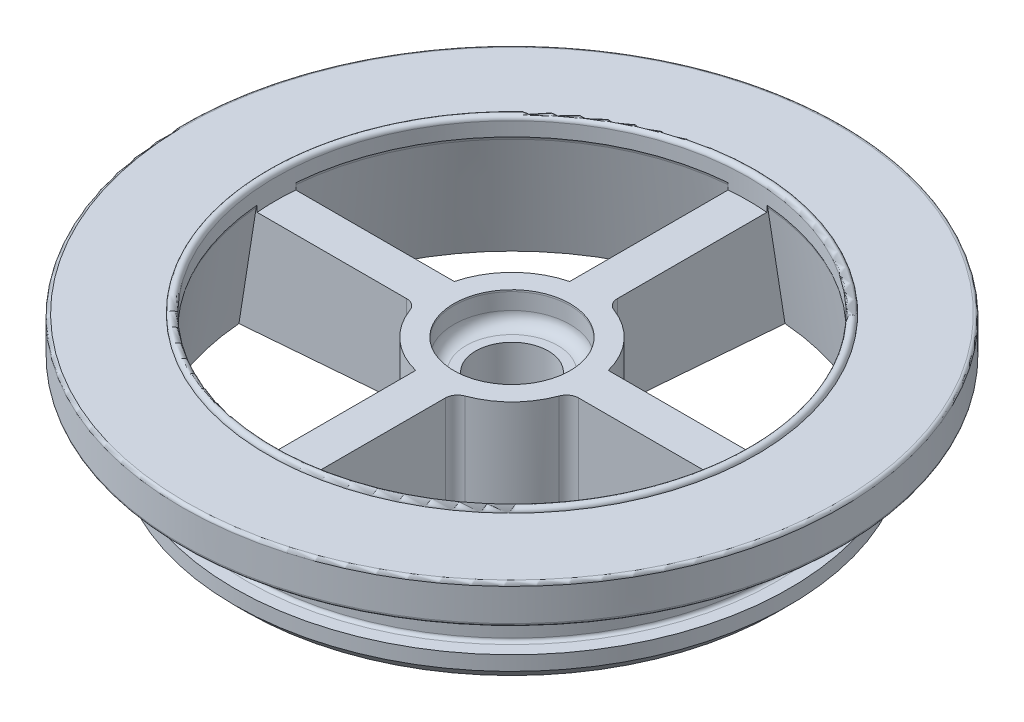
ISO-10303-21;
HEADER;
FILE_DESCRIPTION(('STEP AP214'),'2;1');
FILE_NAME('part.step','',(''),(''),'','','');
FILE_SCHEMA(('AUTOMOTIVE_DESIGN { 1 0 10303 214 1 1 1 1 }'));
ENDSEC;
DATA;
#1=APPLICATION_CONTEXT('core data for automotive mechanical design processes');
#2=APPLICATION_PROTOCOL_DEFINITION('international standard','automotive_design',2000,#1);
#3=PRODUCT_CONTEXT('',#1,'mechanical');
#4=PRODUCT('Part','Part','',(#3));
#5=PRODUCT_RELATED_PRODUCT_CATEGORY('part','',(#4));
#6=PRODUCT_DEFINITION_FORMATION('','',#4);
#7=PRODUCT_DEFINITION_CONTEXT('part definition',#1,'design');
#8=PRODUCT_DEFINITION('design','',#6,#7);
#9=PRODUCT_DEFINITION_SHAPE('','',#8);
#10=(LENGTH_UNIT() NAMED_UNIT(*) SI_UNIT(.MILLI.,.METRE.));
#11=(NAMED_UNIT(*) PLANE_ANGLE_UNIT() SI_UNIT($,.RADIAN.));
#12=(NAMED_UNIT(*) SI_UNIT($,.STERADIAN.) SOLID_ANGLE_UNIT());
#13=UNCERTAINTY_MEASURE_WITH_UNIT(LENGTH_MEASURE(1.E-05),#10,'distance_accuracy_value','');
#14=(GEOMETRIC_REPRESENTATION_CONTEXT(3) GLOBAL_UNCERTAINTY_ASSIGNED_CONTEXT((#13)) GLOBAL_UNIT_ASSIGNED_CONTEXT((#10,
#11,#12)) REPRESENTATION_CONTEXT('',''));
#15=CARTESIAN_POINT('',(0.,0.,0.));
#16=DIRECTION('',(0.,0.,1.));
#17=DIRECTION('',(1.,0.,0.));
#18=AXIS2_PLACEMENT_3D('',#15,#16,#17);
#19=CARTESIAN_POINT('',(0.,-5.21986234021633,0.));
#20=DIRECTION('',(0.,-1.,0.));
#21=DIRECTION('',(0.,0.,-1.));
#22=AXIS2_PLACEMENT_3D('',#19,#20,#21);
#23=CYLINDRICAL_SURFACE('',#22,19.5);
#24=CARTESIAN_POINT('',(0.,55.9,0.));
#25=DIRECTION('',(0.,1.,0.));
#26=DIRECTION('',(0.,0.,1.));
#27=AXIS2_PLACEMENT_3D('',#24,#25,#26);
#28=CIRCLE('',#27,19.5);
#29=CARTESIAN_POINT('',(6.71666666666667,55.9,18.3067306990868));
#30=VERTEX_POINT('',#29);
#31=CARTESIAN_POINT('',(18.3067306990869,55.9,6.7166666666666));
#32=VERTEX_POINT('',#31);
#33=EDGE_CURVE('E289',#30,#32,#28,.T.);
#34=ORIENTED_EDGE('',*,*,#33,.F.);
#35=DIRECTION('',(0.,-1.,0.));
#36=VECTOR('',#35,1.);
#37=CARTESIAN_POINT('',(6.71666666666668,-5.21986234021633,18.3067306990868));
#38=LINE('',#37,#36);
#39=CARTESIAN_POINT('',(6.71666666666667,33.,18.3067306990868));
#40=VERTEX_POINT('',#39);
#41=EDGE_CURVE('E781',#30,#40,#38,.T.);
#42=ORIENTED_EDGE('',*,*,#41,.T.);
#43=CARTESIAN_POINT('',(0.,33.,0.));
#44=DIRECTION('',(0.,-1.,0.));
#45=DIRECTION('',(0.,0.,-1.));
#46=AXIS2_PLACEMENT_3D('',#43,#44,#45);
#47=CIRCLE('',#46,19.5);
#48=CARTESIAN_POINT('',(-4.75,33.,18.9126280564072));
#49=VERTEX_POINT('',#48);
#50=EDGE_CURVE('E895',#40,#49,#47,.T.);
#51=ORIENTED_EDGE('',*,*,#50,.T.);
#52=DIRECTION('',(0.,-1.,0.));
#53=VECTOR('',#52,1.);
#54=CARTESIAN_POINT('',(-4.75000000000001,-5.21986234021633,18.9126280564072));
#55=LINE('',#54,#53);
#56=CARTESIAN_POINT('',(-4.75000000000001,55.9,18.9126280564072));
#57=VERTEX_POINT('',#56);
#58=EDGE_CURVE('E434',#57,#49,#55,.T.);
#59=ORIENTED_EDGE('',*,*,#58,.F.);
#60=CARTESIAN_POINT('',(-18.3067306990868,55.9,6.71666666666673));
#61=VERTEX_POINT('',#60);
#62=EDGE_CURVE('E292',#61,#57,#28,.T.);
#63=ORIENTED_EDGE('',*,*,#62,.F.);
#64=DIRECTION('',(0.,-1.,0.));
#65=VECTOR('',#64,1.);
#66=CARTESIAN_POINT('',(-18.3067306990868,-5.21986234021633,6.71666666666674));
#67=LINE('',#66,#65);
#68=CARTESIAN_POINT('',(-18.3067306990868,33.,6.71666666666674));
#69=VERTEX_POINT('',#68);
#70=EDGE_CURVE('E794',#61,#69,#67,.T.);
#71=ORIENTED_EDGE('',*,*,#70,.T.);
#72=CARTESIAN_POINT('',(-18.9126280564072,33.,-4.7499999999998));
#73=VERTEX_POINT('',#72);
#74=EDGE_CURVE('E312',#69,#73,#47,.T.);
#75=ORIENTED_EDGE('',*,*,#74,.T.);
#76=DIRECTION('',(0.,-1.,0.));
#77=VECTOR('',#76,1.);
#78=CARTESIAN_POINT('',(-18.9126280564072,-5.21986234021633,-4.74999999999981));
#79=LINE('',#78,#77);
#80=CARTESIAN_POINT('',(-18.9126280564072,55.9,-4.74999999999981));
#81=VERTEX_POINT('',#80);
#82=EDGE_CURVE('E426',#81,#73,#79,.T.);
#83=ORIENTED_EDGE('',*,*,#82,.F.);
#84=CARTESIAN_POINT('',(-4.75000000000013,55.9,-18.9126280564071));
#85=VERTEX_POINT('',#84);
#86=EDGE_CURVE('E301',#85,#81,#28,.T.);
#87=ORIENTED_EDGE('',*,*,#86,.F.);
#88=DIRECTION('',(0.,-1.,0.));
#89=VECTOR('',#88,1.);
#90=CARTESIAN_POINT('',(-4.75000000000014,-5.21986234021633,-18.9126280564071));
#91=LINE('',#90,#89);
#92=CARTESIAN_POINT('',(-4.75000000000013,33.,-18.9126280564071));
#93=VERTEX_POINT('',#92);
#94=EDGE_CURVE('E428',#93,#85,#91,.F.);
#95=ORIENTED_EDGE('',*,*,#94,.F.);
#96=CARTESIAN_POINT('',(6.71666666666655,33.,-18.3067306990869));
#97=VERTEX_POINT('',#96);
#98=EDGE_CURVE('E310',#93,#97,#47,.T.);
#99=ORIENTED_EDGE('',*,*,#98,.T.);
#100=DIRECTION('',(0.,-1.,0.));
#101=VECTOR('',#100,1.);
#102=CARTESIAN_POINT('',(6.71666666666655,-5.21986234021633,-18.3067306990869));
#103=LINE('',#102,#101);
#104=CARTESIAN_POINT('',(6.71666666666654,55.9,-18.3067306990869));
#105=VERTEX_POINT('',#104);
#106=EDGE_CURVE('E788',#97,#105,#103,.F.);
#107=ORIENTED_EDGE('',*,*,#106,.T.);
#108=CARTESIAN_POINT('',(18.9126280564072,55.9,-4.75000000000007));
#109=VERTEX_POINT('',#108);
#110=EDGE_CURVE('E293',#109,#105,#28,.T.);
#111=ORIENTED_EDGE('',*,*,#110,.F.);
#112=DIRECTION('',(0.,-1.,0.));
#113=VECTOR('',#112,1.);
#114=CARTESIAN_POINT('',(18.9126280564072,-5.21986234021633,-4.75000000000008));
#115=LINE('',#114,#113);
#116=CARTESIAN_POINT('',(18.9126280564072,33.,-4.75000000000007));
#117=VERTEX_POINT('',#116);
#118=EDGE_CURVE('E431',#117,#109,#115,.F.);
#119=ORIENTED_EDGE('',*,*,#118,.F.);
#120=CARTESIAN_POINT('',(18.3067306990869,33.,6.71666666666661));
#121=VERTEX_POINT('',#120);
#122=EDGE_CURVE('E313',#117,#121,#47,.T.);
#123=ORIENTED_EDGE('',*,*,#122,.T.);
#124=DIRECTION('',(0.,-1.,0.));
#125=VECTOR('',#124,1.);
#126=CARTESIAN_POINT('',(18.3067306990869,-5.21986234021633,6.71666666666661));
#127=LINE('',#126,#125);
#128=EDGE_CURVE('E802',#121,#32,#127,.F.);
#129=ORIENTED_EDGE('',*,*,#128,.T.);
#130=EDGE_LOOP('',(#34,#42,#51,#59,#63,#71,#75,#83,#87,#95,#99,#107,#111,#119,#123,#129));
#131=FACE_BOUND('',#130,.T.);
#132=CARTESIAN_POINT('',(0.,32.7,0.));
#133=DIRECTION('',(0.,-1.,0.));
#134=DIRECTION('',(0.,0.,-1.));
#135=AXIS2_PLACEMENT_3D('',#132,#133,#134);
#136=CIRCLE('',#135,19.5);
#137=CARTESIAN_POINT('',(0.,32.7,-19.5));
#138=VERTEX_POINT('',#137);
#139=EDGE_CURVE('E266',#138,#138,#136,.T.);
#140=ORIENTED_EDGE('',*,*,#139,.F.);
#141=EDGE_LOOP('',(#140));
#142=FACE_BOUND('',#141,.T.);
#143=ADVANCED_FACE('F42',(#131,#142),#23,.T.);
#144=CARTESIAN_POINT('',(-58.05,55.9,0.));
#145=DIRECTION('',(0.,1.,0.));
#146=DIRECTION('',(0.,0.,1.));
#147=AXIS2_PLACEMENT_3D('',#144,#145,#146);
#148=PLANE('',#147);
#149=CARTESIAN_POINT('',(0.,55.9,0.));
#150=DIRECTION('',(0.,-1.,0.));
#151=DIRECTION('',(0.,0.,-1.));
#152=AXIS2_PLACEMENT_3D('',#149,#150,#151);
#153=CIRCLE('',#152,14.2767862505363);
#154=CARTESIAN_POINT('',(0.,55.9,-14.2767862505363));
#155=VERTEX_POINT('',#154);
#156=EDGE_CURVE('E284',#155,#155,#153,.F.);
#157=ORIENTED_EDGE('',*,*,#156,.F.);
#158=EDGE_LOOP('',(#157));
#159=FACE_BOUND('',#158,.T.);
#160=DIRECTION('',(0.,0.,1.));
#161=VECTOR('',#160,1.);
#162=CARTESIAN_POINT('',(-4.75,55.9,63.5));
#163=LINE('',#162,#161);
#164=CARTESIAN_POINT('',(-4.75,55.9,57.8553368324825));
#165=VERTEX_POINT('',#164);
#166=EDGE_CURVE('E308',#57,#165,#163,.T.);
#167=ORIENTED_EDGE('',*,*,#166,.T.);
#168=CARTESIAN_POINT('',(0.,55.9,0.));
#169=DIRECTION('',(0.,-1.,0.));
#170=DIRECTION('',(0.,0.,-1.));
#171=AXIS2_PLACEMENT_3D('',#168,#169,#170);
#172=CIRCLE('',#171,58.05);
#173=CARTESIAN_POINT('',(4.75,55.9,57.8553368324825));
#174=VERTEX_POINT('',#173);
#175=EDGE_CURVE('E1371',#174,#165,#172,.T.);
#176=ORIENTED_EDGE('',*,*,#175,.F.);
#177=DIRECTION('',(0.,0.,-1.));
#178=VECTOR('',#177,1.);
#179=CARTESIAN_POINT('',(4.75,55.9,63.5));
#180=LINE('',#179,#178);
#181=CARTESIAN_POINT('',(4.75000000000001,55.9,21.1231508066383));
#182=VERTEX_POINT('',#181);
#183=EDGE_CURVE('E295',#174,#182,#180,.T.);
#184=ORIENTED_EDGE('',*,*,#183,.T.);
#185=CARTESIAN_POINT('',(7.75000000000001,55.9,21.1231508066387));
#186=DIRECTION('',(0.,1.,0.));
#187=DIRECTION('',(0.,0.,1.));
#188=AXIS2_PLACEMENT_3D('',#185,#186,#187);
#189=CIRCLE('',#188,3.);
#190=EDGE_CURVE('E291',#182,#30,#189,.F.);
#191=ORIENTED_EDGE('',*,*,#190,.T.);
#192=ORIENTED_EDGE('',*,*,#33,.T.);
#193=CARTESIAN_POINT('',(21.1231508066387,55.9,7.74999999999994));
#194=DIRECTION('',(0.,1.,0.));
#195=DIRECTION('',(0.,0.,1.));
#196=AXIS2_PLACEMENT_3D('',#193,#194,#195);
#197=CIRCLE('',#196,3.);
#198=CARTESIAN_POINT('',(21.1231508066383,55.9,4.74999999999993));
#199=VERTEX_POINT('',#198);
#200=EDGE_CURVE('E287',#32,#199,#197,.F.);
#201=ORIENTED_EDGE('',*,*,#200,.T.);
#202=DIRECTION('',(1.,0.,0.));
#203=VECTOR('',#202,1.);
#204=CARTESIAN_POINT('',(63.5,55.9,4.74999999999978));
#205=LINE('',#204,#203);
#206=CARTESIAN_POINT('',(57.8553368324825,55.9,4.7499999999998));
#207=VERTEX_POINT('',#206);
#208=EDGE_CURVE('E285',#199,#207,#205,.T.);
#209=ORIENTED_EDGE('',*,*,#208,.T.);
#210=CARTESIAN_POINT('',(57.8553368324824,55.9,-4.7500000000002));
#211=VERTEX_POINT('',#210);
#212=EDGE_CURVE('E268',#211,#207,#172,.T.);
#213=ORIENTED_EDGE('',*,*,#212,.F.);
#214=DIRECTION('',(-1.,0.,0.));
#215=VECTOR('',#214,1.);
#216=CARTESIAN_POINT('',(63.5,55.9,-4.75000000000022));
#217=LINE('',#216,#215);
#218=EDGE_CURVE('E297',#211,#109,#217,.T.);
#219=ORIENTED_EDGE('',*,*,#218,.T.);
#220=ORIENTED_EDGE('',*,*,#110,.T.);
#221=CARTESIAN_POINT('',(7.74999999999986,55.9,-21.1231508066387));
#222=DIRECTION('',(0.,1.,0.));
#223=DIRECTION('',(0.,0.,1.));
#224=AXIS2_PLACEMENT_3D('',#221,#222,#223);
#225=CIRCLE('',#224,3.);
#226=CARTESIAN_POINT('',(4.74999999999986,55.9,-21.1231508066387));
#227=VERTEX_POINT('',#226);
#228=EDGE_CURVE('E257',#105,#227,#225,.F.);
#229=ORIENTED_EDGE('',*,*,#228,.T.);
#230=DIRECTION('',(0.,0.,-1.));
#231=VECTOR('',#230,1.);
#232=CARTESIAN_POINT('',(4.74999999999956,55.9,-63.5));
#233=LINE('',#232,#231);
#234=CARTESIAN_POINT('',(4.74999999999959,55.9,-57.8553368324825));
#235=VERTEX_POINT('',#234);
#236=EDGE_CURVE('E252',#227,#235,#233,.T.);
#237=ORIENTED_EDGE('',*,*,#236,.T.);
#238=CARTESIAN_POINT('',(-4.7500000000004,55.9,-57.8553368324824));
#239=VERTEX_POINT('',#238);
#240=EDGE_CURVE('E254',#239,#235,#172,.T.);
#241=ORIENTED_EDGE('',*,*,#240,.F.);
#242=DIRECTION('',(0.,0.,1.));
#243=VECTOR('',#242,1.);
#244=CARTESIAN_POINT('',(-4.75000000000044,55.9,-63.5));
#245=LINE('',#244,#243);
#246=EDGE_CURVE('E260',#239,#85,#245,.T.);
#247=ORIENTED_EDGE('',*,*,#246,.T.);
#248=ORIENTED_EDGE('',*,*,#86,.T.);
#249=DIRECTION('',(-1.,0.,0.));
#250=VECTOR('',#249,1.);
#251=CARTESIAN_POINT('',(-63.5000000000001,55.9,-4.74999999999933));
#252=LINE('',#251,#250);
#253=CARTESIAN_POINT('',(-57.8553368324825,55.9,-4.74999999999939));
#254=VERTEX_POINT('',#253);
#255=EDGE_CURVE('E302',#81,#254,#252,.T.);
#256=ORIENTED_EDGE('',*,*,#255,.T.);
#257=CARTESIAN_POINT('',(-57.8553368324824,55.9,4.7500000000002));
#258=VERTEX_POINT('',#257);
#259=EDGE_CURVE('E265',#258,#254,#172,.T.);
#260=ORIENTED_EDGE('',*,*,#259,.F.);
#261=DIRECTION('',(1.,0.,0.));
#262=VECTOR('',#261,1.);
#263=CARTESIAN_POINT('',(63.5,55.9,4.74999999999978));
#264=LINE('',#263,#262);
#265=CARTESIAN_POINT('',(-21.1231508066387,55.9,4.75000000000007));
#266=VERTEX_POINT('',#265);
#267=EDGE_CURVE('E304',#258,#266,#264,.T.);
#268=ORIENTED_EDGE('',*,*,#267,.T.);
#269=CARTESIAN_POINT('',(-21.1231508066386,55.9,7.75000000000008));
#270=DIRECTION('',(0.,1.,0.));
#271=DIRECTION('',(0.,0.,1.));
#272=AXIS2_PLACEMENT_3D('',#269,#270,#271);
#273=CIRCLE('',#272,3.);
#274=EDGE_CURVE('E306',#266,#61,#273,.F.);
#275=ORIENTED_EDGE('',*,*,#274,.T.);
#276=ORIENTED_EDGE('',*,*,#62,.T.);
#277=EDGE_LOOP('',(#167,#176,#184,#191,#192,#201,#209,#213,#219,#220,#229,#237,#241,#247,#248,
#256,#260,#268,#275,#276));
#278=FACE_BOUND('',#277,.T.);
#279=ADVANCED_FACE('F253',(#159,#278),#148,.T.);
#280=CARTESIAN_POINT('',(0.,-3.48599695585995,0.));
#281=DIRECTION('',(0.,-1.,0.));
#282=DIRECTION('',(0.,0.,-1.));
#283=AXIS2_PLACEMENT_3D('',#280,#281,#282);
#284=CYLINDRICAL_SURFACE('',#283,58.05);
#285=CARTESIAN_POINT('',(0.,60.9,0.));
#286=DIRECTION('',(0.,-1.,0.));
#287=DIRECTION('',(0.,0.,-1.));
#288=AXIS2_PLACEMENT_3D('',#285,#286,#287);
#289=CIRCLE('',#288,58.05);
#290=CARTESIAN_POINT('',(0.,60.9,-58.05));
#291=VERTEX_POINT('',#290);
#292=EDGE_CURVE('E701',#291,#291,#289,.T.);
#293=ORIENTED_EDGE('',*,*,#292,.F.);
#294=EDGE_LOOP('',(#293));
#295=FACE_BOUND('',#294,.T.);
#296=DIRECTION('',(0.,-1.,0.));
#297=VECTOR('',#296,1.);
#298=CARTESIAN_POINT('',(-57.8553368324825,-3.48599695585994,-4.7499999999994));
#299=LINE('',#298,#297);
#300=CARTESIAN_POINT('',(-57.8553368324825,57.4518203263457,-4.74999999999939));
#301=VERTEX_POINT('',#300);
#302=EDGE_CURVE('E57',#254,#301,#299,.F.);
#303=ORIENTED_EDGE('',*,*,#302,.T.);
#304=CARTESIAN_POINT('',(0.,57.4518203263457,0.));
#305=DIRECTION('',(0.,-1.,0.));
#306=DIRECTION('',(0.,0.,-1.));
#307=AXIS2_PLACEMENT_3D('',#304,#305,#306);
#308=CIRCLE('',#307,58.05);
#309=CARTESIAN_POINT('',(-4.7500000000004,57.4518203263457,-57.8553368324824));
#310=VERTEX_POINT('',#309);
#311=EDGE_CURVE('E274',#301,#310,#308,.T.);
#312=ORIENTED_EDGE('',*,*,#311,.T.);
#313=DIRECTION('',(0.,-1.,0.));
#314=VECTOR('',#313,1.);
#315=CARTESIAN_POINT('',(-4.75000000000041,-3.48599695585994,-57.8553368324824));
#316=LINE('',#315,#314);
#317=EDGE_CURVE('E264',#310,#239,#316,.T.);
#318=ORIENTED_EDGE('',*,*,#317,.T.);
#319=ORIENTED_EDGE('',*,*,#240,.T.);
#320=DIRECTION('',(0.,-1.,0.));
#321=VECTOR('',#320,1.);
#322=CARTESIAN_POINT('',(4.74999999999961,-3.48599695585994,-57.8553368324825));
#323=LINE('',#322,#321);
#324=CARTESIAN_POINT('',(4.74999999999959,57.4518203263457,-57.8553368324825));
#325=VERTEX_POINT('',#324);
#326=EDGE_CURVE('E64',#235,#325,#323,.F.);
#327=ORIENTED_EDGE('',*,*,#326,.T.);
#328=CARTESIAN_POINT('',(0.,57.4518203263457,0.));
#329=DIRECTION('',(0.,-1.,0.));
#330=DIRECTION('',(0.,0.,-1.));
#331=AXIS2_PLACEMENT_3D('',#328,#329,#330);
#332=CIRCLE('',#331,58.05);
#333=CARTESIAN_POINT('',(57.8553368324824,57.4518203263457,-4.7500000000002));
#334=VERTEX_POINT('',#333);
#335=EDGE_CURVE('E278',#325,#334,#332,.T.);
#336=ORIENTED_EDGE('',*,*,#335,.T.);
#337=DIRECTION('',(0.,-1.,0.));
#338=VECTOR('',#337,1.);
#339=CARTESIAN_POINT('',(57.8553368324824,-3.48599695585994,-4.75000000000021));
#340=LINE('',#339,#338);
#341=EDGE_CURVE('E275',#334,#211,#340,.T.);
#342=ORIENTED_EDGE('',*,*,#341,.T.);
#343=ORIENTED_EDGE('',*,*,#212,.T.);
#344=DIRECTION('',(0.,-1.,0.));
#345=VECTOR('',#344,1.);
#346=CARTESIAN_POINT('',(57.8553368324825,-3.48599695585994,4.74999999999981));
#347=LINE('',#346,#345);
#348=CARTESIAN_POINT('',(57.8553368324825,57.4518203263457,4.7499999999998));
#349=VERTEX_POINT('',#348);
#350=EDGE_CURVE('E719',#207,#349,#347,.F.);
#351=ORIENTED_EDGE('',*,*,#350,.T.);
#352=CARTESIAN_POINT('',(0.,57.4518203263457,0.));
#353=DIRECTION('',(0.,-1.,0.));
#354=DIRECTION('',(0.,0.,-1.));
#355=AXIS2_PLACEMENT_3D('',#352,#353,#354);
#356=CIRCLE('',#355,58.05);
#357=CARTESIAN_POINT('',(4.75,57.4518203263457,57.8553368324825));
#358=VERTEX_POINT('',#357);
#359=EDGE_CURVE('E568',#349,#358,#356,.T.);
#360=ORIENTED_EDGE('',*,*,#359,.T.);
#361=DIRECTION('',(0.,-1.,0.));
#362=VECTOR('',#361,1.);
#363=CARTESIAN_POINT('',(4.75000000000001,-3.48599695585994,57.8553368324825));
#364=LINE('',#363,#362);
#365=EDGE_CURVE('E721',#358,#174,#364,.T.);
#366=ORIENTED_EDGE('',*,*,#365,.T.);
#367=ORIENTED_EDGE('',*,*,#175,.T.);
#368=DIRECTION('',(0.,-1.,0.));
#369=VECTOR('',#368,1.);
#370=CARTESIAN_POINT('',(-4.75000000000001,-3.48599695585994,57.8553368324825));
#371=LINE('',#370,#369);
#372=CARTESIAN_POINT('',(-4.75,57.4518203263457,57.8553368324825));
#373=VERTEX_POINT('',#372);
#374=EDGE_CURVE('E727',#165,#373,#371,.F.);
#375=ORIENTED_EDGE('',*,*,#374,.T.);
#376=CARTESIAN_POINT('',(0.,57.4518203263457,0.));
#377=DIRECTION('',(0.,-1.,0.));
#378=DIRECTION('',(0.,0.,-1.));
#379=AXIS2_PLACEMENT_3D('',#376,#377,#378);
#380=CIRCLE('',#379,58.05);
#381=CARTESIAN_POINT('',(-57.8553368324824,57.4518203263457,4.7500000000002));
#382=VERTEX_POINT('',#381);
#383=EDGE_CURVE('E723',#373,#382,#380,.T.);
#384=ORIENTED_EDGE('',*,*,#383,.T.);
#385=DIRECTION('',(0.,-1.,0.));
#386=VECTOR('',#385,1.);
#387=CARTESIAN_POINT('',(-57.8553368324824,-3.48599695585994,4.75000000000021));
#388=LINE('',#387,#386);
#389=EDGE_CURVE('E725',#382,#258,#388,.T.);
#390=ORIENTED_EDGE('',*,*,#389,.T.);
#391=ORIENTED_EDGE('',*,*,#259,.T.);
#392=EDGE_LOOP('',(#303,#312,#318,#319,#327,#336,#342,#343,#351,#360,#366,#367,#375,#384,#390,#391));
#393=FACE_BOUND('',#392,.T.);
#394=ADVANCED_FACE('F262',(#295,#393),#284,.F.);
#395=CARTESIAN_POINT('',(0.,30.,0.));
#396=DIRECTION('',(0.,1.,0.));
#397=DIRECTION('',(0.,0.,1.));
#398=AXIS2_PLACEMENT_3D('',#395,#396,#397);
#399=CONICAL_SURFACE('',#398,65.2,0.785398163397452);
#400=CARTESIAN_POINT('',(0.,33.,0.));
#401=DIRECTION('',(0.,-1.,0.));
#402=DIRECTION('',(0.,0.,-1.));
#403=AXIS2_PLACEMENT_3D('',#400,#401,#402);
#404=CIRCLE('',#403,68.2);
#405=CARTESIAN_POINT('',(0.,33.,-68.2));
#406=VERTEX_POINT('',#405);
#407=EDGE_CURVE('E713',#406,#406,#404,.T.);
#408=ORIENTED_EDGE('',*,*,#407,.T.);
#409=EDGE_LOOP('',(#408));
#410=FACE_BOUND('',#409,.T.);
#411=CARTESIAN_POINT('',(0.,30.,0.));
#412=DIRECTION('',(0.,-1.,0.));
#413=DIRECTION('',(0.,0.,-1.));
#414=AXIS2_PLACEMENT_3D('',#411,#412,#413);
#415=CIRCLE('',#414,65.2);
#416=CARTESIAN_POINT('',(0.,30.,-65.2));
#417=VERTEX_POINT('',#416);
#418=EDGE_CURVE('E716',#417,#417,#415,.T.);
#419=ORIENTED_EDGE('',*,*,#418,.F.);
#420=EDGE_LOOP('',(#419));
#421=FACE_BOUND('',#420,.T.);
#422=ADVANCED_FACE('F649',(#410,#421),#399,.T.);
#423=CARTESIAN_POINT('',(0.,-3.48599695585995,0.));
#424=DIRECTION('',(0.,-1.,0.));
#425=DIRECTION('',(0.,0.,-1.));
#426=AXIS2_PLACEMENT_3D('',#423,#424,#425);
#427=CYLINDRICAL_SURFACE('',#426,68.2);
#428=CARTESIAN_POINT('',(0.,36.55,0.));
#429=DIRECTION('',(0.,-1.,0.));
#430=DIRECTION('',(0.,0.,-1.));
#431=AXIS2_PLACEMENT_3D('',#428,#429,#430);
#432=CIRCLE('',#431,68.2);
#433=CARTESIAN_POINT('',(0.,36.55,-68.2));
#434=VERTEX_POINT('',#433);
#435=EDGE_CURVE('E710',#434,#434,#432,.T.);
#436=ORIENTED_EDGE('',*,*,#435,.T.);
#437=EDGE_LOOP('',(#436));
#438=FACE_BOUND('',#437,.T.);
#439=ORIENTED_EDGE('',*,*,#407,.F.);
#440=EDGE_LOOP('',(#439));
#441=FACE_BOUND('',#440,.T.);
#442=ADVANCED_FACE('F681',(#438,#441),#427,.T.);
#443=CARTESIAN_POINT('',(-64.35,36.55,0.));
#444=DIRECTION('',(0.,1.,0.));
#445=DIRECTION('',(0.,0.,1.));
#446=AXIS2_PLACEMENT_3D('',#443,#444,#445);
#447=PLANE('',#446);
#448=CARTESIAN_POINT('',(0.,36.55,0.));
#449=DIRECTION('',(0.,1.,0.));
#450=DIRECTION('',(0.,0.,1.));
#451=AXIS2_PLACEMENT_3D('',#448,#449,#450);
#452=CIRCLE('',#451,65.15);
#453=CARTESIAN_POINT('',(0.,36.55,65.15));
#454=VERTEX_POINT('',#453);
#455=EDGE_CURVE('E582',#454,#454,#452,.F.);
#456=ORIENTED_EDGE('',*,*,#455,.T.);
#457=EDGE_LOOP('',(#456));
#458=FACE_BOUND('',#457,.T.);
#459=ORIENTED_EDGE('',*,*,#435,.F.);
#460=EDGE_LOOP('',(#459));
#461=FACE_BOUND('',#460,.T.);
#462=ADVANCED_FACE('F677',(#458,#461),#447,.T.);
#463=CARTESIAN_POINT('',(0.,-3.48599695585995,0.));
#464=DIRECTION('',(0.,-1.,0.));
#465=DIRECTION('',(0.,0.,-1.));
#466=AXIS2_PLACEMENT_3D('',#463,#464,#465);
#467=CYLINDRICAL_SURFACE('',#466,64.35);
#468=CARTESIAN_POINT('',(0.,37.35,0.));
#469=DIRECTION('',(0.,1.,0.));
#470=DIRECTION('',(0.,0.,1.));
#471=AXIS2_PLACEMENT_3D('',#468,#469,#470);
#472=CIRCLE('',#471,64.35);
#473=CARTESIAN_POINT('',(0.,37.35,64.35));
#474=VERTEX_POINT('',#473);
#475=EDGE_CURVE('E588',#474,#474,#472,.T.);
#476=ORIENTED_EDGE('',*,*,#475,.T.);
#477=EDGE_LOOP('',(#476));
#478=FACE_BOUND('',#477,.T.);
#479=CARTESIAN_POINT('',(0.,42.1,0.));
#480=DIRECTION('',(0.,-1.,0.));
#481=DIRECTION('',(0.,0.,-1.));
#482=AXIS2_PLACEMENT_3D('',#479,#480,#481);
#483=CIRCLE('',#482,64.35);
#484=CARTESIAN_POINT('',(0.,42.1,-64.35));
#485=VERTEX_POINT('',#484);
#486=EDGE_CURVE('E585',#485,#485,#483,.T.);
#487=ORIENTED_EDGE('',*,*,#486,.T.);
#488=EDGE_LOOP('',(#487));
#489=FACE_BOUND('',#488,.T.);
#490=ADVANCED_FACE('F673',(#478,#489),#467,.T.);
#491=CARTESIAN_POINT('',(-68.2,42.9,0.));
#492=DIRECTION('',(0.,-1.,0.));
#493=DIRECTION('',(0.,0.,-1.));
#494=AXIS2_PLACEMENT_3D('',#491,#492,#493);
#495=PLANE('',#494);
#496=CARTESIAN_POINT('',(0.,42.9,0.));
#497=DIRECTION('',(0.,-1.,0.));
#498=DIRECTION('',(0.,0.,-1.));
#499=AXIS2_PLACEMENT_3D('',#496,#497,#498);
#500=CIRCLE('',#499,65.15);
#501=CARTESIAN_POINT('',(0.,42.9,-65.15));
#502=VERTEX_POINT('',#501);
#503=EDGE_CURVE('E591',#502,#502,#500,.F.);
#504=ORIENTED_EDGE('',*,*,#503,.T.);
#505=EDGE_LOOP('',(#504));
#506=FACE_BOUND('',#505,.T.);
#507=CARTESIAN_POINT('',(0.,42.9,0.));
#508=DIRECTION('',(0.,-1.,0.));
#509=DIRECTION('',(0.,0.,-1.));
#510=AXIS2_PLACEMENT_3D('',#507,#508,#509);
#511=CIRCLE('',#510,68.2);
#512=CARTESIAN_POINT('',(0.,42.9,-68.2));
#513=VERTEX_POINT('',#512);
#514=EDGE_CURVE('E707',#513,#513,#511,.T.);
#515=ORIENTED_EDGE('',*,*,#514,.T.);
#516=EDGE_LOOP('',(#515));
#517=FACE_BOUND('',#516,.T.);
#518=ADVANCED_FACE('F669',(#506,#517),#495,.T.);
#519=CARTESIAN_POINT('',(0.,-3.48599695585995,0.));
#520=DIRECTION('',(0.,-1.,0.));
#521=DIRECTION('',(0.,0.,-1.));
#522=AXIS2_PLACEMENT_3D('',#519,#520,#521);
#523=CYLINDRICAL_SURFACE('',#522,68.2);
#524=CARTESIAN_POINT('',(0.,49.9,0.));
#525=DIRECTION('',(0.,-1.,0.));
#526=DIRECTION('',(0.,0.,-1.));
#527=AXIS2_PLACEMENT_3D('',#524,#525,#526);
#528=CIRCLE('',#527,68.2);
#529=CARTESIAN_POINT('',(0.,49.9,-68.2));
#530=VERTEX_POINT('',#529);
#531=EDGE_CURVE('E594',#530,#530,#528,.T.);
#532=ORIENTED_EDGE('',*,*,#531,.T.);
#533=EDGE_LOOP('',(#532));
#534=FACE_BOUND('',#533,.T.);
#535=ORIENTED_EDGE('',*,*,#514,.F.);
#536=EDGE_LOOP('',(#535));
#537=FACE_BOUND('',#536,.T.);
#538=ADVANCED_FACE('F665',(#534,#537),#523,.T.);
#539=CARTESIAN_POINT('',(-80.95,51.4,0.));
#540=DIRECTION('',(0.,-1.,0.));
#541=DIRECTION('',(0.,0.,-1.));
#542=AXIS2_PLACEMENT_3D('',#539,#540,#541);
#543=PLANE('',#542);
#544=CARTESIAN_POINT('',(0.,51.4,0.));
#545=DIRECTION('',(0.,-1.,0.));
#546=DIRECTION('',(0.,0.,-1.));
#547=AXIS2_PLACEMENT_3D('',#544,#545,#546);
#548=CIRCLE('',#547,69.7);
#549=CARTESIAN_POINT('',(0.,51.4,-69.7));
#550=VERTEX_POINT('',#549);
#551=EDGE_CURVE('E597',#550,#550,#548,.F.);
#552=ORIENTED_EDGE('',*,*,#551,.T.);
#553=EDGE_LOOP('',(#552));
#554=FACE_BOUND('',#553,.T.);
#555=CARTESIAN_POINT('',(0.,51.4,0.));
#556=DIRECTION('',(0.,-1.,0.));
#557=DIRECTION('',(0.,0.,-1.));
#558=AXIS2_PLACEMENT_3D('',#555,#556,#557);
#559=CIRCLE('',#558,80.15);
#560=CARTESIAN_POINT('',(0.,51.4,-80.15));
#561=VERTEX_POINT('',#560);
#562=EDGE_CURVE('E579',#561,#561,#559,.T.);
#563=ORIENTED_EDGE('',*,*,#562,.T.);
#564=EDGE_LOOP('',(#563));
#565=FACE_BOUND('',#564,.T.);
#566=ADVANCED_FACE('F661',(#554,#565),#543,.T.);
#567=CARTESIAN_POINT('',(0.,-3.48599695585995,0.));
#568=DIRECTION('',(0.,-1.,0.));
#569=DIRECTION('',(0.,0.,-1.));
#570=AXIS2_PLACEMENT_3D('',#567,#568,#569);
#571=CYLINDRICAL_SURFACE('',#570,80.95);
#572=CARTESIAN_POINT('',(0.,60.1,0.));
#573=DIRECTION('',(0.,1.,0.));
#574=DIRECTION('',(0.,0.,1.));
#575=AXIS2_PLACEMENT_3D('',#572,#573,#574);
#576=CIRCLE('',#575,80.95);
#577=CARTESIAN_POINT('',(0.,60.1,80.95));
#578=VERTEX_POINT('',#577);
#579=EDGE_CURVE('E573',#578,#578,#576,.F.);
#580=ORIENTED_EDGE('',*,*,#579,.T.);
#581=EDGE_LOOP('',(#580));
#582=FACE_BOUND('',#581,.T.);
#583=CARTESIAN_POINT('',(0.,52.2,0.));
#584=DIRECTION('',(0.,-1.,0.));
#585=DIRECTION('',(0.,0.,-1.));
#586=AXIS2_PLACEMENT_3D('',#583,#584,#585);
#587=CIRCLE('',#586,80.95);
#588=CARTESIAN_POINT('',(0.,52.2,-80.95));
#589=VERTEX_POINT('',#588);
#590=EDGE_CURVE('E570',#589,#589,#587,.F.);
#591=ORIENTED_EDGE('',*,*,#590,.T.);
#592=EDGE_LOOP('',(#591));
#593=FACE_BOUND('',#592,.T.);
#594=ADVANCED_FACE('F657',(#582,#593),#571,.T.);
#595=CARTESIAN_POINT('',(-60.05,60.9,0.));
#596=DIRECTION('',(0.,1.,0.));
#597=DIRECTION('',(0.,0.,1.));
#598=AXIS2_PLACEMENT_3D('',#595,#596,#597);
#599=PLANE('',#598);
#600=CARTESIAN_POINT('',(0.,60.9,0.));
#601=DIRECTION('',(0.,1.,0.));
#602=DIRECTION('',(0.,0.,1.));
#603=AXIS2_PLACEMENT_3D('',#600,#601,#602);
#604=CIRCLE('',#603,80.15);
#605=CARTESIAN_POINT('',(0.,60.9,80.15));
#606=VERTEX_POINT('',#605);
#607=EDGE_CURVE('E576',#606,#606,#604,.T.);
#608=ORIENTED_EDGE('',*,*,#607,.T.);
#609=EDGE_LOOP('',(#608));
#610=FACE_BOUND('',#609,.T.);
#611=CARTESIAN_POINT('',(0.,60.9,0.));
#612=DIRECTION('',(0.,-1.,0.));
#613=DIRECTION('',(0.,0.,-1.));
#614=AXIS2_PLACEMENT_3D('',#611,#612,#613);
#615=CIRCLE('',#614,60.05);
#616=CARTESIAN_POINT('',(0.,60.9,-60.05));
#617=VERTEX_POINT('',#616);
#618=EDGE_CURVE('E704',#617,#617,#615,.T.);
#619=ORIENTED_EDGE('',*,*,#618,.T.);
#620=EDGE_LOOP('',(#619));
#621=FACE_BOUND('',#620,.T.);
#622=ADVANCED_FACE('F653',(#610,#621),#599,.T.);
#623=CARTESIAN_POINT('',(0.,60.9,0.));
#624=DIRECTION('',(0.,-1.,0.));
#625=DIRECTION('',(0.,0.,-1.));
#626=AXIS2_PLACEMENT_3D('',#623,#624,#625);
#627=TOROIDAL_SURFACE('',#626,59.05,1.);
#628=ORIENTED_EDGE('',*,*,#292,.T.);
#629=EDGE_LOOP('',(#628));
#630=FACE_BOUND('',#629,.T.);
#631=ORIENTED_EDGE('',*,*,#618,.F.);
#632=EDGE_LOOP('',(#631));
#633=FACE_BOUND('',#632,.T.);
#634=ADVANCED_FACE('F346',(#630,#633),#627,.T.);
#635=CARTESIAN_POINT('',(0.,30.,0.));
#636=DIRECTION('',(0.,-1.,0.));
#637=DIRECTION('',(0.,0.,-1.));
#638=AXIS2_PLACEMENT_3D('',#635,#636,#637);
#639=CONICAL_SURFACE('',#638,62.5,1.49303138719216);
#640=CARTESIAN_POINT('',(0.,30.,0.));
#641=DIRECTION('',(0.,-1.,0.));
#642=DIRECTION('',(0.,0.,-1.));
#643=AXIS2_PLACEMENT_3D('',#640,#641,#642);
#644=CIRCLE('',#643,62.5);
#645=CARTESIAN_POINT('',(4.75,30.,62.3192386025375));
#646=VERTEX_POINT('',#645);
#647=CARTESIAN_POINT('',(-4.75,30.,62.3192386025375));
#648=VERTEX_POINT('',#647);
#649=EDGE_CURVE('E840',#646,#648,#644,.T.);
#650=ORIENTED_EDGE('',*,*,#649,.T.);
#651=CARTESIAN_POINT('',(-4.75,34.0828099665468,-8.9177956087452));
#652=CARTESIAN_POINT('',(-4.75,34.1117410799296,-8.49661736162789));
#653=CARTESIAN_POINT('',(-4.75,34.1402872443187,-8.07541108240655));
#654=CARTESIAN_POINT('',(-4.75,34.1960883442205,-7.23291184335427));
#655=CARTESIAN_POINT('',(-4.75,34.2233432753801,-6.81161888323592));
#656=CARTESIAN_POINT('',(-4.75,34.276051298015,-5.9687438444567));
#657=CARTESIAN_POINT('',(-4.75,34.3015036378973,-5.54716171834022));
#658=CARTESIAN_POINT('',(-4.75,34.349705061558,-4.70383380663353));
#659=CARTESIAN_POINT('',(-4.75,34.3724541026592,-4.282088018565));
#660=CARTESIAN_POINT('',(-4.75,34.4138856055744,-3.43904668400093));
#661=CARTESIAN_POINT('',(-4.75,34.4325743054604,-3.01775145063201));
#662=CARTESIAN_POINT('',(-4.75,34.4640585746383,-2.17494248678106));
#663=CARTESIAN_POINT('',(-4.75,34.4768543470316,-1.75342876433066));
#664=CARTESIAN_POINT('',(-4.75,34.4901608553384,-1.12108997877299));
#665=CARTESIAN_POINT('',(-4.75,34.4936151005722,-0.910326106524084));
#666=CARTESIAN_POINT('',(-4.75,34.4984000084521,-0.488774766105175));
#667=CARTESIAN_POINT('',(-4.75,34.4997306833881,-0.277987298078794));
#668=CARTESIAN_POINT('',(-4.75,34.5001952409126,0.143588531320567));
#669=CARTESIAN_POINT('',(-4.75,34.4993291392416,0.354376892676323));
#670=CARTESIAN_POINT('',(-4.75,34.4954496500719,0.775930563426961));
#671=CARTESIAN_POINT('',(-4.75,34.4924362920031,0.986695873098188));
#672=CARTESIAN_POINT('',(-4.75,34.4723755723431,2.03936444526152));
#673=CARTESIAN_POINT('',(-4.75,34.4403261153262,2.88097968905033));
#674=CARTESIAN_POINT('',(-4.75,34.3796831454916,4.14275324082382));
#675=CARTESIAN_POINT('',(-4.75,34.3573711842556,4.56327794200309));
#676=CARTESIAN_POINT('',(-4.75,34.3099379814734,5.40417016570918));
#677=CARTESIAN_POINT('',(-4.75,34.2848167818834,5.82453769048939));
#678=CARTESIAN_POINT('',(-4.75,34.232670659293,6.66531969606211));
#679=CARTESIAN_POINT('',(-4.75,34.205644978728,7.08573412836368));
#680=CARTESIAN_POINT('',(-4.75,34.1502824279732,7.92647697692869));
#681=CARTESIAN_POINT('',(-4.75,34.1219455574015,8.34680539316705));
#682=CARTESIAN_POINT('',(-4.75,34.0355710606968,9.60770277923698));
#683=CARTESIAN_POINT('',(-4.75,33.9761699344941,10.448177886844));
#684=CARTESIAN_POINT('',(-4.75,33.8855772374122,11.7093195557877));
#685=CARTESIAN_POINT('',(-4.75,33.8551113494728,12.1300389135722));
#686=CARTESIAN_POINT('',(-4.75,33.7937937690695,12.9714482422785));
#687=CARTESIAN_POINT('',(-4.75,33.7629420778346,13.3921382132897));
#688=CARTESIAN_POINT('',(-4.75,33.669944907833,14.6541945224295));
#689=CARTESIAN_POINT('',(-4.75,33.6073587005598,15.4955283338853));
#690=CARTESIAN_POINT('',(-4.75,33.4185497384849,18.0190687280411));
#691=CARTESIAN_POINT('',(-4.75,33.29124885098,19.7011944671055));
#692=CARTESIAN_POINT('',(-4.75,33.0349164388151,23.0707022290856));
#693=CARTESIAN_POINT('',(-4.75,32.9058806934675,24.7580839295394));
#694=CARTESIAN_POINT('',(-4.75,32.6470514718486,28.1328887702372));
#695=CARTESIAN_POINT('',(-4.75,32.5172579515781,29.820311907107));
#696=CARTESIAN_POINT('',(-4.75,32.2572878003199,33.1942702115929));
#697=CARTESIAN_POINT('',(-4.75,32.1271113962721,34.8808053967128));
#698=CARTESIAN_POINT('',(-4.75,31.8664681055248,38.2538259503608));
#699=CARTESIAN_POINT('',(-4.75,31.736001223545,39.9403113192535));
#700=CARTESIAN_POINT('',(-4.75,31.4520750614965,43.607675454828));
#701=CARTESIAN_POINT('',(-4.75,31.2985779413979,45.588551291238));
#702=CARTESIAN_POINT('',(-4.75,30.9913976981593,49.5502976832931));
#703=CARTESIAN_POINT('',(-4.75,30.8377145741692,51.5311682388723));
#704=CARTESIAN_POINT('',(-4.75,30.5301912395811,55.4932349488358));
#705=CARTESIAN_POINT('',(-4.75,30.3763510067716,57.474431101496));
#706=CARTESIAN_POINT('',(-4.75,30.0685742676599,61.4368134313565));
#707=CARTESIAN_POINT('',(-4.75,29.9146377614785,63.4179996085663));
#708=CARTESIAN_POINT('',(-4.75,29.4540189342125,69.3448637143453));
#709=CARTESIAN_POINT('',(-4.75,29.14723169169,73.2905334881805));
#710=CARTESIAN_POINT('',(-4.75,28.5335293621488,81.1811840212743));
#711=CARTESIAN_POINT('',(-4.75,28.2266143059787,85.126164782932));
#712=CARTESIAN_POINT('',(-4.75,27.9196592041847,89.0711424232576));
#713=B_SPLINE_CURVE_WITH_KNOTS('',3,(#651,#652,#653,#654,#655,#656,#657,#658,#659,#660,#661,
#662,#663,#664,#665,#666,#667,#668,#669,#670,#671,#672,#673,#674,#675,#676,#677,#678,#679,#680,
#681,#682,#683,#684,#685,#686,#687,#688,#689,#690,#691,#692,#693,#694,#695,#696,#697,#698,#699,
#700,#701,#702,#703,#704,#705,#706,#707,#708,#709,#710,#711,#712),.UNSPECIFIED.,.F.,.F.,(4,2,2,
2,2,2,2,2,2,2,2,2,2,2,2,2,2,2,2,2,2,2,2,2,2,2,2,2,2,2,4),(0.,1.26651443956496,2.53303314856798,
3.80007686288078,5.06714057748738,6.33224366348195,7.59730314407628,8.22967037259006,
8.86203394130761,9.49439297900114,10.1267433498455,12.6529591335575,13.9163180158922,
15.1796580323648,16.4435034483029,17.7073492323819,20.2350588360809,21.500521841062,
22.7659808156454,25.2969556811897,30.3577617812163,35.4346864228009,40.5119088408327,
45.5865636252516,50.6611365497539,56.6215789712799,62.5820487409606,68.5435288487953,
74.5050014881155,86.3777372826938,98.2484419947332),.UNSPECIFIED.);
#714=CARTESIAN_POINT('',(-4.75,33.,23.5252523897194));
#715=VERTEX_POINT('',#714);
#716=EDGE_CURVE('E383',#715,#648,#713,.T.);
#717=ORIENTED_EDGE('',*,*,#716,.F.);
#718=CARTESIAN_POINT('',(0.,33.,0.));
#719=DIRECTION('',(0.,-1.,0.));
#720=DIRECTION('',(0.,0.,-1.));
#721=AXIS2_PLACEMENT_3D('',#718,#719,#720);
#722=CIRCLE('',#721,24.);
#723=CARTESIAN_POINT('',(4.75,33.,23.5252523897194));
#724=VERTEX_POINT('',#723);
#725=EDGE_CURVE('E881',#724,#715,#722,.T.);
#726=ORIENTED_EDGE('',*,*,#725,.F.);
#727=CARTESIAN_POINT('',(4.75,27.9194307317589,89.0740786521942));
#728=CARTESIAN_POINT('',(4.75,28.2086895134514,85.3565576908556));
#729=CARTESIAN_POINT('',(4.75,28.4979103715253,81.6390337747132));
#730=CARTESIAN_POINT('',(4.75,29.0762504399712,74.2032821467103));
#731=CARTESIAN_POINT('',(4.75,29.3653696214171,70.4850544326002));
#732=CARTESIAN_POINT('',(4.75,29.7993864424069,64.9010808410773));
#733=CARTESIAN_POINT('',(4.75,29.944372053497,63.0353418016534));
#734=CARTESIAN_POINT('',(4.75,30.2342648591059,59.3038539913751));
#735=CARTESIAN_POINT('',(4.75,30.3791720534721,57.438105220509));
#736=CARTESIAN_POINT('',(4.75,30.6688557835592,53.7069420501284));
#737=CARTESIAN_POINT('',(4.75,30.8136323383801,51.841527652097));
#738=CARTESIAN_POINT('',(4.75,31.1030419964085,48.1107010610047));
#739=CARTESIAN_POINT('',(4.75,31.247675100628,46.2452888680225));
#740=CARTESIAN_POINT('',(4.75,31.535697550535,42.5278912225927));
#741=CARTESIAN_POINT('',(4.75,31.679088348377,40.6759058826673));
#742=CARTESIAN_POINT('',(4.75,31.9655796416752,36.9718635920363));
#743=CARTESIAN_POINT('',(4.75,32.1086801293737,35.1198066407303));
#744=CARTESIAN_POINT('',(4.75,32.3945014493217,31.4145641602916));
#745=CARTESIAN_POINT('',(4.75,32.5372220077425,29.5613786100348));
#746=CARTESIAN_POINT('',(4.75,32.8218766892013,25.8551296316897));
#747=CARTESIAN_POINT('',(4.75,32.9638108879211,24.0020662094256));
#748=CARTESIAN_POINT('',(4.75,33.1753860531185,21.2250361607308));
#749=CARTESIAN_POINT('',(4.75,33.2455901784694,20.3011124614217));
#750=CARTESIAN_POINT('',(4.75,33.3854440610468,18.4532142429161));
#751=CARTESIAN_POINT('',(4.75,33.4550938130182,17.5292397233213));
#752=CARTESIAN_POINT('',(4.75,33.5935676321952,15.6808802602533));
#753=CARTESIAN_POINT('',(4.75,33.6623913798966,14.7564952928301));
#754=CARTESIAN_POINT('',(4.75,33.7986572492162,12.9076555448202));
#755=CARTESIAN_POINT('',(4.75,33.8660994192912,11.9832007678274));
#756=CARTESIAN_POINT('',(4.75,33.9653377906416,10.5970183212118));
#757=CARTESIAN_POINT('',(4.75,33.9980745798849,10.135358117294));
#758=CARTESIAN_POINT('',(4.75,34.0626628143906,9.21197546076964));
#759=CARTESIAN_POINT('',(4.75,34.0945142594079,8.75025300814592));
#760=CARTESIAN_POINT('',(4.75,34.1569567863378,7.82665508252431));
#761=CARTESIAN_POINT('',(4.75,34.1875476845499,7.36477959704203));
#762=CARTESIAN_POINT('',(4.75,34.24685559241,6.44090872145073));
#763=CARTESIAN_POINT('',(4.75,34.2755726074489,5.97891333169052));
#764=CARTESIAN_POINT('',(4.75,34.3301271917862,5.05508021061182));
#765=CARTESIAN_POINT('',(4.75,34.3559667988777,4.59324260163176));
#766=CARTESIAN_POINT('',(4.75,34.4032168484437,3.66932958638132));
#767=CARTESIAN_POINT('',(4.75,34.4246272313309,3.2072541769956));
#768=CARTESIAN_POINT('',(4.75,34.4606450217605,2.28294008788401));
#769=CARTESIAN_POINT('',(4.75,34.475254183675,1.82070148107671));
#770=CARTESIAN_POINT('',(4.75,34.4901170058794,1.1272030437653));
#771=CARTESIAN_POINT('',(4.75,34.4938961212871,0.896018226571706));
#772=CARTESIAN_POINT('',(4.75,34.4988884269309,0.433621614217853));
#773=CARTESIAN_POINT('',(4.75,34.5001016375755,0.202409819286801));
#774=CARTESIAN_POINT('',(4.75,34.4999061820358,-0.21432648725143));
#775=CARTESIAN_POINT('',(4.75,34.4989682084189,-0.399851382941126));
#776=CARTESIAN_POINT('',(4.75,34.4954317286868,-0.770894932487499));
#777=CARTESIAN_POINT('',(4.75,34.4928331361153,-0.95641358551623));
#778=CARTESIAN_POINT('',(4.75,34.4860758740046,-1.32743128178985));
#779=CARTESIAN_POINT('',(4.75,34.4819171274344,-1.51293032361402));
#780=CARTESIAN_POINT('',(4.75,34.4721849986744,-1.88388867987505));
#781=CARTESIAN_POINT('',(4.75,34.4666116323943,-2.06934799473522));
#782=CARTESIAN_POINT('',(4.75,34.4480219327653,-2.62571129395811));
#783=CARTESIAN_POINT('',(4.75,34.4331369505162,-2.996552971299));
#784=CARTESIAN_POINT('',(4.75,34.3997232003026,-3.73806847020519));
#785=CARTESIAN_POINT('',(4.75,34.3811944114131,-4.10874229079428));
#786=CARTESIAN_POINT('',(4.75,34.3415599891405,-4.8501068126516));
#787=CARTESIAN_POINT('',(4.75,34.3204532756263,-5.22079745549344));
#788=CARTESIAN_POINT('',(4.75,34.2764304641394,-5.96206785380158));
#789=CARTESIAN_POINT('',(4.75,34.2535143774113,-6.33264760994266));
#790=CARTESIAN_POINT('',(4.75,34.2064042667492,-7.07366469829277));
#791=CARTESIAN_POINT('',(4.75,34.1822104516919,-7.44410204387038));
#792=CARTESIAN_POINT('',(4.75,34.1328715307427,-8.18491255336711));
#793=CARTESIAN_POINT('',(4.75,34.1077264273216,-8.55528571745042));
#794=CARTESIAN_POINT('',(4.75,34.0822706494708,-8.92563666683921));
#795=B_SPLINE_CURVE_WITH_KNOTS('',3,(#727,#728,#729,#730,#731,#732,#733,#734,#735,#736,#737,
#738,#739,#740,#741,#742,#743,#744,#745,#746,#747,#748,#749,#750,#751,#752,#753,#754,#755,#756,
#757,#758,#759,#760,#761,#762,#763,#764,#765,#766,#767,#768,#769,#770,#771,#772,#773,#774,#775,
#776,#777,#778,#779,#780,#781,#782,#783,#784,#785,#786,#787,#788,#789,#790,#791,#792,#793,#794),
.UNSPECIFIED.,.F.,.F.,(4,2,2,2,2,2,2,2,2,2,2,2,2,2,2,2,2,2,2,2,2,2,2,2,2,2,2,2,2,2,2,2,2,4),(0.,
11.1862726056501,22.3746265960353,27.9887184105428,33.602821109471,39.2158933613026,
44.8289257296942,50.4015099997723,55.9742412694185,61.5502606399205,67.1257336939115,
69.905494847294,72.6852823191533,75.4661124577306,78.2468448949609,79.6353026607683,
81.0237608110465,82.4124205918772,83.8010763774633,85.1887423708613,86.5764270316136,
87.9637535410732,88.6573883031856,89.3510175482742,89.9075919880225,90.4641954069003,
91.0208263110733,91.5774509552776,92.6908432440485,93.8042419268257,94.918108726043,
96.0319686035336,97.1456469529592,98.2593224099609),.UNSPECIFIED.);
#796=EDGE_CURVE('E389',#646,#724,#795,.T.);
#797=ORIENTED_EDGE('',*,*,#796,.F.);
#798=EDGE_LOOP('',(#650,#717,#726,#797));
#799=FACE_BOUND('',#798,.T.);
#800=ADVANCED_FACE('F340',(#799),#639,.F.);
#801=CARTESIAN_POINT('',(19.5,33.,0.));
#802=DIRECTION('',(0.,1.,0.));
#803=DIRECTION('',(0.,0.,1.));
#804=AXIS2_PLACEMENT_3D('',#801,#802,#803);
#805=PLANE('',#804);
#806=ORIENTED_EDGE('',*,*,#725,.T.);
#807=DIRECTION('',(0.,0.,1.));
#808=VECTOR('',#807,1.);
#809=CARTESIAN_POINT('',(-4.75,33.,63.5));
#810=LINE('',#809,#808);
#811=EDGE_CURVE('E863',#49,#715,#810,.T.);
#812=ORIENTED_EDGE('',*,*,#811,.F.);
#813=ORIENTED_EDGE('',*,*,#50,.F.);
#814=CARTESIAN_POINT('',(7.75000000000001,33.,21.1231508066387));
#815=DIRECTION('',(0.,1.,0.));
#816=DIRECTION('',(0.,0.,1.));
#817=AXIS2_PLACEMENT_3D('',#814,#815,#816);
#818=CIRCLE('',#817,3.);
#819=CARTESIAN_POINT('',(4.75,33.,21.1231508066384));
#820=VERTEX_POINT('',#819);
#821=EDGE_CURVE('E783',#820,#40,#818,.F.);
#822=ORIENTED_EDGE('',*,*,#821,.F.);
#823=DIRECTION('',(0.,0.,-1.));
#824=VECTOR('',#823,1.);
#825=CARTESIAN_POINT('',(4.75,33.,63.5));
#826=LINE('',#825,#824);
#827=EDGE_CURVE('E859',#724,#820,#826,.T.);
#828=ORIENTED_EDGE('',*,*,#827,.F.);
#829=EDGE_LOOP('',(#806,#812,#813,#822,#828));
#830=FACE_BOUND('',#829,.T.);
#831=ADVANCED_FACE('F345',(#830),#805,.F.);
#832=ORIENTED_EDGE('',*,*,#74,.F.);
#833=CARTESIAN_POINT('',(-21.1231508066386,33.,7.75000000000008));
#834=DIRECTION('',(0.,1.,0.));
#835=DIRECTION('',(0.,0.,1.));
#836=AXIS2_PLACEMENT_3D('',#833,#834,#835);
#837=CIRCLE('',#836,3.);
#838=CARTESIAN_POINT('',(-21.1231508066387,33.,4.75000000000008));
#839=VERTEX_POINT('',#838);
#840=EDGE_CURVE('E799',#839,#69,#837,.F.);
#841=ORIENTED_EDGE('',*,*,#840,.F.);
#842=DIRECTION('',(1.,0.,0.));
#843=VECTOR('',#842,1.);
#844=CARTESIAN_POINT('',(63.5,33.,4.74999999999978));
#845=LINE('',#844,#843);
#846=CARTESIAN_POINT('',(-23.5252523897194,33.,4.75000000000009));
#847=VERTEX_POINT('',#846);
#848=EDGE_CURVE('E868',#847,#839,#845,.T.);
#849=ORIENTED_EDGE('',*,*,#848,.F.);
#850=CARTESIAN_POINT('',(-23.5252523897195,33.,-4.74999999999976));
#851=VERTEX_POINT('',#850);
#852=EDGE_CURVE('E317',#847,#851,#722,.T.);
#853=ORIENTED_EDGE('',*,*,#852,.T.);
#854=DIRECTION('',(-1.,0.,0.));
#855=VECTOR('',#854,1.);
#856=CARTESIAN_POINT('',(-63.5000000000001,33.,-4.74999999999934));
#857=LINE('',#856,#855);
#858=EDGE_CURVE('E866',#73,#851,#857,.T.);
#859=ORIENTED_EDGE('',*,*,#858,.F.);
#860=EDGE_LOOP('',(#832,#841,#849,#853,#859));
#861=FACE_BOUND('',#860,.T.);
#862=ADVANCED_FACE('F887',(#861),#805,.F.);
#863=ORIENTED_EDGE('',*,*,#852,.F.);
#864=CARTESIAN_POINT('',(-89.0741803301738,27.9194228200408,4.75000000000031));
#865=CARTESIAN_POINT('',(-85.3566550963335,28.2086819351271,4.7500000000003));
#866=CARTESIAN_POINT('',(-81.6391269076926,28.4979031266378,4.75000000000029));
#867=CARTESIAN_POINT('',(-74.2033667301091,29.0762438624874,4.75000000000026));
#868=CARTESIAN_POINT('',(-70.4851347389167,29.3653633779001,4.75000000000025));
#869=CARTESIAN_POINT('',(-64.9011546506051,29.7993807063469,4.75000000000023));
#870=CARTESIAN_POINT('',(-63.0354133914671,29.944366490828,4.75000000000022));
#871=CARTESIAN_POINT('',(-59.3039211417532,30.2342596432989,4.75000000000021));
#872=CARTESIAN_POINT('',(-57.4381701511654,30.3791670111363,4.7500000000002));
#873=CARTESIAN_POINT('',(-53.7070025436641,30.6688510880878,4.75000000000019));
#874=CARTESIAN_POINT('',(-51.8415859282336,30.8136278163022,4.75000000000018));
#875=CARTESIAN_POINT('',(-48.1107549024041,31.1030378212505,4.75000000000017));
#876=CARTESIAN_POINT('',(-46.2453404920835,31.2476710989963,4.75000000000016));
#877=CARTESIAN_POINT('',(-42.5279385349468,31.5356938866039,4.75000000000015));
#878=CARTESIAN_POINT('',(-40.6759511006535,31.6790848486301,4.75000000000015));
#879=CARTESIAN_POINT('',(-36.9719046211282,31.9655764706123,4.75000000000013));
#880=CARTESIAN_POINT('',(-35.1198455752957,32.1086771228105,4.75000000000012));
#881=CARTESIAN_POINT('',(-31.4145988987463,32.3944987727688,4.75000000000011));
#882=CARTESIAN_POINT('',(-29.5614112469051,32.5372194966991,4.75000000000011));
#883=CARTESIAN_POINT('',(-25.8551580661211,32.8218745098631,4.75000000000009));
#884=CARTESIAN_POINT('',(-24.0020925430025,32.9638088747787,4.75000000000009));
#885=CARTESIAN_POINT('',(-21.2250593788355,33.1753842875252,4.75000000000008));
#886=CARTESIAN_POINT('',(-20.3011346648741,33.2455884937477,4.75000000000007));
#887=CARTESIAN_POINT('',(-18.4532344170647,33.3854425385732,4.75000000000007));
#888=CARTESIAN_POINT('',(-17.5292588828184,33.4550923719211,4.75000000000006));
#889=CARTESIAN_POINT('',(-15.6808973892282,33.5935663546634,4.75000000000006));
#890=CARTESIAN_POINT('',(-14.7565114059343,33.6623901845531,4.75000000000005));
#891=CARTESIAN_POINT('',(-12.9076696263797,33.7986562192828,4.75000000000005));
#892=CARTESIAN_POINT('',(-11.9832138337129,33.8660984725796,4.75000000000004));
#893=CARTESIAN_POINT('',(-10.5970298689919,33.9653369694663,4.75000000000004));
#894=CARTESIAN_POINT('',(-10.1353691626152,33.9980738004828,4.75000000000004));
#895=CARTESIAN_POINT('',(-9.21198550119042,34.0626621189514,4.75000000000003));
#896=CARTESIAN_POINT('',(-8.75026254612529,34.0945136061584,4.75000000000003));
#897=CARTESIAN_POINT('',(-7.8266636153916,34.1569562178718,4.75000000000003));
#898=CARTESIAN_POINT('',(-7.36478762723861,34.1875471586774,4.75000000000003));
#899=CARTESIAN_POINT('',(-6.44091574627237,34.2468551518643,4.75000000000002));
#900=CARTESIAN_POINT('',(-5.9789198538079,34.2755722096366,4.75000000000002));
#901=CARTESIAN_POINT('',(-5.05508572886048,34.3301268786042,4.75000000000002));
#902=CARTESIAN_POINT('',(-4.59324761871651,34.3559665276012,4.75000000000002));
#903=CARTESIAN_POINT('',(-3.66933360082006,34.4032166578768,4.75000000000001));
#904=CARTESIAN_POINT('',(-3.20725768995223,34.424627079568,4.75000000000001));
#905=CARTESIAN_POINT('',(-2.2829425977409,34.4606449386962,4.75000000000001));
#906=CARTESIAN_POINT('',(-1.82070348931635,34.4752541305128,4.75000000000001));
#907=CARTESIAN_POINT('',(-1.12720429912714,34.4901169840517,4.75000000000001));
#908=CARTESIAN_POINT('',(-0.896019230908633,34.4938961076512,4.75000000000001));
#909=CARTESIAN_POINT('',(-0.433622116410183,34.498888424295,4.75));
#910=CARTESIAN_POINT('',(-0.202410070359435,34.5001016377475,4.75));
#911=CARTESIAN_POINT('',(0.214332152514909,34.4999061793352,4.75));
#912=CARTESIAN_POINT('',(0.399862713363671,34.4989681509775,4.75));
#913=CARTESIAN_POINT('',(0.770917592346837,34.495431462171,4.75));
#914=CARTESIAN_POINT('',(0.956441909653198,34.4928327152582,4.75));
#915=CARTESIAN_POINT('',(1.32747093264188,34.4860750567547,4.75));
#916=CARTESIAN_POINT('',(1.51297563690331,34.481916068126,4.75));
#917=CARTESIAN_POINT('',(1.88394531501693,34.4721833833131,4.75));
#918=CARTESIAN_POINT('',(2.06941028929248,34.4666097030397,4.75));
#919=CARTESIAN_POINT('',(2.62579056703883,34.4480189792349,4.74999999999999));
#920=CARTESIAN_POINT('',(2.99664355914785,34.4331332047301,4.74999999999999));
#921=CARTESIAN_POINT('',(3.73818167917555,34.3997177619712,4.74999999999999));
#922=CARTESIAN_POINT('',(4.10886680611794,34.3811880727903,4.74999999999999));
#923=CARTESIAN_POINT('',(4.85025395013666,34.3415518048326,4.74999999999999));
#924=CARTESIAN_POINT('',(5.22095590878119,34.3204441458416,4.74999999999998));
#925=CARTESIAN_POINT('',(5.96224893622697,34.2764194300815,4.74999999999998));
#926=CARTESIAN_POINT('',(6.33284000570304,34.2535023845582,4.74999999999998));
#927=CARTESIAN_POINT('',(7.07387971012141,34.2063903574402,4.74999999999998));
#928=CARTESIAN_POINT('',(7.44432835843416,34.1821955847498,4.74999999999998));
#929=CARTESIAN_POINT('',(8.18516147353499,34.1328547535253,4.74999999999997));
#930=CARTESIAN_POINT('',(8.55554594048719,34.1077086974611,4.74999999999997));
#931=CARTESIAN_POINT('',(8.92590819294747,34.0822519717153,4.74999999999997));
#932=B_SPLINE_CURVE_WITH_KNOTS('',3,(#864,#865,#866,#867,#868,#869,#870,#871,#872,#873,#874,
#875,#876,#877,#878,#879,#880,#881,#882,#883,#884,#885,#886,#887,#888,#889,#890,#891,#892,#893,
#894,#895,#896,#897,#898,#899,#900,#901,#902,#903,#904,#905,#906,#907,#908,#909,#910,#911,#912,
#913,#914,#915,#916,#917,#918,#919,#920,#921,#922,#923,#924,#925,#926,#927,#928,#929,#930,#931),
.UNSPECIFIED.,.F.,.F.,(4,2,2,2,2,2,2,2,2,2,2,2,2,2,2,2,2,2,2,2,2,2,2,2,2,2,2,2,2,2,2,2,2,4),(0.,
11.186285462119,22.3746523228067,27.9887508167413,33.6028601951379,39.2159391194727,
44.8289781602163,50.4015687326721,55.9743063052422,61.5503320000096,67.1258113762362,
69.9055755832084,72.6853661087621,75.4661993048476,78.2469347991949,79.635394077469,
81.0238537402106,82.4125150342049,83.8011723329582,85.1888398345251,86.5765260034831,
87.9638540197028,88.6574895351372,89.3511195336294,89.9077109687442,90.464331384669,
91.0209792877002,91.5776209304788,92.6910472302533,93.8044799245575,94.9183807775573,
96.0322747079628,97.1459870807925,98.259696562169),.UNSPECIFIED.);
#933=CARTESIAN_POINT('',(-62.3192386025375,30.,4.75000000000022));
#934=VERTEX_POINT('',#933);
#935=EDGE_CURVE('E373',#934,#847,#932,.T.);
#936=ORIENTED_EDGE('',*,*,#935,.F.);
#937=CARTESIAN_POINT('',(-62.3192386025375,30.,-4.74999999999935));
#938=VERTEX_POINT('',#937);
#939=EDGE_CURVE('E321',#934,#938,#644,.T.);
#940=ORIENTED_EDGE('',*,*,#939,.T.);
#941=CARTESIAN_POINT('',(8.91894096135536,34.0827311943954,-4.7500000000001));
#942=CARTESIAN_POINT('',(8.49772065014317,34.1116660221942,-4.75000000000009));
#943=CARTESIAN_POINT('',(8.07647230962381,34.14021594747,-4.75000000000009));
#944=CARTESIAN_POINT('',(7.23388895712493,34.1960246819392,-4.75000000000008));
#945=CARTESIAN_POINT('',(6.81255394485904,34.2232834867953,-4.75000000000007));
#946=CARTESIAN_POINT('',(5.96959472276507,34.2759993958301,-4.75000000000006));
#947=CARTESIAN_POINT('',(5.54797046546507,34.301455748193,-4.75000000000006));
#948=CARTESIAN_POINT('',(4.70455828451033,34.3496653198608,-4.75000000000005));
#949=CARTESIAN_POINT('',(4.2827703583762,34.3724184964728,-4.75000000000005));
#950=CARTESIAN_POINT('',(3.43964489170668,34.4138582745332,-4.75000000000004));
#951=CARTESIAN_POINT('',(3.01830766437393,34.4325511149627,-4.75000000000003));
#952=CARTESIAN_POINT('',(2.17541466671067,34.4640433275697,-4.75000000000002));
#953=CARTESIAN_POINT('',(1.75385890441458,34.4768429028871,-4.75000000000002));
#954=CARTESIAN_POINT('',(1.12145702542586,34.4901543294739,-4.75000000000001));
#955=CARTESIAN_POINT('',(0.910672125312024,34.4936100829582,-4.75000000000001));
#956=CARTESIAN_POINT('',(0.489078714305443,34.4983976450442,-4.75000000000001));
#957=CARTESIAN_POINT('',(0.278270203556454,34.499729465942,-4.75000000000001));
#958=CARTESIAN_POINT('',(-0.143347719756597,34.5001958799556,-4.75));
#959=CARTESIAN_POINT('',(-0.354157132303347,34.4993304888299,-4.75));
#960=CARTESIAN_POINT('',(-0.77575290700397,34.4954519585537,-4.74999999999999));
#961=CARTESIAN_POINT('',(-0.986539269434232,34.4924388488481,-4.74999999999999));
#962=CARTESIAN_POINT('',(-2.0393130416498,34.4723782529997,-4.74999999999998));
#963=CARTESIAN_POINT('',(-2.88101239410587,34.4403253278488,-4.74999999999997));
#964=CARTESIAN_POINT('',(-4.14291198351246,34.3796751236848,-4.74999999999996));
#965=CARTESIAN_POINT('',(-4.56347869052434,34.3573604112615,-4.74999999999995));
#966=CARTESIAN_POINT('',(-5.40445490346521,34.3099213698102,-4.74999999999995));
#967=CARTESIAN_POINT('',(-5.82486441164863,34.2847970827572,-4.74999999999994));
#968=CARTESIAN_POINT('',(-6.66573042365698,34.2326446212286,-4.74999999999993));
#969=CARTESIAN_POINT('',(-7.08618687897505,34.20561568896,-4.74999999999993));
#970=CARTESIAN_POINT('',(-7.92701376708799,34.1502465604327,-4.74999999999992));
#971=CARTESIAN_POINT('',(-8.34738419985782,34.1219063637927,-4.74999999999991));
#972=CARTESIAN_POINT('',(-9.60840763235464,34.0355218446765,-4.7499999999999));
#973=CARTESIAN_POINT('',(-10.4489667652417,33.9761139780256,-4.74999999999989));
#974=CARTESIAN_POINT('',(-11.7102346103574,33.8855111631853,-4.74999999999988));
#975=CARTESIAN_POINT('',(-12.1309961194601,33.8550418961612,-4.74999999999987));
#976=CARTESIAN_POINT('',(-12.9724897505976,33.7937175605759,-4.74999999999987));
#977=CARTESIAN_POINT('',(-13.3932218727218,33.7628624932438,-4.74999999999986));
#978=CARTESIAN_POINT('',(-14.655404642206,33.669855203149,-4.74999999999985));
#979=CARTESIAN_POINT('',(-15.4968227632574,33.6072622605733,-4.74999999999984));
#980=CARTESIAN_POINT('',(-18.0206159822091,33.4184331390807,-4.74999999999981));
#981=CARTESIAN_POINT('',(-19.7029102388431,33.2911188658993,-4.7499999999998));
#982=CARTESIAN_POINT('',(-23.0727556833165,33.0347597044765,-4.74999999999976));
#983=CARTESIAN_POINT('',(-24.760306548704,32.905710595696,-4.74999999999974));
#984=CARTESIAN_POINT('',(-28.1354497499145,32.646854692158,-4.74999999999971));
#985=CARTESIAN_POINT('',(-29.823042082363,32.5170478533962,-4.74999999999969));
#986=CARTESIAN_POINT('',(-33.1973385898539,32.2570511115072,-4.74999999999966));
#987=CARTESIAN_POINT('',(-34.8840427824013,32.1268614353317,-4.74999999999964));
#988=CARTESIAN_POINT('',(-38.2574013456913,31.8661916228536,-4.7499999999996));
#989=CARTESIAN_POINT('',(-39.9440557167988,31.735711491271,-4.74999999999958));
#990=CARTESIAN_POINT('',(-43.6114429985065,31.4517831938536,-4.74999999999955));
#991=CARTESIAN_POINT('',(-45.5921729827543,31.2982972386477,-4.74999999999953));
#992=CARTESIAN_POINT('',(-49.5536276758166,30.9911393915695,-4.74999999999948));
#993=CARTESIAN_POINT('',(-51.5343523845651,30.8374674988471,-4.74999999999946));
#994=CARTESIAN_POINT('',(-55.4961274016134,30.5299666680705,-4.74999999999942));
#995=CARTESIAN_POINT('',(-57.4771777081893,30.3761377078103,-4.7499999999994));
#996=CARTESIAN_POINT('',(-61.439268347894,30.0683835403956,-4.74999999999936));
#997=CARTESIAN_POINT('',(-63.4203086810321,29.914458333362,-4.74999999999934));
#998=CARTESIAN_POINT('',(-69.3467378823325,29.4538732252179,-4.74999999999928));
#999=CARTESIAN_POINT('',(-73.2921185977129,29.1471084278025,-4.74999999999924));
#1000=CARTESIAN_POINT('',(-81.182191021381,28.5334510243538,-4.74999999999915));
#1001=CARTESIAN_POINT('',(-85.1268827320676,28.226558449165,-4.74999999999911));
#1002=CARTESIAN_POINT('',(-89.0715713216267,27.9196258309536,-4.74999999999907));
#1003=B_SPLINE_CURVE_WITH_KNOTS('',3,(#941,#942,#943,#944,#945,#946,#947,#948,#949,#950,#951,
#952,#953,#954,#955,#956,#957,#958,#959,#960,#961,#962,#963,#964,#965,#966,#967,#968,#969,#970,
#971,#972,#973,#974,#975,#976,#977,#978,#979,#980,#981,#982,#983,#984,#985,#986,#987,#988,#989,
#990,#991,#992,#993,#994,#995,#996,#997,#998,#999,#1000,#1001,#1002),.UNSPECIFIED.,.F.,.F.,(4,2,
2,2,2,2,2,2,2,2,2,2,2,2,2,2,2,2,2,2,2,2,2,2,2,2,2,2,2,2,4),(0.,1.26664109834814,
2.53328645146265,3.8004570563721,5.06764767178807,6.33287716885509,7.59806305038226,
8.23049342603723,8.86292014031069,9.49534231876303,10.1277558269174,12.6542240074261,
13.9177091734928,15.1811754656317,16.4451473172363,17.7091195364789,20.2370820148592,
21.5026718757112,22.7682577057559,25.299486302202,30.3607995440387,35.4382332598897,
40.5159648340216,45.5911282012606,50.6662096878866,56.626213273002,62.5862442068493,
68.5472854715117,74.5083192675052,86.3801852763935,98.2500202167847),.UNSPECIFIED.);
#1004=EDGE_CURVE('E378',#851,#938,#1003,.T.);
#1005=ORIENTED_EDGE('',*,*,#1004,.F.);
#1006=EDGE_LOOP('',(#863,#936,#940,#1005));
#1007=FACE_BOUND('',#1006,.T.);
#1008=ADVANCED_FACE('F348',(#1007),#639,.F.);
#1009=ORIENTED_EDGE('',*,*,#98,.F.);
#1010=DIRECTION('',(0.,0.,1.));
#1011=VECTOR('',#1010,1.);
#1012=CARTESIAN_POINT('',(-4.75000000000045,33.,-63.5));
#1013=LINE('',#1012,#1011);
#1014=CARTESIAN_POINT('',(-4.75000000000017,33.,-23.5252523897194));
#1015=VERTEX_POINT('',#1014);
#1016=EDGE_CURVE('E873',#1015,#93,#1013,.T.);
#1017=ORIENTED_EDGE('',*,*,#1016,.F.);
#1018=CARTESIAN_POINT('',(4.74999999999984,33.,-23.5252523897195));
#1019=VERTEX_POINT('',#1018);
#1020=EDGE_CURVE('E314',#1015,#1019,#722,.T.);
#1021=ORIENTED_EDGE('',*,*,#1020,.T.);
#1022=DIRECTION('',(0.,0.,-1.));
#1023=VECTOR('',#1022,1.);
#1024=CARTESIAN_POINT('',(4.74999999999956,33.,-63.5));
#1025=LINE('',#1024,#1023);
#1026=CARTESIAN_POINT('',(4.74999999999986,33.,-21.1231508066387));
#1027=VERTEX_POINT('',#1026);
#1028=EDGE_CURVE('E871',#1027,#1019,#1025,.T.);
#1029=ORIENTED_EDGE('',*,*,#1028,.F.);
#1030=CARTESIAN_POINT('',(7.74999999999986,33.,-21.1231508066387));
#1031=DIRECTION('',(0.,1.,0.));
#1032=DIRECTION('',(0.,0.,1.));
#1033=AXIS2_PLACEMENT_3D('',#1030,#1031,#1032);
#1034=CIRCLE('',#1033,3.);
#1035=EDGE_CURVE('E791',#97,#1027,#1034,.F.);
#1036=ORIENTED_EDGE('',*,*,#1035,.F.);
#1037=EDGE_LOOP('',(#1009,#1017,#1021,#1029,#1036));
#1038=FACE_BOUND('',#1037,.T.);
#1039=ADVANCED_FACE('F928',(#1038),#805,.F.);
#1040=ORIENTED_EDGE('',*,*,#1020,.F.);
#1041=CARTESIAN_POINT('',(-4.75000000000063,27.9194275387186,-89.0741196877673));
#1042=CARTESIAN_POINT('',(-4.7500000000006,28.2086864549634,-85.3565970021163));
#1043=CARTESIAN_POINT('',(-4.75000000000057,28.497907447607,-81.6390713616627));
#1044=CARTESIAN_POINT('',(-4.75000000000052,29.0762477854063,-74.2033162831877));
#1045=CARTESIAN_POINT('',(-4.75000000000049,29.3653671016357,-70.4850868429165));
#1046=CARTESIAN_POINT('',(-4.75000000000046,29.799384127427,-64.9011106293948));
#1047=CARTESIAN_POINT('',(-4.75000000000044,29.9443698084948,-63.0353706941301));
#1048=CARTESIAN_POINT('',(-4.75000000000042,30.2342627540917,-59.3038810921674));
#1049=CARTESIAN_POINT('',(-4.7500000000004,30.3791700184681,-57.4381314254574));
#1050=CARTESIAN_POINT('',(-4.75000000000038,30.668853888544,-53.7069664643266));
#1051=CARTESIAN_POINT('',(-4.75000000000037,30.8136305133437,-51.8415511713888));
#1052=CARTESIAN_POINT('',(-4.75000000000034,31.1030403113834,-48.1107227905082));
#1053=CARTESIAN_POINT('',(-4.75000000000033,31.2476734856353,-46.245309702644));
#1054=CARTESIAN_POINT('',(-4.7500000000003,31.5356960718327,-42.5279103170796));
#1055=CARTESIAN_POINT('',(-4.75000000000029,31.6790869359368,-40.6759241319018));
#1056=CARTESIAN_POINT('',(-4.75000000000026,31.9655783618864,-36.9718801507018));
#1057=CARTESIAN_POINT('',(-4.75000000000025,32.1086789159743,-35.1198223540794));
#1058=CARTESIAN_POINT('',(-4.75000000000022,32.3945003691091,-31.4145781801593));
#1059=CARTESIAN_POINT('',(-4.75000000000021,32.5372209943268,-29.5613917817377));
#1060=CARTESIAN_POINT('',(-4.75000000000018,32.8218758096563,-25.8551411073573));
#1061=CARTESIAN_POINT('',(-4.75000000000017,32.9638100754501,-24.0020768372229));
#1062=CARTESIAN_POINT('',(-4.75000000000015,33.1753853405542,-21.2250455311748));
#1063=CARTESIAN_POINT('',(-4.75000000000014,33.2455894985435,-20.3011214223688));
#1064=CARTESIAN_POINT('',(-4.75000000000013,33.3854434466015,-18.4532223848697));
#1065=CARTESIAN_POINT('',(-4.75000000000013,33.4550932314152,-17.5292474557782));
#1066=CARTESIAN_POINT('',(-4.75000000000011,33.5935671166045,-15.680887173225));
#1067=CARTESIAN_POINT('',(-4.75000000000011,33.6623908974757,-14.7565017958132));
#1068=CARTESIAN_POINT('',(-4.75000000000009,33.7986568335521,-12.9076612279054));
#1069=CARTESIAN_POINT('',(-4.75000000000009,33.8660990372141,-11.9832060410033));
#1070=CARTESIAN_POINT('',(-4.75000000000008,33.9653374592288,-10.5970229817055));
#1071=CARTESIAN_POINT('',(-4.75000000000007,33.9980742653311,-10.1353625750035));
#1072=CARTESIAN_POINT('',(-4.75000000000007,34.0626625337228,-9.21197951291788));
#1073=CARTESIAN_POINT('',(-4.75000000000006,34.0945139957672,-8.75025685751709));
#1074=CARTESIAN_POINT('',(-4.75000000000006,34.1569565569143,-7.82665852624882));
#1075=CARTESIAN_POINT('',(-4.75000000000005,34.1875474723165,-7.36478283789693));
#1076=CARTESIAN_POINT('',(-4.75000000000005,34.246855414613,-6.44091155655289));
#1077=CARTESIAN_POINT('',(-4.75000000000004,34.2755724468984,-5.97891596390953));
#1078=CARTESIAN_POINT('',(-4.75000000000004,34.3301270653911,-5.05508243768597));
#1079=CARTESIAN_POINT('',(-4.75000000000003,34.355966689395,-4.59324462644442));
#1080=CARTESIAN_POINT('',(-4.75000000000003,34.403216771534,-3.66933120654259));
#1081=CARTESIAN_POINT('',(-4.75000000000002,34.4246271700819,-3.20725559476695));
#1082=CARTESIAN_POINT('',(-4.75000000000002,34.4606449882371,-2.28294110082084));
#1083=CARTESIAN_POINT('',(-4.75000000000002,34.4752541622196,-1.8207022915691));
#1084=CARTESIAN_POINT('',(-4.75000000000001,34.4901169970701,-1.12720355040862));
#1085=CARTESIAN_POINT('',(-4.75000000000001,34.4938961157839,-0.896018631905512));
#1086=CARTESIAN_POINT('',(-4.75000000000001,34.4988884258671,-0.433621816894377));
#1087=CARTESIAN_POINT('',(-4.75,34.5001016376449,-0.202409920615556));
#1088=CARTESIAN_POINT('',(-4.75,34.4999061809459,0.214328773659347));
#1089=CARTESIAN_POINT('',(-4.75,34.4989681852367,0.399855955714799));
#1090=CARTESIAN_POINT('',(-4.75,34.4954316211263,0.770904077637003));
#1091=CARTESIAN_POINT('',(-4.75,34.4928329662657,0.95642501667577));
#1092=CARTESIAN_POINT('',(-4.74999999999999,34.4860755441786,1.32744728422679));
#1093=CARTESIAN_POINT('',(-4.74999999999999,34.4819166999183,1.51294861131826));
#1094=CARTESIAN_POINT('',(-4.74999999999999,34.472184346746,1.8839115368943));
#1095=CARTESIAN_POINT('',(-4.74999999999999,34.4666108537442,2.06937313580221));
#1096=CARTESIAN_POINT('',(-4.74999999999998,34.448020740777,2.6257432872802));
#1097=CARTESIAN_POINT('',(-4.74999999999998,34.4331354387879,2.99658953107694));
#1098=CARTESIAN_POINT('',(-4.74999999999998,34.3997210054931,3.73811415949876));
#1099=CARTESIAN_POINT('',(-4.74999999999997,34.3811918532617,4.10879254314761));
#1100=CARTESIAN_POINT('',(-4.74999999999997,34.3415566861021,4.8501661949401));
#1101=CARTESIAN_POINT('',(-4.74999999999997,34.3204495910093,5.22086140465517));
#1102=CARTESIAN_POINT('',(-4.74999999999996,34.2764260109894,5.96214093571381));
#1103=CARTESIAN_POINT('',(-4.74999999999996,34.2535095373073,6.33272525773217));
#1104=CARTESIAN_POINT('',(-4.74999999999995,34.2063986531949,7.07375147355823));
#1105=CARTESIAN_POINT('',(-4.74999999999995,34.1822044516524,7.44419338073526));
#1106=CARTESIAN_POINT('',(-4.74999999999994,34.132864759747,8.18501301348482));
#1107=CARTESIAN_POINT('',(-4.74999999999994,34.1077192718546,8.55539073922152));
#1108=CARTESIAN_POINT('',(-4.74999999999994,34.0822631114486,8.92574625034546));
#1109=B_SPLINE_CURVE_WITH_KNOTS('',3,(#1041,#1042,#1043,#1044,#1045,#1046,#1047,#1048,#1049,
#1050,#1051,#1052,#1053,#1054,#1055,#1056,#1057,#1058,#1059,#1060,#1061,#1062,#1063,#1064,#1065,
#1066,#1067,#1068,#1069,#1070,#1071,#1072,#1073,#1074,#1075,#1076,#1077,#1078,#1079,#1080,#1081,
#1082,#1083,#1084,#1085,#1086,#1087,#1088,#1089,#1090,#1091,#1092,#1093,#1094,#1095,#1096,#1097,
#1098,#1099,#1100,#1101,#1102,#1103,#1104,#1105,#1106,#1107,#1108),.UNSPECIFIED.,.F.,.F.,(4,2,2,
2,2,2,2,2,2,2,2,2,2,2,2,2,2,2,2,2,2,2,2,2,2,2,2,2,2,2,2,2,2,4),(0.,11.1862777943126,
22.3746369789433,27.9887314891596,33.6028368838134,39.2159118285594,44.8289468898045,
50.4015337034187,55.9742675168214,61.5502894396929,67.1257650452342,69.9055274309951,
72.6853161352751,75.4661475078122,78.2468811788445,79.6353395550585,81.023798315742,
82.4124587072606,83.801115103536,85.1887817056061,86.5764669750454,87.9637940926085,
88.6574291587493,89.3510587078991,89.9076400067,90.4642502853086,91.0208880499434,
91.5775195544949,92.6909255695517,93.8043379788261,94.918218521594,96.032092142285,
97.1457842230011,98.2594734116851),.UNSPECIFIED.);
#1110=CARTESIAN_POINT('',(-4.75000000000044,30.,-62.3192386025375));
#1111=VERTEX_POINT('',#1110);
#1112=EDGE_CURVE('E360',#1111,#1015,#1109,.T.);
#1113=ORIENTED_EDGE('',*,*,#1112,.F.);
#1114=CARTESIAN_POINT('',(4.74999999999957,30.,-62.3192386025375));
#1115=VERTEX_POINT('',#1114);
#1116=EDGE_CURVE('E319',#1111,#1115,#644,.T.);
#1117=ORIENTED_EDGE('',*,*,#1116,.T.);
#1118=CARTESIAN_POINT('',(4.75000000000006,34.0827311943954,8.91894096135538));
#1119=CARTESIAN_POINT('',(4.75000000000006,34.1116660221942,8.49772065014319));
#1120=CARTESIAN_POINT('',(4.75000000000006,34.14021594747,8.07647230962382));
#1121=CARTESIAN_POINT('',(4.75000000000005,34.1960246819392,7.23388895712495));
#1122=CARTESIAN_POINT('',(4.75000000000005,34.2232834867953,6.81255394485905));
#1123=CARTESIAN_POINT('',(4.75000000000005,34.2759993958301,5.96959472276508));
#1124=CARTESIAN_POINT('',(4.75000000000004,34.301455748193,5.54797046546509));
#1125=CARTESIAN_POINT('',(4.75000000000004,34.3496653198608,4.70455828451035));
#1126=CARTESIAN_POINT('',(4.75000000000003,34.3724184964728,4.28277035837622));
#1127=CARTESIAN_POINT('',(4.75000000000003,34.4138582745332,3.4396448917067));
#1128=CARTESIAN_POINT('',(4.75000000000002,34.4325511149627,3.01830766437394));
#1129=CARTESIAN_POINT('',(4.75000000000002,34.4640433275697,2.17541466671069));
#1130=CARTESIAN_POINT('',(4.75000000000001,34.4768429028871,1.75385890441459));
#1131=CARTESIAN_POINT('',(4.75000000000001,34.4901543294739,1.12145702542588));
#1132=CARTESIAN_POINT('',(4.75000000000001,34.4936100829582,0.910672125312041));
#1133=CARTESIAN_POINT('',(4.75000000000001,34.4983976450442,0.48907871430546));
#1134=CARTESIAN_POINT('',(4.75000000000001,34.499729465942,0.278270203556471));
#1135=CARTESIAN_POINT('',(4.75,34.5001958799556,-0.14334771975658));
#1136=CARTESIAN_POINT('',(4.75,34.4993304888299,-0.35415713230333));
#1137=CARTESIAN_POINT('',(4.75,34.4954519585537,-0.775752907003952));
#1138=CARTESIAN_POINT('',(4.75,34.4924388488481,-0.986539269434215));
#1139=CARTESIAN_POINT('',(4.74999999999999,34.4723782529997,-2.03931304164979));
#1140=CARTESIAN_POINT('',(4.74999999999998,34.4403253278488,-2.88101239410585));
#1141=CARTESIAN_POINT('',(4.74999999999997,34.3796751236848,-4.14291198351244));
#1142=CARTESIAN_POINT('',(4.74999999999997,34.3573604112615,-4.56347869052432));
#1143=CARTESIAN_POINT('',(4.74999999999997,34.3099213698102,-5.4044549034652));
#1144=CARTESIAN_POINT('',(4.74999999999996,34.2847970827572,-5.82486441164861));
#1145=CARTESIAN_POINT('',(4.74999999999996,34.2326446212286,-6.66573042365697));
#1146=CARTESIAN_POINT('',(4.74999999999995,34.20561568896,-7.08618687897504));
#1147=CARTESIAN_POINT('',(4.74999999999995,34.1502465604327,-7.92701376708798));
#1148=CARTESIAN_POINT('',(4.74999999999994,34.1219063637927,-8.3473841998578));
#1149=CARTESIAN_POINT('',(4.74999999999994,34.0355218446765,-9.60840763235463));
#1150=CARTESIAN_POINT('',(4.74999999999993,33.9761139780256,-10.4489667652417));
#1151=CARTESIAN_POINT('',(4.74999999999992,33.8855111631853,-11.7102346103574));
#1152=CARTESIAN_POINT('',(4.74999999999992,33.8550418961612,-12.1309961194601));
#1153=CARTESIAN_POINT('',(4.74999999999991,33.7937175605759,-12.9724897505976));
#1154=CARTESIAN_POINT('',(4.74999999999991,33.7628624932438,-13.3932218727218));
#1155=CARTESIAN_POINT('',(4.7499999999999,33.669855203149,-14.655404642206));
#1156=CARTESIAN_POINT('',(4.7499999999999,33.6072622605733,-15.4968227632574));
#1157=CARTESIAN_POINT('',(4.74999999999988,33.4184331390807,-18.0206159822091));
#1158=CARTESIAN_POINT('',(4.74999999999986,33.2911188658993,-19.7029102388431));
#1159=CARTESIAN_POINT('',(4.74999999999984,33.0347597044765,-23.0727556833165));
#1160=CARTESIAN_POINT('',(4.74999999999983,32.905710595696,-24.760306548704));
#1161=CARTESIAN_POINT('',(4.74999999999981,32.646854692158,-28.1354497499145));
#1162=CARTESIAN_POINT('',(4.74999999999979,32.5170478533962,-29.823042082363));
#1163=CARTESIAN_POINT('',(4.74999999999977,32.2570511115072,-33.1973385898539));
#1164=CARTESIAN_POINT('',(4.74999999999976,32.1268614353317,-34.8840427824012));
#1165=CARTESIAN_POINT('',(4.74999999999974,31.8661916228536,-38.2574013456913));
#1166=CARTESIAN_POINT('',(4.74999999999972,31.735711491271,-39.9440557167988));
#1167=CARTESIAN_POINT('',(4.7499999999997,31.4517831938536,-43.6114429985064));
#1168=CARTESIAN_POINT('',(4.74999999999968,31.2982972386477,-45.5921729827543));
#1169=CARTESIAN_POINT('',(4.74999999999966,30.9911393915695,-49.5536276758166));
#1170=CARTESIAN_POINT('',(4.74999999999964,30.8374674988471,-51.5343523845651));
#1171=CARTESIAN_POINT('',(4.74999999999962,30.5299666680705,-55.4961274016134));
#1172=CARTESIAN_POINT('',(4.7499999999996,30.3761377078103,-57.4771777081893));
#1173=CARTESIAN_POINT('',(4.74999999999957,30.0683835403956,-61.4392683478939));
#1174=CARTESIAN_POINT('',(4.74999999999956,29.914458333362,-63.4203086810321));
#1175=CARTESIAN_POINT('',(4.74999999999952,29.4538732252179,-69.3467378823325));
#1176=CARTESIAN_POINT('',(4.74999999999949,29.1471084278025,-73.2921185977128));
#1177=CARTESIAN_POINT('',(4.74999999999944,28.5334510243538,-81.182191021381));
#1178=CARTESIAN_POINT('',(4.74999999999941,28.226558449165,-85.1268827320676));
#1179=CARTESIAN_POINT('',(4.74999999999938,27.9196258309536,-89.0715713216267));
#1180=B_SPLINE_CURVE_WITH_KNOTS('',3,(#1118,#1119,#1120,#1121,#1122,#1123,#1124,#1125,#1126,
#1127,#1128,#1129,#1130,#1131,#1132,#1133,#1134,#1135,#1136,#1137,#1138,#1139,#1140,#1141,#1142,
#1143,#1144,#1145,#1146,#1147,#1148,#1149,#1150,#1151,#1152,#1153,#1154,#1155,#1156,#1157,#1158,
#1159,#1160,#1161,#1162,#1163,#1164,#1165,#1166,#1167,#1168,#1169,#1170,#1171,#1172,#1173,#1174,
#1175,#1176,#1177,#1178,#1179),.UNSPECIFIED.,.F.,.F.,(4,2,2,2,2,2,2,2,2,2,2,2,2,2,2,2,2,2,2,2,2,
2,2,2,2,2,2,2,2,2,4),(0.,1.26664109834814,2.53328645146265,3.8004570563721,5.06764767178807,
6.33287716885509,7.59806305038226,8.23049342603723,8.86292014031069,9.49534231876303,
10.1277558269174,12.6542240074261,13.9177091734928,15.1811754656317,16.4451473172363,
17.7091195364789,20.2370820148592,21.5026718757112,22.7682577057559,25.2994863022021,
30.3607995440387,35.4382332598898,40.5159648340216,45.5911282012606,50.6662096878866,
56.626213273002,62.5862442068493,68.5472854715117,74.5083192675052,86.3801852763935,
98.2500202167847),.UNSPECIFIED.);
#1181=EDGE_CURVE('E366',#1019,#1115,#1180,.T.);
#1182=ORIENTED_EDGE('',*,*,#1181,.F.);
#1183=EDGE_LOOP('',(#1040,#1113,#1117,#1182));
#1184=FACE_BOUND('',#1183,.T.);
#1185=ADVANCED_FACE('F925',(#1184),#639,.F.);
#1186=CARTESIAN_POINT('',(62.3192386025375,30.,-4.75000000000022));
#1187=VERTEX_POINT('',#1186);
#1188=CARTESIAN_POINT('',(62.3192386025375,30.,4.74999999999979));
#1189=VERTEX_POINT('',#1188);
#1190=EDGE_CURVE('E322',#1187,#1189,#644,.T.);
#1191=ORIENTED_EDGE('',*,*,#1190,.T.);
#1192=CARTESIAN_POINT('',(-8.91779560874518,34.0828099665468,4.75000000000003));
#1193=CARTESIAN_POINT('',(-8.49661736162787,34.1117410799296,4.75000000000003));
#1194=CARTESIAN_POINT('',(-8.07541108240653,34.1402872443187,4.75000000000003));
#1195=CARTESIAN_POINT('',(-7.23291184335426,34.1960883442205,4.75000000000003));
#1196=CARTESIAN_POINT('',(-6.81161888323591,34.2233432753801,4.75000000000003));
#1197=CARTESIAN_POINT('',(-5.96874384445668,34.276051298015,4.75000000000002));
#1198=CARTESIAN_POINT('',(-5.5471617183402,34.3015036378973,4.75000000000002));
#1199=CARTESIAN_POINT('',(-4.70383380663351,34.349705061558,4.75000000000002));
#1200=CARTESIAN_POINT('',(-4.28208801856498,34.3724541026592,4.75000000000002));
#1201=CARTESIAN_POINT('',(-3.43904668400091,34.4138856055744,4.75000000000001));
#1202=CARTESIAN_POINT('',(-3.017751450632,34.4325743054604,4.75000000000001));
#1203=CARTESIAN_POINT('',(-2.17494248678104,34.4640585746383,4.75000000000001));
#1204=CARTESIAN_POINT('',(-1.75342876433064,34.4768543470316,4.75000000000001));
#1205=CARTESIAN_POINT('',(-1.12108997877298,34.4901608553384,4.75000000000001));
#1206=CARTESIAN_POINT('',(-0.910326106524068,34.4936151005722,4.75000000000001));
#1207=CARTESIAN_POINT('',(-0.488774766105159,34.4984000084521,4.75));
#1208=CARTESIAN_POINT('',(-0.277987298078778,34.4997306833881,4.75));
#1209=CARTESIAN_POINT('',(0.143588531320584,34.5001952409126,4.75));
#1210=CARTESIAN_POINT('',(0.35437689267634,34.4993291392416,4.75));
#1211=CARTESIAN_POINT('',(0.775930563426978,34.4954496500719,4.75));
#1212=CARTESIAN_POINT('',(0.986695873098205,34.4924362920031,4.75));
#1213=CARTESIAN_POINT('',(2.03936444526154,34.4723755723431,4.75));
#1214=CARTESIAN_POINT('',(2.88097968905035,34.4403261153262,4.74999999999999));
#1215=CARTESIAN_POINT('',(4.14275324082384,34.3796831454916,4.74999999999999));
#1216=CARTESIAN_POINT('',(4.5632779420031,34.3573711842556,4.74999999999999));
#1217=CARTESIAN_POINT('',(5.4041701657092,34.3099379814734,4.74999999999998));
#1218=CARTESIAN_POINT('',(5.82453769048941,34.2848167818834,4.74999999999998));
#1219=CARTESIAN_POINT('',(6.66531969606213,34.232670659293,4.74999999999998));
#1220=CARTESIAN_POINT('',(7.0857341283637,34.205644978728,4.74999999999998));
#1221=CARTESIAN_POINT('',(7.92647697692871,34.1502824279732,4.74999999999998));
#1222=CARTESIAN_POINT('',(8.34680539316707,34.1219455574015,4.74999999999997));
#1223=CARTESIAN_POINT('',(9.607702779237,34.0355710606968,4.74999999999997));
#1224=CARTESIAN_POINT('',(10.4481778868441,33.9761699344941,4.74999999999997));
#1225=CARTESIAN_POINT('',(11.7093195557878,33.8855772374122,4.74999999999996));
#1226=CARTESIAN_POINT('',(12.1300389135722,33.8551113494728,4.74999999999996));
#1227=CARTESIAN_POINT('',(12.9714482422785,33.7937937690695,4.74999999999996));
#1228=CARTESIAN_POINT('',(13.3921382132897,33.7629420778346,4.74999999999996));
#1229=CARTESIAN_POINT('',(14.6541945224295,33.669944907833,4.74999999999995));
#1230=CARTESIAN_POINT('',(15.4955283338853,33.6073587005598,4.74999999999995));
#1231=CARTESIAN_POINT('',(18.0190687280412,33.4185497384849,4.74999999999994));
#1232=CARTESIAN_POINT('',(19.7011944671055,33.29124885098,4.74999999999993));
#1233=CARTESIAN_POINT('',(23.0707022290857,33.0349164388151,4.74999999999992));
#1234=CARTESIAN_POINT('',(24.7580839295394,32.9058806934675,4.74999999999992));
#1235=CARTESIAN_POINT('',(28.1328887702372,32.6470514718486,4.7499999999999));
#1236=CARTESIAN_POINT('',(29.820311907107,32.5172579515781,4.7499999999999));
#1237=CARTESIAN_POINT('',(33.1942702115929,32.2572878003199,4.74999999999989));
#1238=CARTESIAN_POINT('',(34.8808053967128,32.1271113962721,4.74999999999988));
#1239=CARTESIAN_POINT('',(38.2538259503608,31.8664681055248,4.74999999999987));
#1240=CARTESIAN_POINT('',(39.9403113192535,31.736001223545,4.74999999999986));
#1241=CARTESIAN_POINT('',(43.6076754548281,31.4520750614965,4.74999999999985));
#1242=CARTESIAN_POINT('',(45.588551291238,31.2985779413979,4.74999999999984));
#1243=CARTESIAN_POINT('',(49.5502976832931,30.9913976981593,4.74999999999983));
#1244=CARTESIAN_POINT('',(51.5311682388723,30.8377145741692,4.74999999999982));
#1245=CARTESIAN_POINT('',(55.4932349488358,30.5301912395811,4.74999999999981));
#1246=CARTESIAN_POINT('',(57.474431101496,30.3763510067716,4.7499999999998));
#1247=CARTESIAN_POINT('',(61.4368134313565,30.0685742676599,4.74999999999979));
#1248=CARTESIAN_POINT('',(63.4179996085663,29.9146377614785,4.74999999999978));
#1249=CARTESIAN_POINT('',(69.3448637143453,29.4540189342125,4.74999999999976));
#1250=CARTESIAN_POINT('',(73.2905334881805,29.14723169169,4.74999999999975));
#1251=CARTESIAN_POINT('',(81.1811840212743,28.5335293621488,4.74999999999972));
#1252=CARTESIAN_POINT('',(85.126164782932,28.2266143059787,4.74999999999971));
#1253=CARTESIAN_POINT('',(89.0711424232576,27.9196592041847,4.74999999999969));
#1254=B_SPLINE_CURVE_WITH_KNOTS('',3,(#1192,#1193,#1194,#1195,#1196,#1197,#1198,#1199,#1200,
#1201,#1202,#1203,#1204,#1205,#1206,#1207,#1208,#1209,#1210,#1211,#1212,#1213,#1214,#1215,#1216,
#1217,#1218,#1219,#1220,#1221,#1222,#1223,#1224,#1225,#1226,#1227,#1228,#1229,#1230,#1231,#1232,
#1233,#1234,#1235,#1236,#1237,#1238,#1239,#1240,#1241,#1242,#1243,#1244,#1245,#1246,#1247,#1248,
#1249,#1250,#1251,#1252,#1253),.UNSPECIFIED.,.F.,.F.,(4,2,2,2,2,2,2,2,2,2,2,2,2,2,2,2,2,2,2,2,2,
2,2,2,2,2,2,2,2,2,4),(0.,1.26651443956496,2.53303314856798,3.80007686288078,5.06714057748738,
6.33224366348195,7.59730314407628,8.22967037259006,8.86203394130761,9.49439297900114,
10.1267433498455,12.6529591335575,13.9163180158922,15.1796580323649,16.4435034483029,
17.707349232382,20.2350588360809,21.500521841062,22.7659808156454,25.2969556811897,
30.3577617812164,35.434686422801,40.5119088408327,45.5865636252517,50.6611365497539,
56.6215789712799,62.5820487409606,68.5435288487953,74.5050014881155,86.3777372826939,
98.2484419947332),.UNSPECIFIED.);
#1255=CARTESIAN_POINT('',(23.5252523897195,33.,4.74999999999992));
#1256=VERTEX_POINT('',#1255);
#1257=EDGE_CURVE('E323',#1256,#1189,#1254,.T.);
#1258=ORIENTED_EDGE('',*,*,#1257,.F.);
#1259=CARTESIAN_POINT('',(23.5252523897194,33.,-4.75000000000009));
#1260=VERTEX_POINT('',#1259);
#1261=EDGE_CURVE('E318',#1260,#1256,#722,.T.);
#1262=ORIENTED_EDGE('',*,*,#1261,.F.);
#1263=CARTESIAN_POINT('',(89.0742140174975,27.9194201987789,-4.75000000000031));
#1264=CARTESIAN_POINT('',(85.3566873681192,28.2086794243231,-4.7500000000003));
#1265=CARTESIAN_POINT('',(81.6391577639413,28.497900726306,-4.75000000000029));
#1266=CARTESIAN_POINT('',(74.203394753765,29.0762416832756,-4.75000000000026));
#1267=CARTESIAN_POINT('',(70.4851613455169,29.3653613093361,-4.75000000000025));
#1268=CARTESIAN_POINT('',(64.9011791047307,29.7993788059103,-4.75000000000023));
#1269=CARTESIAN_POINT('',(63.0354371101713,29.9443646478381,-4.75000000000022));
#1270=CARTESIAN_POINT('',(59.3039433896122,30.2342579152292,-4.75000000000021));
#1271=CARTESIAN_POINT('',(57.4381916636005,30.3791653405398,-4.7500000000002));
#1272=CARTESIAN_POINT('',(53.7070225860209,30.6688495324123,-4.75000000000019));
#1273=CARTESIAN_POINT('',(51.8416052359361,30.8136263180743,-4.75000000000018));
#1274=CARTESIAN_POINT('',(48.1107727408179,31.1030364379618,-4.75000000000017));
#1275=CARTESIAN_POINT('',(46.2453575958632,31.2476697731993,-4.75000000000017));
#1276=CARTESIAN_POINT('',(42.5279542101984,31.5356926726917,-4.75000000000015));
#1277=CARTESIAN_POINT('',(40.6759660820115,31.6790836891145,-4.75000000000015));
#1278=CARTESIAN_POINT('',(36.9719182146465,31.9655754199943,-4.75000000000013));
#1279=CARTESIAN_POINT('',(35.119858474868,32.1086761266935,-4.75000000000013));
#1280=CARTESIAN_POINT('',(31.414610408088,32.394497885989,-4.75000000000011));
#1281=CARTESIAN_POINT('',(29.5614220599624,32.5372186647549,-4.75000000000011));
#1282=CARTESIAN_POINT('',(25.8551674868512,32.8218737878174,-4.75000000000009));
#1283=CARTESIAN_POINT('',(24.0021012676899,32.963808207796,-4.75000000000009));
#1284=CARTESIAN_POINT('',(21.225067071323,33.1753837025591,-4.75000000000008));
#1285=CARTESIAN_POINT('',(20.3011420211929,33.2455879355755,-4.75000000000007));
#1286=CARTESIAN_POINT('',(18.4532411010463,33.385442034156,-4.75000000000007));
#1287=CARTESIAN_POINT('',(17.5292652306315,33.4550918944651,-4.75000000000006));
#1288=CARTESIAN_POINT('',(15.6809030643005,33.5935659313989,-4.75000000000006));
#1289=CARTESIAN_POINT('',(14.7565167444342,33.6623897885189,-4.75000000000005));
#1290=CARTESIAN_POINT('',(12.9076742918,33.7986558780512,-4.75000000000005));
#1291=CARTESIAN_POINT('',(11.9832181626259,33.8660981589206,-4.75000000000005));
#1292=CARTESIAN_POINT('',(10.5970336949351,33.9653366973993,-4.75000000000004));
#1293=CARTESIAN_POINT('',(10.1353728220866,33.9980735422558,-4.75000000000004));
#1294=CARTESIAN_POINT('',(9.21198882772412,34.0626618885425,-4.75000000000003));
#1295=CARTESIAN_POINT('',(8.75026570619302,34.0945133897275,-4.75000000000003));
#1296=CARTESIAN_POINT('',(7.82666644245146,34.156956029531,-4.75000000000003));
#1297=CARTESIAN_POINT('',(7.36479028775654,34.1875469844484,-4.75000000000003));
#1298=CARTESIAN_POINT('',(6.44091807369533,34.2468550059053,-4.75000000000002));
#1299=CARTESIAN_POINT('',(5.97892201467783,34.2755720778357,-4.75000000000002));
#1300=CARTESIAN_POINT('',(5.05508755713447,34.3301267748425,-4.75000000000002));
#1301=CARTESIAN_POINT('',(4.5932492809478,34.3559664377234,-4.75000000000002));
#1302=CARTESIAN_POINT('',(3.66933493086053,34.4032165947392,-4.75000000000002));
#1303=CARTESIAN_POINT('',(3.20725885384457,34.4246270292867,-4.75000000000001));
#1304=CARTESIAN_POINT('',(2.28294342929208,34.4606449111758,-4.75000000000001));
#1305=CARTESIAN_POINT('',(1.82070415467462,34.4752541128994,-4.75000000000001));
#1306=CARTESIAN_POINT('',(1.12720471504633,34.4901169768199,-4.75000000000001));
#1307=CARTESIAN_POINT('',(0.896019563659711,34.4938961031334,-4.75000000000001));
#1308=CARTESIAN_POINT('',(0.433622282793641,34.4988884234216,-4.75));
#1309=CARTESIAN_POINT('',(0.202410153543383,34.5001016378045,-4.75));
#1310=CARTESIAN_POINT('',(-0.214334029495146,34.4999061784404,-4.75));
#1311=CARTESIAN_POINT('',(-0.399866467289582,34.498968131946,-4.75));
#1312=CARTESIAN_POINT('',(-0.77092509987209,34.4954313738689,-4.75));
#1313=CARTESIAN_POINT('',(-0.956451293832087,34.4928325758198,-4.75));
#1314=CARTESIAN_POINT('',(-1.32748406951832,34.4860747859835,-4.75));
#1315=CARTESIAN_POINT('',(-1.51299064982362,34.4819157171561,-4.75));
#1316=CARTESIAN_POINT('',(-1.88396407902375,34.4721828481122,-4.75));
#1317=CARTESIAN_POINT('',(-2.06943092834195,34.466609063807,-4.75));
#1318=CARTESIAN_POINT('',(-2.62581683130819,34.448018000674,-4.74999999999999));
#1319=CARTESIAN_POINT('',(-2.99667357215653,34.4331319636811,-4.74999999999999));
#1320=CARTESIAN_POINT('',(-3.73821918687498,34.399715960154,-4.74999999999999));
#1321=CARTESIAN_POINT('',(-4.10890805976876,34.3811859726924,-4.74999999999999));
#1322=CARTESIAN_POINT('',(-4.85030269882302,34.3415490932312,-4.74999999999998));
#1323=CARTESIAN_POINT('',(-5.2210084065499,34.3204411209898,-4.74999999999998));
#1324=CARTESIAN_POINT('',(-5.96230893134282,34.2764157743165,-4.74999999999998));
#1325=CARTESIAN_POINT('',(-6.33290374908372,34.2534984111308,-4.74999999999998));
#1326=CARTESIAN_POINT('',(-7.07395094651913,34.2063857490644,-4.74999999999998));
#1327=CARTESIAN_POINT('',(-7.44440333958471,34.182190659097,-4.74999999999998));
#1328=CARTESIAN_POINT('',(-8.18524394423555,34.1328491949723,-4.74999999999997));
#1329=CARTESIAN_POINT('',(-8.55563215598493,34.1077028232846,-4.74999999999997));
#1330=CARTESIAN_POINT('',(-8.9259981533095,34.0822457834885,-4.74999999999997));
#1331=B_SPLINE_CURVE_WITH_KNOTS('',3,(#1263,#1264,#1265,#1266,#1267,#1268,#1269,#1270,#1271,
#1272,#1273,#1274,#1275,#1276,#1277,#1278,#1279,#1280,#1281,#1282,#1283,#1284,#1285,#1286,#1287,
#1288,#1289,#1290,#1291,#1292,#1293,#1294,#1295,#1296,#1297,#1298,#1299,#1300,#1301,#1302,#1303,
#1304,#1305,#1306,#1307,#1308,#1309,#1310,#1311,#1312,#1313,#1314,#1315,#1316,#1317,#1318,#1319,
#1320,#1321,#1322,#1323,#1324,#1325,#1326,#1327,#1328,#1329,#1330),.UNSPECIFIED.,.F.,.F.,(4,2,2,
2,2,2,2,2,2,2,2,2,2,2,2,2,2,2,2,2,2,2,2,2,2,2,2,2,2,2,2,2,2,4),(0.,11.1862897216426,
22.3746608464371,27.9887615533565,33.6028731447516,39.2159542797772,44.8289955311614,
50.4015881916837,55.9743278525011,61.5503556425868,67.125837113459,69.9056023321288,
72.6853938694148,75.4662280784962,78.2469645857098,79.6354243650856,81.0238845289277,
82.4125463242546,83.8012041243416,85.1888721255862,86.576558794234,87.9638873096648,
88.6575230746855,89.3511533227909,89.907750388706,90.464376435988,91.0210299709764,
91.5776772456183,92.6911148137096,93.8045587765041,94.9184709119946,96.0323761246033,
97.1460997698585,98.2598205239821),.UNSPECIFIED.);
#1332=EDGE_CURVE('E331',#1187,#1260,#1331,.T.);
#1333=ORIENTED_EDGE('',*,*,#1332,.F.);
#1334=EDGE_LOOP('',(#1191,#1258,#1262,#1333));
#1335=FACE_BOUND('',#1334,.T.);
#1336=ADVANCED_FACE('F349',(#1335),#639,.F.);
#1337=ORIENTED_EDGE('',*,*,#1261,.T.);
#1338=DIRECTION('',(1.,0.,0.));
#1339=VECTOR('',#1338,1.);
#1340=CARTESIAN_POINT('',(63.5,33.,4.74999999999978));
#1341=LINE('',#1340,#1339);
#1342=CARTESIAN_POINT('',(21.1231508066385,33.,4.74999999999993));
#1343=VERTEX_POINT('',#1342);
#1344=EDGE_CURVE('E442',#1343,#1256,#1341,.T.);
#1345=ORIENTED_EDGE('',*,*,#1344,.F.);
#1346=CARTESIAN_POINT('',(21.1231508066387,33.,7.74999999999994));
#1347=DIRECTION('',(0.,1.,0.));
#1348=DIRECTION('',(0.,0.,1.));
#1349=AXIS2_PLACEMENT_3D('',#1346,#1347,#1348);
#1350=CIRCLE('',#1349,3.);
#1351=EDGE_CURVE('E806',#121,#1343,#1350,.F.);
#1352=ORIENTED_EDGE('',*,*,#1351,.F.);
#1353=ORIENTED_EDGE('',*,*,#122,.F.);
#1354=DIRECTION('',(-1.,0.,0.));
#1355=VECTOR('',#1354,1.);
#1356=CARTESIAN_POINT('',(63.5,33.,-4.75000000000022));
#1357=LINE('',#1356,#1355);
#1358=EDGE_CURVE('E875',#1260,#117,#1357,.T.);
#1359=ORIENTED_EDGE('',*,*,#1358,.F.);
#1360=EDGE_LOOP('',(#1337,#1345,#1352,#1353,#1359));
#1361=FACE_BOUND('',#1360,.T.);
#1362=ADVANCED_FACE('F901',(#1361),#805,.F.);
#1363=CARTESIAN_POINT('',(0.,58.5,0.));
#1364=DIRECTION('',(0.,-1.,0.));
#1365=DIRECTION('',(0.,0.,-1.));
#1366=AXIS2_PLACEMENT_3D('',#1363,#1364,#1365);
#1367=CONICAL_SURFACE('',#1366,58.,0.156601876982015);
#1368=CARTESIAN_POINT('',(-4.7500000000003,139.432338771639,-44.9710496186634));
#1369=CARTESIAN_POINT('',(-4.75000000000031,132.993003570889,-45.9934378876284));
#1370=CARTESIAN_POINT('',(-4.75000000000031,126.553610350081,-47.0154606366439));
#1371=CARTESIAN_POINT('',(-4.75000000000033,113.674725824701,-49.0588878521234));
#1372=CARTESIAN_POINT('',(-4.75000000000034,107.23523452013,-50.0802923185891));
#1373=CARTESIAN_POINT('',(-4.75000000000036,87.9166404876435,-53.1437474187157));
#1374=CARTESIAN_POINT('',(-4.75000000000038,75.0374175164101,-55.1850397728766));
#1375=CARTESIAN_POINT('',(-4.75000000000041,54.0340056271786,-58.5127688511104));
#1376=CARTESIAN_POINT('',(-4.75000000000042,45.9098855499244,-59.7996401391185));
#1377=CARTESIAN_POINT('',(-4.75000000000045,20.8441808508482,-63.7693345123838));
#1378=CARTESIAN_POINT('',(-4.75000000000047,3.9024711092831,-66.4513675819));
#1379=CARTESIAN_POINT('',(-4.7500000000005,-21.5102606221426,-70.4733608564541));
#1380=CARTESIAN_POINT('',(-4.75000000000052,-29.9811990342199,-71.8138492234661));
#1381=CARTESIAN_POINT('',(-4.75000000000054,-46.9231237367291,-74.4945232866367));
#1382=CARTESIAN_POINT('',(-4.75000000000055,-55.3941100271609,-75.8347089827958));
#1383=CARTESIAN_POINT('',(-4.75000000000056,-63.8651163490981,-77.174768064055));
#1384=B_SPLINE_CURVE_WITH_KNOTS('',3,(#1368,#1369,#1370,#1371,#1372,#1373,#1374,#1375,#1376,
#1377,#1378,#1379,#1380,#1381,#1382,#1383),.UNSPECIFIED.,.F.,.F.,(4,2,2,2,2,2,2,4),(0.,
19.5599805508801,39.1199610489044,78.2399216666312,102.91615075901,154.374225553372,
180.103262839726,205.832300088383),.UNSPECIFIED.);
#1385=CARTESIAN_POINT('',(-4.7500000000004,56.811925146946,-58.0726008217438));
#1386=VERTEX_POINT('',#1385);
#1387=EDGE_CURVE('E474',#1386,#1111,#1384,.T.);
#1388=ORIENTED_EDGE('',*,*,#1387,.F.);
#1389=CARTESIAN_POINT('',(0.,56.811925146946,0.));
#1390=DIRECTION('',(0.,-1.,0.));
#1391=DIRECTION('',(0.,0.,-1.));
#1392=AXIS2_PLACEMENT_3D('',#1389,#1390,#1391);
#1393=CIRCLE('',#1392,58.2665381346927);
#1394=CARTESIAN_POINT('',(-58.0726008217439,56.811925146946,-4.74999999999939));
#1395=VERTEX_POINT('',#1394);
#1396=EDGE_CURVE('E459',#1386,#1395,#1393,.F.);
#1397=ORIENTED_EDGE('',*,*,#1396,.T.);
#1398=CARTESIAN_POINT('',(-77.1735135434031,-63.8571860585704,-4.74999999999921));
#1399=CARTESIAN_POINT('',(-75.8335598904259,-55.3868473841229,-4.74999999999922));
#1400=CARTESIAN_POINT('',(-74.4934797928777,-46.9165287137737,-4.74999999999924));
#1401=CARTESIAN_POINT('',(-71.8130169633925,-29.9759392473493,-4.74999999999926));
#1402=CARTESIAN_POINT('',(-70.4726342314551,-21.5056684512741,-4.74999999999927));
#1403=CARTESIAN_POINT('',(-66.4509575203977,3.90505998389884,-4.74999999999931));
#1404=CARTESIAN_POINT('',(-63.7691349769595,20.8454339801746,-4.74999999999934));
#1405=CARTESIAN_POINT('',(-59.7448652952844,46.2557518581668,-4.74999999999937));
#1406=CARTESIAN_POINT('',(-58.4031860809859,54.7258173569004,-4.74999999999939));
#1407=CARTESIAN_POINT('',(-55.7191931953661,71.6658478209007,-4.74999999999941));
#1408=CARTESIAN_POINT('',(-54.3768795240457,80.1358127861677,-4.74999999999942));
#1409=CARTESIAN_POINT('',(-51.6914689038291,97.0756187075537,-4.74999999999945));
#1410=CARTESIAN_POINT('',(-50.3483719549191,105.545459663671,-4.74999999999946));
#1411=CARTESIAN_POINT('',(-47.6611677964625,122.484981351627,-4.74999999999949));
#1412=CARTESIAN_POINT('',(-46.3170605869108,130.954662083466,-4.7499999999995));
#1413=CARTESIAN_POINT('',(-44.9723347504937,139.424244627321,-4.74999999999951));
#1414=B_SPLINE_CURVE_WITH_KNOTS('',3,(#1398,#1399,#1400,#1401,#1402,#1403,#1404,#1405,#1406,
#1407,#1408,#1409,#1410,#1411,#1412,#1413),.UNSPECIFIED.,.F.,.F.,(4,2,2,2,2,2,2,4),(0.,
25.727009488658,51.4540190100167,102.90803711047,128.635046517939,154.36205588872,
180.089065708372,205.81607565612),.UNSPECIFIED.);
#1415=EDGE_CURVE('E417',#938,#1395,#1414,.T.);
#1416=ORIENTED_EDGE('',*,*,#1415,.F.);
#1417=CARTESIAN_POINT('',(0.,30.,0.));
#1418=DIRECTION('',(0.,-1.,0.));
#1419=DIRECTION('',(0.,0.,-1.));
#1420=AXIS2_PLACEMENT_3D('',#1417,#1418,#1419);
#1421=CIRCLE('',#1420,62.5);
#1422=EDGE_CURVE('E852',#938,#1111,#1421,.T.);
#1423=ORIENTED_EDGE('',*,*,#1422,.T.);
#1424=EDGE_LOOP('',(#1388,#1397,#1416,#1423));
#1425=FACE_BOUND('',#1424,.T.);
#1426=ADVANCED_FACE('F923',(#1425),#1367,.F.);
#1427=CARTESIAN_POINT('',(44.971002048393,139.43263838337,-4.75000000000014));
#1428=CARTESIAN_POINT('',(45.9933892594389,132.993309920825,-4.75000000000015));
#1429=CARTESIAN_POINT('',(47.0154109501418,126.55392343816,-4.75000000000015));
#1430=CARTESIAN_POINT('',(49.0588360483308,113.67505238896,-4.75000000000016));
#1431=CARTESIAN_POINT('',(50.0802394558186,107.235567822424,-4.75000000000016));
#1432=CARTESIAN_POINT('',(53.1436913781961,87.9169940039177,-4.75000000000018));
#1433=CARTESIAN_POINT('',(55.1849816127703,75.037784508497,-4.75000000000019));
#1434=CARTESIAN_POINT('',(58.5127285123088,54.0342602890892,-4.7500000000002));
#1435=CARTESIAN_POINT('',(59.799619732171,45.9100144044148,-4.75000000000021));
#1436=CARTESIAN_POINT('',(63.7693418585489,20.8441344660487,-4.75000000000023));
#1437=CARTESIAN_POINT('',(66.4513827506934,3.90237529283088,-4.75000000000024));
#1438=CARTESIAN_POINT('',(70.4733877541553,-21.5104305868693,-4.75000000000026));
#1439=CARTESIAN_POINT('',(71.8138800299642,-29.9813937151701,-4.75000000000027));
#1440=CARTESIAN_POINT('',(74.4945619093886,-46.9233678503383,-4.75000000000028));
#1441=CARTESIAN_POINT('',(75.8347515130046,-55.3943788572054,-4.75000000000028));
#1442=CARTESIAN_POINT('',(77.1748145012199,-63.8654098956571,-4.75000000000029));
#1443=B_SPLINE_CURVE_WITH_KNOTS('',3,(#1427,#1428,#1429,#1430,#1431,#1432,#1433,#1434,#1435,
#1436,#1437,#1438,#1439,#1440,#1441,#1442),.UNSPECIFIED.,.F.,.F.,(4,2,2,2,2,2,2,4),(0.,
19.5599600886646,39.1199201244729,78.2398398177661,102.916451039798,154.374675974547,
180.103788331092,205.832900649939),.UNSPECIFIED.);
#1444=CARTESIAN_POINT('',(58.0726008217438,56.811925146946,-4.7500000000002));
#1445=VERTEX_POINT('',#1444);
#1446=EDGE_CURVE('E481',#1445,#1187,#1443,.T.);
#1447=ORIENTED_EDGE('',*,*,#1446,.F.);
#1448=CARTESIAN_POINT('',(0.,56.811925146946,0.));
#1449=DIRECTION('',(0.,-1.,0.));
#1450=DIRECTION('',(0.,0.,-1.));
#1451=AXIS2_PLACEMENT_3D('',#1448,#1449,#1450);
#1452=CIRCLE('',#1451,58.2665381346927);
#1453=CARTESIAN_POINT('',(4.74999999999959,56.811925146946,-58.0726008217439));
#1454=VERTEX_POINT('',#1453);
#1455=EDGE_CURVE('E512',#1445,#1454,#1452,.F.);
#1456=ORIENTED_EDGE('',*,*,#1455,.T.);
#1457=CARTESIAN_POINT('',(4.74999999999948,-63.8571860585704,-77.1735135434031));
#1458=CARTESIAN_POINT('',(4.74999999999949,-55.3868473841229,-75.8335598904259));
#1459=CARTESIAN_POINT('',(4.7499999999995,-46.9165287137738,-74.4934797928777));
#1460=CARTESIAN_POINT('',(4.74999999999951,-29.9759392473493,-71.8130169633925));
#1461=CARTESIAN_POINT('',(4.74999999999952,-21.5056684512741,-70.4726342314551));
#1462=CARTESIAN_POINT('',(4.74999999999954,3.90505998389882,-66.4509575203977));
#1463=CARTESIAN_POINT('',(4.74999999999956,20.8454339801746,-63.7691349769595));
#1464=CARTESIAN_POINT('',(4.74999999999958,46.2557518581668,-59.7448652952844));
#1465=CARTESIAN_POINT('',(4.74999999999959,54.7258173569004,-58.4031860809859));
#1466=CARTESIAN_POINT('',(4.74999999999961,71.6658478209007,-55.719193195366));
#1467=CARTESIAN_POINT('',(4.74999999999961,80.1358127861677,-54.3768795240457));
#1468=CARTESIAN_POINT('',(4.74999999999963,97.0756187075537,-51.691468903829));
#1469=CARTESIAN_POINT('',(4.74999999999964,105.545459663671,-50.3483719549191));
#1470=CARTESIAN_POINT('',(4.74999999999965,122.484981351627,-47.6611677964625));
#1471=CARTESIAN_POINT('',(4.74999999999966,130.954662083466,-46.3170605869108));
#1472=CARTESIAN_POINT('',(4.74999999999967,139.424244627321,-44.9723347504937));
#1473=B_SPLINE_CURVE_WITH_KNOTS('',3,(#1457,#1458,#1459,#1460,#1461,#1462,#1463,#1464,#1465,
#1466,#1467,#1468,#1469,#1470,#1471,#1472),.UNSPECIFIED.,.F.,.F.,(4,2,2,2,2,2,2,4),(0.,
25.727009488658,51.4540190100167,102.90803711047,128.635046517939,154.36205588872,
180.089065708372,205.81607565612),.UNSPECIFIED.);
#1474=EDGE_CURVE('E480',#1115,#1454,#1473,.T.);
#1475=ORIENTED_EDGE('',*,*,#1474,.F.);
#1476=EDGE_CURVE('E858',#1115,#1187,#1421,.T.);
#1477=ORIENTED_EDGE('',*,*,#1476,.T.);
#1478=EDGE_LOOP('',(#1447,#1456,#1475,#1477));
#1479=FACE_BOUND('',#1478,.T.);
#1480=ADVANCED_FACE('F920',(#1479),#1367,.F.);
#1481=CARTESIAN_POINT('',(-44.9710190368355,139.4325313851,4.75000000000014));
#1482=CARTESIAN_POINT('',(-45.9934066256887,132.993200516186,4.75000000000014));
#1483=CARTESIAN_POINT('',(-47.0154286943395,126.553811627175,4.75000000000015));
#1484=CARTESIAN_POINT('',(-49.0588545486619,113.674935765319,4.75000000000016));
#1485=CARTESIAN_POINT('',(-50.0802583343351,107.235448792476,4.75000000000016));
#1486=CARTESIAN_POINT('',(-53.1437113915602,87.9168677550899,4.75000000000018));
#1487=CARTESIAN_POINT('',(-55.1850023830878,75.0376534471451,4.75000000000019));
#1488=CARTESIAN_POINT('',(-58.5127429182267,54.0341693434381,4.7500000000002));
#1489=CARTESIAN_POINT('',(-59.7996270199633,45.9099683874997,4.75000000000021));
#1490=CARTESIAN_POINT('',(-63.7693392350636,20.8441510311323,4.75000000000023));
#1491=CARTESIAN_POINT('',(-66.4513773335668,3.90240951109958,4.75000000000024));
#1492=CARTESIAN_POINT('',(-70.4733781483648,-21.5103698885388,4.75000000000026));
#1493=CARTESIAN_POINT('',(-71.813869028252,-29.9813241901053,4.75000000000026));
#1494=CARTESIAN_POINT('',(-74.4945481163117,-46.9232806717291,4.75000000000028));
#1495=CARTESIAN_POINT('',(-75.8347363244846,-55.3942828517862,4.75000000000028));
#1496=CARTESIAN_POINT('',(-77.1747979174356,-63.8653050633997,4.75000000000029));
#1497=B_SPLINE_CURVE_WITH_KNOTS('',3,(#1481,#1482,#1483,#1484,#1485,#1486,#1487,#1488,#1489,
#1490,#1491,#1492,#1493,#1494,#1495,#1496),.UNSPECIFIED.,.F.,.F.,(4,2,2,2,2,2,2,4),(0.,
19.5599673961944,39.1199347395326,78.2398690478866,102.916343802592,154.37451511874,
180.103600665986,205.832686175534),.UNSPECIFIED.);
#1498=CARTESIAN_POINT('',(-58.0726008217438,56.811925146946,4.7500000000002));
#1499=VERTEX_POINT('',#1498);
#1500=EDGE_CURVE('E489',#1499,#934,#1497,.T.);
#1501=ORIENTED_EDGE('',*,*,#1500,.F.);
#1502=CARTESIAN_POINT('',(0.,56.811925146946,0.));
#1503=DIRECTION('',(0.,-1.,0.));
#1504=DIRECTION('',(0.,0.,-1.));
#1505=AXIS2_PLACEMENT_3D('',#1502,#1503,#1504);
#1506=CIRCLE('',#1505,58.2665381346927);
#1507=CARTESIAN_POINT('',(-4.75,56.811925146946,58.0726008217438));
#1508=VERTEX_POINT('',#1507);
#1509=EDGE_CURVE('E765',#1499,#1508,#1506,.F.);
#1510=ORIENTED_EDGE('',*,*,#1509,.T.);
#1511=CARTESIAN_POINT('',(-4.75000000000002,-63.855851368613,77.1733024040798));
#1512=CARTESIAN_POINT('',(-4.75000000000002,-55.3856250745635,75.8333665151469));
#1513=CARTESIAN_POINT('',(-4.75000000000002,-46.9154187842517,74.493304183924));
#1514=CARTESIAN_POINT('',(-4.75000000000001,-29.9750540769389,71.8128768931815));
#1515=CARTESIAN_POINT('',(-4.75000000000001,-21.5048956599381,70.4725119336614));
#1516=CARTESIAN_POINT('',(-4.75000000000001,3.90549563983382,66.4508885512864));
#1517=CARTESIAN_POINT('',(-4.75000000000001,20.8456448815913,63.7691015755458));
#1518=CARTESIAN_POINT('',(-4.75,46.2556256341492,59.7448852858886));
#1519=CARTESIAN_POINT('',(-4.75,54.725578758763,58.4032238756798));
#1520=CARTESIAN_POINT('',(-4.75,71.6653844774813,55.7192666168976));
#1521=CARTESIAN_POINT('',(-4.74999999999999,80.1352370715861,54.3769707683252));
#1522=CARTESIAN_POINT('',(-4.74999999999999,97.074818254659,51.6915958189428));
#1523=CARTESIAN_POINT('',(-4.74999999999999,105.544546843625,50.3485167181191));
#1524=CARTESIAN_POINT('',(-4.74999999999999,122.483843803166,47.6613482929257));
#1525=CARTESIAN_POINT('',(-4.74999999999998,130.953412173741,46.317258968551));
#1526=CARTESIAN_POINT('',(-4.74999999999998,139.422882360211,44.9725510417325));
#1527=B_SPLINE_CURVE_WITH_KNOTS('',3,(#1511,#1512,#1513,#1514,#1515,#1516,#1517,#1518,#1519,
#1520,#1521,#1522,#1523,#1524,#1525,#1526),.UNSPECIFIED.,.F.,.F.,(4,2,2,2,2,2,2,4),(0.,
25.7266681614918,51.4533363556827,102.906671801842,128.633339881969,154.360007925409,
180.0866764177,205.813345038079),.UNSPECIFIED.);
#1528=EDGE_CURVE('E409',#648,#1508,#1527,.T.);
#1529=ORIENTED_EDGE('',*,*,#1528,.F.);
#1530=EDGE_CURVE('E850',#648,#934,#1421,.T.);
#1531=ORIENTED_EDGE('',*,*,#1530,.T.);
#1532=EDGE_LOOP('',(#1501,#1510,#1529,#1531));
#1533=FACE_BOUND('',#1532,.T.);
#1534=ADVANCED_FACE('F855',(#1533),#1367,.F.);
#1535=CARTESIAN_POINT('',(4.75,30.,63.5));
#1536=DIRECTION('',(0.,1.,0.));
#1537=DIRECTION('',(0.,0.,1.));
#1538=AXIS2_PLACEMENT_3D('',#1535,#1536,#1537);
#1539=PLANE('',#1538);
#1540=EDGE_CURVE('E857',#1189,#646,#1421,.T.);
#1541=ORIENTED_EDGE('',*,*,#1540,.F.);
#1542=ORIENTED_EDGE('',*,*,#1190,.F.);
#1543=ORIENTED_EDGE('',*,*,#1476,.F.);
#1544=ORIENTED_EDGE('',*,*,#1116,.F.);
#1545=ORIENTED_EDGE('',*,*,#1422,.F.);
#1546=ORIENTED_EDGE('',*,*,#939,.F.);
#1547=ORIENTED_EDGE('',*,*,#1530,.F.);
#1548=ORIENTED_EDGE('',*,*,#649,.F.);
#1549=EDGE_LOOP('',(#1541,#1542,#1543,#1544,#1545,#1546,#1547,#1548));
#1550=FACE_BOUND('',#1549,.T.);
#1551=ORIENTED_EDGE('',*,*,#418,.T.);
#1552=EDGE_LOOP('',(#1551));
#1553=FACE_BOUND('',#1552,.T.);
#1554=ADVANCED_FACE('F542',(#1550,#1553),#1539,.F.);
#1555=CARTESIAN_POINT('',(4.74999999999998,139.432208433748,44.9710703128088));
#1556=CARTESIAN_POINT('',(4.74999999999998,132.992870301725,45.9934590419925));
#1557=CARTESIAN_POINT('',(4.74999999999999,126.553474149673,47.015482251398));
#1558=CARTESIAN_POINT('',(4.74999999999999,113.67458376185,49.0589103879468));
#1559=CARTESIAN_POINT('',(4.74999999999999,107.23508952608,50.0803153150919));
#1560=CARTESIAN_POINT('',(4.74999999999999,87.9164867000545,53.1437717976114));
#1561=CARTESIAN_POINT('',(4.74999999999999,75.0372578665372,55.1850650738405));
#1562=CARTESIAN_POINT('',(4.75,54.033894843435,58.5127863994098));
#1563=CARTESIAN_POINT('',(4.75,45.9098294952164,59.7996490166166));
#1564=CARTESIAN_POINT('',(4.75000000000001,20.8442010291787,63.7693313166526));
#1565=CARTESIAN_POINT('',(4.75000000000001,3.9025127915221,66.4513609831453));
#1566=CARTESIAN_POINT('',(4.75000000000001,-21.5101866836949,70.473349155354));
#1567=CARTESIAN_POINT('',(4.75000000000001,-29.9811143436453,71.8138358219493));
#1568=CARTESIAN_POINT('',(4.75000000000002,-46.9230175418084,74.4945064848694));
#1569=CARTESIAN_POINT('',(4.75000000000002,-55.3939930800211,75.8346904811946));
#1570=CARTESIAN_POINT('',(4.75000000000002,-63.8649886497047,77.1747478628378));
#1571=B_SPLINE_CURVE_WITH_KNOTS('',3,(#1555,#1556,#1557,#1558,#1559,#1560,#1561,#1562,#1563,
#1564,#1565,#1566,#1567,#1568,#1569,#1570),.UNSPECIFIED.,.F.,.F.,(4,2,2,2,2,2,2,4),(0.,
19.5599894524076,39.1199788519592,78.239957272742,102.916020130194,154.374029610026,
180.103034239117,205.83203883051),.UNSPECIFIED.);
#1572=CARTESIAN_POINT('',(4.75,56.811925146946,58.0726008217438));
#1573=VERTEX_POINT('',#1572);
#1574=EDGE_CURVE('E416',#1573,#646,#1571,.T.);
#1575=ORIENTED_EDGE('',*,*,#1574,.F.);
#1576=CARTESIAN_POINT('',(0.,56.811925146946,0.));
#1577=DIRECTION('',(0.,-1.,0.));
#1578=DIRECTION('',(0.,0.,-1.));
#1579=AXIS2_PLACEMENT_3D('',#1576,#1577,#1578);
#1580=CIRCLE('',#1579,58.2665381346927);
#1581=CARTESIAN_POINT('',(58.0726008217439,56.811925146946,4.74999999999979));
#1582=VERTEX_POINT('',#1581);
#1583=EDGE_CURVE('E770',#1573,#1582,#1580,.F.);
#1584=ORIENTED_EDGE('',*,*,#1583,.T.);
#1585=CARTESIAN_POINT('',(77.1733024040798,-63.8558513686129,4.74999999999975));
#1586=CARTESIAN_POINT('',(75.8333665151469,-55.3856250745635,4.74999999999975));
#1587=CARTESIAN_POINT('',(74.493304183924,-46.9154187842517,4.74999999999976));
#1588=CARTESIAN_POINT('',(71.8128768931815,-29.9750540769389,4.74999999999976));
#1589=CARTESIAN_POINT('',(70.4725119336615,-21.5048956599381,4.74999999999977));
#1590=CARTESIAN_POINT('',(66.4508885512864,3.90549563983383,4.74999999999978));
#1591=CARTESIAN_POINT('',(63.7691015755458,20.8456448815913,4.74999999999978));
#1592=CARTESIAN_POINT('',(59.7448852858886,46.2556256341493,4.74999999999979));
#1593=CARTESIAN_POINT('',(58.4032238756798,54.725578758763,4.74999999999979));
#1594=CARTESIAN_POINT('',(55.7192666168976,71.6653844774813,4.7499999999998));
#1595=CARTESIAN_POINT('',(54.3769707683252,80.1352370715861,4.7499999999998));
#1596=CARTESIAN_POINT('',(51.6915958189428,97.074818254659,4.74999999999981));
#1597=CARTESIAN_POINT('',(50.3485167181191,105.544546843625,4.74999999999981));
#1598=CARTESIAN_POINT('',(47.6613482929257,122.483843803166,4.74999999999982));
#1599=CARTESIAN_POINT('',(46.317258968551,130.953412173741,4.74999999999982));
#1600=CARTESIAN_POINT('',(44.9725510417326,139.422882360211,4.74999999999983));
#1601=B_SPLINE_CURVE_WITH_KNOTS('',3,(#1585,#1586,#1587,#1588,#1589,#1590,#1591,#1592,#1593,
#1594,#1595,#1596,#1597,#1598,#1599,#1600),.UNSPECIFIED.,.F.,.F.,(4,2,2,2,2,2,2,4),(0.,
25.7266681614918,51.4533363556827,102.906671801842,128.633339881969,154.360007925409,
180.0866764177,205.813345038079),.UNSPECIFIED.);
#1602=EDGE_CURVE('E436',#1189,#1582,#1601,.T.);
#1603=ORIENTED_EDGE('',*,*,#1602,.F.);
#1604=ORIENTED_EDGE('',*,*,#1540,.T.);
#1605=EDGE_LOOP('',(#1575,#1584,#1603,#1604));
#1606=FACE_BOUND('',#1605,.T.);
#1607=ADVANCED_FACE('F351',(#1606),#1367,.F.);
#1608=CARTESIAN_POINT('',(0.,56.5,0.));
#1609=DIRECTION('',(0.,-1.,0.));
#1610=DIRECTION('',(0.,0.,-1.));
#1611=AXIS2_PLACEMENT_3D('',#1608,#1609,#1610);
#1612=TOROIDAL_SURFACE('',#1611,56.2910122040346,2.);
#1613=ORIENTED_EDGE('',*,*,#335,.F.);
#1614=CARTESIAN_POINT('',(4.74999999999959,56.811925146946,-58.0726008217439));
#1615=CARTESIAN_POINT('',(4.74999999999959,56.8674149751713,-58.0638097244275));
#1616=CARTESIAN_POINT('',(4.74999999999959,56.922506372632,-58.0526765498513));
#1617=CARTESIAN_POINT('',(4.74999999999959,57.0315514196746,-58.0258068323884));
#1618=CARTESIAN_POINT('',(4.74999999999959,57.085505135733,-58.010070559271));
#1619=CARTESIAN_POINT('',(4.74999999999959,57.24498049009,-57.9561363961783));
#1620=CARTESIAN_POINT('',(4.74999999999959,57.348303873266,-57.9111832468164));
#1621=CARTESIAN_POINT('',(4.74999999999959,57.5459333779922,-57.8045796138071));
#1622=CARTESIAN_POINT('',(4.74999999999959,57.6402355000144,-57.7429217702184));
#1623=CARTESIAN_POINT('',(4.7499999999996,57.8171645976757,-57.6046894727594));
#1624=CARTESIAN_POINT('',(4.7499999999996,57.8997946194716,-57.5281189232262));
#1625=CARTESIAN_POINT('',(4.7499999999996,58.0512162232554,-57.362092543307));
#1626=CARTESIAN_POINT('',(4.7499999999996,58.1199827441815,-57.2726138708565));
#1627=CARTESIAN_POINT('',(4.7499999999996,58.2416182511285,-57.0833528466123));
#1628=CARTESIAN_POINT('',(4.7499999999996,58.2944775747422,-56.9835642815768));
#1629=CARTESIAN_POINT('',(4.7499999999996,58.3829564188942,-56.7761633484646));
#1630=CARTESIAN_POINT('',(4.7499999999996,58.4185053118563,-56.6685209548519));
#1631=CARTESIAN_POINT('',(4.7499999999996,58.4710070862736,-56.4489279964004));
#1632=CARTESIAN_POINT('',(4.74999999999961,58.487997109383,-56.3369865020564));
#1633=CARTESIAN_POINT('',(4.74999999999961,58.4970114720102,-56.2022144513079));
#1634=CARTESIAN_POINT('',(4.74999999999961,58.4981326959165,-56.1798202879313));
#1635=CARTESIAN_POINT('',(4.74999999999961,58.4996259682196,-56.1350346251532));
#1636=CARTESIAN_POINT('',(4.74999999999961,58.4999989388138,-56.1126431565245));
#1637=CARTESIAN_POINT('',(4.74999999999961,58.5,-56.0902447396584));
#1638=B_SPLINE_CURVE_WITH_KNOTS('',3,(#1614,#1615,#1616,#1617,#1618,#1619,#1620,#1621,#1622,
#1623,#1624,#1625,#1626,#1627,#1628,#1629,#1630,#1631,#1632,#1633,#1634,#1635,#1636,#1637),
.UNSPECIFIED.,.F.,.F.,(4,2,2,2,2,2,2,2,2,2,2,4),(0.,0.168441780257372,0.336873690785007,
0.673175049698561,1.00962482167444,1.34598662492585,1.68295112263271,2.02011988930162,
2.35865303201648,2.69650742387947,2.76376861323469,2.83094685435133),.UNSPECIFIED.);
#1639=EDGE_CURVE('E273',#1454,#325,#1638,.T.);
#1640=ORIENTED_EDGE('',*,*,#1639,.F.);
#1641=ORIENTED_EDGE('',*,*,#1455,.F.);
#1642=CARTESIAN_POINT('',(56.0902447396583,58.5,-4.75000000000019));
#1643=CARTESIAN_POINT('',(56.1468511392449,58.4999995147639,-4.75000000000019));
#1644=CARTESIAN_POINT('',(56.2034304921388,58.4976124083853,-4.7500000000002));
#1645=CARTESIAN_POINT('',(56.3161856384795,58.4880882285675,-4.7500000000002));
#1646=CARTESIAN_POINT('',(56.3723614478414,58.4809513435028,-4.7500000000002));
#1647=CARTESIAN_POINT('',(56.5396046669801,58.4524781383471,-4.7500000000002));
#1648=CARTESIAN_POINT('',(56.6495536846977,58.424079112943,-4.7500000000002));
#1649=CARTESIAN_POINT('',(56.8631241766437,58.3492170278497,-4.7500000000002));
#1650=CARTESIAN_POINT('',(56.9667422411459,58.3027443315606,-4.7500000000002));
#1651=CARTESIAN_POINT('',(57.1646688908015,58.1930454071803,-4.7500000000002));
#1652=CARTESIAN_POINT('',(57.258980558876,58.1298247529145,-4.7500000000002));
#1653=CARTESIAN_POINT('',(57.4354427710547,57.9885333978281,-4.7500000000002));
#1654=CARTESIAN_POINT('',(57.517615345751,57.9104902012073,-4.7500000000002));
#1655=CARTESIAN_POINT('',(57.6676913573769,57.7416218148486,-4.7500000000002));
#1656=CARTESIAN_POINT('',(57.7355861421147,57.6507889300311,-4.7500000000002));
#1657=CARTESIAN_POINT('',(57.8549183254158,57.4592277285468,-4.7500000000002));
#1658=CARTESIAN_POINT('',(57.9063972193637,57.3585252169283,-4.7500000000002));
#1659=CARTESIAN_POINT('',(57.9915506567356,57.1500403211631,-4.7500000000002));
#1660=CARTESIAN_POINT('',(58.0252627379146,57.0422734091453,-4.7500000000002));
#1661=CARTESIAN_POINT('',(58.0585528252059,56.8925771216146,-4.7500000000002));
#1662=CARTESIAN_POINT('',(58.0662069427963,56.8523399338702,-4.7500000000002));
#1663=CARTESIAN_POINT('',(58.0726008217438,56.811925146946,-4.7500000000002));
#1664=B_SPLINE_CURVE_WITH_KNOTS('',3,(#1642,#1643,#1644,#1645,#1646,#1647,#1648,#1649,#1650,
#1651,#1652,#1653,#1654,#1655,#1656,#1657,#1658,#1659,#1660,#1661,#1662,#1663),.UNSPECIFIED.,
.F.,.F.,(4,2,2,2,2,2,2,2,2,2,4),(0.,0.169715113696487,0.339423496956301,0.678349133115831,
1.01745572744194,1.35644960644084,1.69482049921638,2.03339585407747,2.37110846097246,
2.70810465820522,2.83089633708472),.UNSPECIFIED.);
#1665=EDGE_CURVE('E511',#334,#1445,#1664,.T.);
#1666=ORIENTED_EDGE('',*,*,#1665,.F.);
#1667=EDGE_LOOP('',(#1613,#1640,#1641,#1666));
#1668=FACE_BOUND('',#1667,.T.);
#1669=ADVANCED_FACE('F737',(#1668),#1612,.F.);
#1670=CARTESIAN_POINT('',(63.5,58.5,-4.75000000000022));
#1671=DIRECTION('',(0.,0.,1.));
#1672=DIRECTION('',(1.,0.,0.));
#1673=AXIS2_PLACEMENT_3D('',#1670,#1671,#1672);
#1674=PLANE('',#1673);
#1675=ORIENTED_EDGE('',*,*,#341,.F.);
#1676=ORIENTED_EDGE('',*,*,#1665,.T.);
#1677=ORIENTED_EDGE('',*,*,#1446,.T.);
#1678=ORIENTED_EDGE('',*,*,#1332,.T.);
#1679=ORIENTED_EDGE('',*,*,#1358,.T.);
#1680=ORIENTED_EDGE('',*,*,#118,.T.);
#1681=ORIENTED_EDGE('',*,*,#218,.F.);
#1682=EDGE_LOOP('',(#1675,#1676,#1677,#1678,#1679,#1680,#1681));
#1683=FACE_BOUND('',#1682,.T.);
#1684=ADVANCED_FACE('F400',(#1683),#1674,.F.);
#1685=CARTESIAN_POINT('',(4.74999999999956,58.5,-63.5));
#1686=DIRECTION('',(-1.,0.,0.));
#1687=DIRECTION('',(0.,0.,1.));
#1688=AXIS2_PLACEMENT_3D('',#1685,#1686,#1687);
#1689=PLANE('',#1688);
#1690=ORIENTED_EDGE('',*,*,#326,.F.);
#1691=ORIENTED_EDGE('',*,*,#236,.F.);
#1692=DIRECTION('',(0.,1.,0.));
#1693=VECTOR('',#1692,1.);
#1694=CARTESIAN_POINT('',(4.74999999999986,-5.21986234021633,-21.1231508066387));
#1695=LINE('',#1694,#1693);
#1696=EDGE_CURVE('E786',#227,#1027,#1695,.F.);
#1697=ORIENTED_EDGE('',*,*,#1696,.T.);
#1698=ORIENTED_EDGE('',*,*,#1028,.T.);
#1699=ORIENTED_EDGE('',*,*,#1181,.T.);
#1700=ORIENTED_EDGE('',*,*,#1474,.T.);
#1701=ORIENTED_EDGE('',*,*,#1639,.T.);
#1702=EDGE_LOOP('',(#1690,#1691,#1697,#1698,#1699,#1700,#1701));
#1703=FACE_BOUND('',#1702,.T.);
#1704=ADVANCED_FACE('F270',(#1703),#1689,.F.);
#1705=CARTESIAN_POINT('',(0.,56.5,0.));
#1706=DIRECTION('',(0.,-1.,0.));
#1707=DIRECTION('',(0.,0.,-1.));
#1708=AXIS2_PLACEMENT_3D('',#1705,#1706,#1707);
#1709=TOROIDAL_SURFACE('',#1708,56.2910122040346,2.);
#1710=ORIENTED_EDGE('',*,*,#311,.F.);
#1711=CARTESIAN_POINT('',(-58.0726008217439,56.811925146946,-4.74999999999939));
#1712=CARTESIAN_POINT('',(-58.0638097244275,56.8674149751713,-4.74999999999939));
#1713=CARTESIAN_POINT('',(-58.0526765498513,56.922506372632,-4.74999999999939));
#1714=CARTESIAN_POINT('',(-58.0258068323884,57.0315514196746,-4.74999999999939));
#1715=CARTESIAN_POINT('',(-58.010070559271,57.085505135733,-4.74999999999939));
#1716=CARTESIAN_POINT('',(-57.9561363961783,57.24498049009,-4.74999999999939));
#1717=CARTESIAN_POINT('',(-57.9111832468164,57.348303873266,-4.74999999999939));
#1718=CARTESIAN_POINT('',(-57.8045796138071,57.5459333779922,-4.74999999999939));
#1719=CARTESIAN_POINT('',(-57.7429217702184,57.6402355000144,-4.74999999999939));
#1720=CARTESIAN_POINT('',(-57.6046894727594,57.8171645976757,-4.7499999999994));
#1721=CARTESIAN_POINT('',(-57.5281189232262,57.8997946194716,-4.7499999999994));
#1722=CARTESIAN_POINT('',(-57.362092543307,58.0512162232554,-4.7499999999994));
#1723=CARTESIAN_POINT('',(-57.2726138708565,58.1199827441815,-4.7499999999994));
#1724=CARTESIAN_POINT('',(-57.0833528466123,58.2416182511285,-4.7499999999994));
#1725=CARTESIAN_POINT('',(-56.9835642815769,58.2944775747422,-4.7499999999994));
#1726=CARTESIAN_POINT('',(-56.7761633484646,58.3829564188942,-4.7499999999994));
#1727=CARTESIAN_POINT('',(-56.668520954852,58.4185053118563,-4.7499999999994));
#1728=CARTESIAN_POINT('',(-56.4489279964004,58.4710070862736,-4.74999999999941));
#1729=CARTESIAN_POINT('',(-56.3369865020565,58.487997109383,-4.74999999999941));
#1730=CARTESIAN_POINT('',(-56.2022144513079,58.4970114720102,-4.74999999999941));
#1731=CARTESIAN_POINT('',(-56.1798202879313,58.4981326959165,-4.74999999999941));
#1732=CARTESIAN_POINT('',(-56.1350346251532,58.4996259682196,-4.74999999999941));
#1733=CARTESIAN_POINT('',(-56.1126431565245,58.4999989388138,-4.74999999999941));
#1734=CARTESIAN_POINT('',(-56.0902447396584,58.5,-4.74999999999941));
#1735=B_SPLINE_CURVE_WITH_KNOTS('',3,(#1711,#1712,#1713,#1714,#1715,#1716,#1717,#1718,#1719,
#1720,#1721,#1722,#1723,#1724,#1725,#1726,#1727,#1728,#1729,#1730,#1731,#1732,#1733,#1734),
.UNSPECIFIED.,.F.,.F.,(4,2,2,2,2,2,2,2,2,2,2,4),(0.,0.168441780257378,0.336873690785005,
0.673175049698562,1.00962482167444,1.34598662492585,1.68295112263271,2.02011988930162,
2.35865303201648,2.69650742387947,2.76376861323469,2.83094685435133),.UNSPECIFIED.);
#1736=EDGE_CURVE('E503',#1395,#301,#1735,.T.);
#1737=ORIENTED_EDGE('',*,*,#1736,.F.);
#1738=ORIENTED_EDGE('',*,*,#1396,.F.);
#1739=CARTESIAN_POINT('',(-4.75000000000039,58.5,-56.0902447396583));
#1740=CARTESIAN_POINT('',(-4.75000000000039,58.4999995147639,-56.1468511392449));
#1741=CARTESIAN_POINT('',(-4.75000000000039,58.4976124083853,-56.2034304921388));
#1742=CARTESIAN_POINT('',(-4.75000000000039,58.4880882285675,-56.3161856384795));
#1743=CARTESIAN_POINT('',(-4.75000000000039,58.4809513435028,-56.3723614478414));
#1744=CARTESIAN_POINT('',(-4.75000000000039,58.4524781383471,-56.5396046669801));
#1745=CARTESIAN_POINT('',(-4.75000000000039,58.424079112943,-56.6495536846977));
#1746=CARTESIAN_POINT('',(-4.7500000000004,58.3492170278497,-56.8631241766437));
#1747=CARTESIAN_POINT('',(-4.7500000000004,58.3027443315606,-56.9667422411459));
#1748=CARTESIAN_POINT('',(-4.7500000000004,58.1930454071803,-57.1646688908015));
#1749=CARTESIAN_POINT('',(-4.7500000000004,58.1298247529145,-57.258980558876));
#1750=CARTESIAN_POINT('',(-4.7500000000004,57.9885333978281,-57.4354427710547));
#1751=CARTESIAN_POINT('',(-4.7500000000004,57.9104902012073,-57.5176153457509));
#1752=CARTESIAN_POINT('',(-4.7500000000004,57.7416218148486,-57.6676913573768));
#1753=CARTESIAN_POINT('',(-4.7500000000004,57.6507889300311,-57.7355861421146));
#1754=CARTESIAN_POINT('',(-4.7500000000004,57.4592277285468,-57.8549183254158));
#1755=CARTESIAN_POINT('',(-4.7500000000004,57.3585252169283,-57.9063972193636));
#1756=CARTESIAN_POINT('',(-4.7500000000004,57.1500403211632,-57.9915506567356));
#1757=CARTESIAN_POINT('',(-4.7500000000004,57.0422734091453,-58.0252627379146));
#1758=CARTESIAN_POINT('',(-4.7500000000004,56.8925771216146,-58.0585528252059));
#1759=CARTESIAN_POINT('',(-4.7500000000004,56.8523399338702,-58.0662069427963));
#1760=CARTESIAN_POINT('',(-4.7500000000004,56.811925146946,-58.0726008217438));
#1761=B_SPLINE_CURVE_WITH_KNOTS('',3,(#1739,#1740,#1741,#1742,#1743,#1744,#1745,#1746,#1747,
#1748,#1749,#1750,#1751,#1752,#1753,#1754,#1755,#1756,#1757,#1758,#1759,#1760),.UNSPECIFIED.,
.F.,.F.,(4,2,2,2,2,2,2,2,2,2,4),(0.,0.16971511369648,0.339423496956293,0.67834913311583,
1.01745572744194,1.35644960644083,1.69482049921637,2.03339585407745,2.37110846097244,
2.70810465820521,2.83089633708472),.UNSPECIFIED.);
#1762=EDGE_CURVE('E453',#310,#1386,#1761,.T.);
#1763=ORIENTED_EDGE('',*,*,#1762,.F.);
#1764=EDGE_LOOP('',(#1710,#1737,#1738,#1763));
#1765=FACE_BOUND('',#1764,.T.);
#1766=ADVANCED_FACE('F461',(#1765),#1709,.F.);
#1767=CARTESIAN_POINT('',(-4.75000000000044,58.5,-63.5));
#1768=DIRECTION('',(1.,0.,0.));
#1769=DIRECTION('',(0.,0.,-1.));
#1770=AXIS2_PLACEMENT_3D('',#1767,#1768,#1769);
#1771=PLANE('',#1770);
#1772=ORIENTED_EDGE('',*,*,#317,.F.);
#1773=ORIENTED_EDGE('',*,*,#1762,.T.);
#1774=ORIENTED_EDGE('',*,*,#1387,.T.);
#1775=ORIENTED_EDGE('',*,*,#1112,.T.);
#1776=ORIENTED_EDGE('',*,*,#1016,.T.);
#1777=ORIENTED_EDGE('',*,*,#94,.T.);
#1778=ORIENTED_EDGE('',*,*,#246,.F.);
#1779=EDGE_LOOP('',(#1772,#1773,#1774,#1775,#1776,#1777,#1778));
#1780=FACE_BOUND('',#1779,.T.);
#1781=ADVANCED_FACE('F465',(#1780),#1771,.F.);
#1782=CARTESIAN_POINT('',(-63.5000000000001,58.5,-4.74999999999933));
#1783=DIRECTION('',(0.,0.,1.));
#1784=DIRECTION('',(1.,0.,0.));
#1785=AXIS2_PLACEMENT_3D('',#1782,#1783,#1784);
#1786=PLANE('',#1785);
#1787=ORIENTED_EDGE('',*,*,#302,.F.);
#1788=ORIENTED_EDGE('',*,*,#255,.F.);
#1789=ORIENTED_EDGE('',*,*,#82,.T.);
#1790=ORIENTED_EDGE('',*,*,#858,.T.);
#1791=ORIENTED_EDGE('',*,*,#1004,.T.);
#1792=ORIENTED_EDGE('',*,*,#1415,.T.);
#1793=ORIENTED_EDGE('',*,*,#1736,.T.);
#1794=EDGE_LOOP('',(#1787,#1788,#1789,#1790,#1791,#1792,#1793));
#1795=FACE_BOUND('',#1794,.T.);
#1796=ADVANCED_FACE('F468',(#1795),#1786,.F.);
#1797=CARTESIAN_POINT('',(0.,56.5,0.));
#1798=DIRECTION('',(0.,-1.,0.));
#1799=DIRECTION('',(0.,0.,-1.));
#1800=AXIS2_PLACEMENT_3D('',#1797,#1798,#1799);
#1801=TOROIDAL_SURFACE('',#1800,56.2910122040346,2.);
#1802=ORIENTED_EDGE('',*,*,#383,.F.);
#1803=CARTESIAN_POINT('',(-4.75,56.811925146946,58.0726008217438));
#1804=CARTESIAN_POINT('',(-4.75,56.8674149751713,58.0638097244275));
#1805=CARTESIAN_POINT('',(-4.75,56.922506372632,58.0526765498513));
#1806=CARTESIAN_POINT('',(-4.75,57.0315514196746,58.0258068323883));
#1807=CARTESIAN_POINT('',(-4.75,57.085505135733,58.010070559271));
#1808=CARTESIAN_POINT('',(-4.75,57.24498049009,57.9561363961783));
#1809=CARTESIAN_POINT('',(-4.75,57.348303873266,57.9111832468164));
#1810=CARTESIAN_POINT('',(-4.75,57.5459333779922,57.804579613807));
#1811=CARTESIAN_POINT('',(-4.75,57.6402355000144,57.7429217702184));
#1812=CARTESIAN_POINT('',(-4.75,57.8171645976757,57.6046894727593));
#1813=CARTESIAN_POINT('',(-4.75,57.8997946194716,57.5281189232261));
#1814=CARTESIAN_POINT('',(-4.75,58.0512162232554,57.3620925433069));
#1815=CARTESIAN_POINT('',(-4.75,58.1199827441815,57.2726138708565));
#1816=CARTESIAN_POINT('',(-4.75,58.2416182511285,57.0833528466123));
#1817=CARTESIAN_POINT('',(-4.75,58.2944775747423,56.9835642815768));
#1818=CARTESIAN_POINT('',(-4.75,58.3829564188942,56.7761633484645));
#1819=CARTESIAN_POINT('',(-4.75,58.4185053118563,56.6685209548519));
#1820=CARTESIAN_POINT('',(-4.75,58.4710070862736,56.4489279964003));
#1821=CARTESIAN_POINT('',(-4.75,58.487997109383,56.3369865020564));
#1822=CARTESIAN_POINT('',(-4.75,58.4970114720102,56.2022144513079));
#1823=CARTESIAN_POINT('',(-4.75,58.4981326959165,56.1798202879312));
#1824=CARTESIAN_POINT('',(-4.75,58.4996259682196,56.1350346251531));
#1825=CARTESIAN_POINT('',(-4.75,58.4999989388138,56.1126431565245));
#1826=CARTESIAN_POINT('',(-4.75,58.5,56.0902447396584));
#1827=B_SPLINE_CURVE_WITH_KNOTS('',3,(#1803,#1804,#1805,#1806,#1807,#1808,#1809,#1810,#1811,
#1812,#1813,#1814,#1815,#1816,#1817,#1818,#1819,#1820,#1821,#1822,#1823,#1824,#1825,#1826),
.UNSPECIFIED.,.F.,.F.,(4,2,2,2,2,2,2,2,2,2,2,4),(0.,0.168441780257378,0.336873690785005,
0.673175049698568,1.00962482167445,1.34598662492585,1.68295112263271,2.02011988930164,
2.35865303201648,2.69650742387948,2.76376861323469,2.83094685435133),.UNSPECIFIED.);
#1828=EDGE_CURVE('E758',#1508,#373,#1827,.T.);
#1829=ORIENTED_EDGE('',*,*,#1828,.F.);
#1830=ORIENTED_EDGE('',*,*,#1509,.F.);
#1831=CARTESIAN_POINT('',(-56.0902447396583,58.5,4.75000000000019));
#1832=CARTESIAN_POINT('',(-56.1468511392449,58.4999995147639,4.75000000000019));
#1833=CARTESIAN_POINT('',(-56.2034304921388,58.4976124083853,4.75000000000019));
#1834=CARTESIAN_POINT('',(-56.3161856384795,58.4880882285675,4.75000000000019));
#1835=CARTESIAN_POINT('',(-56.3723614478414,58.4809513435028,4.7500000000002));
#1836=CARTESIAN_POINT('',(-56.5396046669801,58.4524781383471,4.7500000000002));
#1837=CARTESIAN_POINT('',(-56.6495536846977,58.424079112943,4.7500000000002));
#1838=CARTESIAN_POINT('',(-56.8631241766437,58.3492170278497,4.7500000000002));
#1839=CARTESIAN_POINT('',(-56.9667422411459,58.3027443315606,4.7500000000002));
#1840=CARTESIAN_POINT('',(-57.1646688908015,58.1930454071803,4.7500000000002));
#1841=CARTESIAN_POINT('',(-57.258980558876,58.1298247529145,4.7500000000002));
#1842=CARTESIAN_POINT('',(-57.4354427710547,57.9885333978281,4.7500000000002));
#1843=CARTESIAN_POINT('',(-57.517615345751,57.9104902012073,4.7500000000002));
#1844=CARTESIAN_POINT('',(-57.6676913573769,57.7416218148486,4.7500000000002));
#1845=CARTESIAN_POINT('',(-57.7355861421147,57.6507889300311,4.7500000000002));
#1846=CARTESIAN_POINT('',(-57.8549183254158,57.4592277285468,4.7500000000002));
#1847=CARTESIAN_POINT('',(-57.9063972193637,57.3585252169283,4.7500000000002));
#1848=CARTESIAN_POINT('',(-57.9915506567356,57.1500403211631,4.7500000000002));
#1849=CARTESIAN_POINT('',(-58.0252627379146,57.0422734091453,4.7500000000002));
#1850=CARTESIAN_POINT('',(-58.0585528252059,56.8925771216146,4.7500000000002));
#1851=CARTESIAN_POINT('',(-58.0662069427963,56.8523399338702,4.7500000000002));
#1852=CARTESIAN_POINT('',(-58.0726008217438,56.811925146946,4.7500000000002));
#1853=B_SPLINE_CURVE_WITH_KNOTS('',3,(#1831,#1832,#1833,#1834,#1835,#1836,#1837,#1838,#1839,
#1840,#1841,#1842,#1843,#1844,#1845,#1846,#1847,#1848,#1849,#1850,#1851,#1852),.UNSPECIFIED.,
.F.,.F.,(4,2,2,2,2,2,2,2,2,2,4),(0.,0.169715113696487,0.339423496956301,0.678349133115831,
1.01745572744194,1.35644960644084,1.69482049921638,2.03339585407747,2.37110846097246,
2.70810465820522,2.83089633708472),.UNSPECIFIED.);
#1854=EDGE_CURVE('E740',#382,#1499,#1853,.T.);
#1855=ORIENTED_EDGE('',*,*,#1854,.F.);
#1856=EDGE_LOOP('',(#1802,#1829,#1830,#1855));
#1857=FACE_BOUND('',#1856,.T.);
#1858=ADVANCED_FACE('F523',(#1857),#1801,.F.);
#1859=CARTESIAN_POINT('',(63.5,58.5,4.74999999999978));
#1860=DIRECTION('',(0.,0.,-1.));
#1861=DIRECTION('',(-1.,0.,0.));
#1862=AXIS2_PLACEMENT_3D('',#1859,#1860,#1861);
#1863=PLANE('',#1862);
#1864=ORIENTED_EDGE('',*,*,#389,.F.);
#1865=ORIENTED_EDGE('',*,*,#1854,.T.);
#1866=ORIENTED_EDGE('',*,*,#1500,.T.);
#1867=ORIENTED_EDGE('',*,*,#935,.T.);
#1868=ORIENTED_EDGE('',*,*,#848,.T.);
#1869=DIRECTION('',(0.,1.,0.));
#1870=VECTOR('',#1869,1.);
#1871=CARTESIAN_POINT('',(-21.1231508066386,-5.21986234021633,4.75000000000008));
#1872=LINE('',#1871,#1870);
#1873=EDGE_CURVE('E796',#839,#266,#1872,.T.);
#1874=ORIENTED_EDGE('',*,*,#1873,.T.);
#1875=ORIENTED_EDGE('',*,*,#267,.F.);
#1876=EDGE_LOOP('',(#1864,#1865,#1866,#1867,#1868,#1874,#1875));
#1877=FACE_BOUND('',#1876,.T.);
#1878=ADVANCED_FACE('F337',(#1877),#1863,.F.);
#1879=CARTESIAN_POINT('',(-4.75,58.5,63.5));
#1880=DIRECTION('',(1.,0.,0.));
#1881=DIRECTION('',(0.,1.,0.));
#1882=AXIS2_PLACEMENT_3D('',#1879,#1880,#1881);
#1883=PLANE('',#1882);
#1884=ORIENTED_EDGE('',*,*,#374,.F.);
#1885=ORIENTED_EDGE('',*,*,#166,.F.);
#1886=ORIENTED_EDGE('',*,*,#58,.T.);
#1887=ORIENTED_EDGE('',*,*,#811,.T.);
#1888=ORIENTED_EDGE('',*,*,#716,.T.);
#1889=ORIENTED_EDGE('',*,*,#1528,.T.);
#1890=ORIENTED_EDGE('',*,*,#1828,.T.);
#1891=EDGE_LOOP('',(#1884,#1885,#1886,#1887,#1888,#1889,#1890));
#1892=FACE_BOUND('',#1891,.T.);
#1893=ADVANCED_FACE('F395',(#1892),#1883,.F.);
#1894=CARTESIAN_POINT('',(0.,56.5,0.));
#1895=DIRECTION('',(0.,-1.,0.));
#1896=DIRECTION('',(0.,0.,-1.));
#1897=AXIS2_PLACEMENT_3D('',#1894,#1895,#1896);
#1898=TOROIDAL_SURFACE('',#1897,56.2910122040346,2.);
#1899=ORIENTED_EDGE('',*,*,#359,.F.);
#1900=CARTESIAN_POINT('',(58.0726008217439,56.811925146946,4.74999999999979));
#1901=CARTESIAN_POINT('',(58.0638097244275,56.8674149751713,4.74999999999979));
#1902=CARTESIAN_POINT('',(58.0526765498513,56.922506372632,4.74999999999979));
#1903=CARTESIAN_POINT('',(58.0258068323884,57.0315514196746,4.74999999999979));
#1904=CARTESIAN_POINT('',(58.010070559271,57.085505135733,4.74999999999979));
#1905=CARTESIAN_POINT('',(57.9561363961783,57.24498049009,4.74999999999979));
#1906=CARTESIAN_POINT('',(57.9111832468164,57.348303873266,4.7499999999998));
#1907=CARTESIAN_POINT('',(57.8045796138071,57.5459333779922,4.7499999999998));
#1908=CARTESIAN_POINT('',(57.7429217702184,57.6402355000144,4.7499999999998));
#1909=CARTESIAN_POINT('',(57.6046894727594,57.8171645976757,4.7499999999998));
#1910=CARTESIAN_POINT('',(57.5281189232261,57.8997946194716,4.7499999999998));
#1911=CARTESIAN_POINT('',(57.3620925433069,58.0512162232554,4.7499999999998));
#1912=CARTESIAN_POINT('',(57.2726138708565,58.1199827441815,4.7499999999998));
#1913=CARTESIAN_POINT('',(57.0833528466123,58.2416182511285,4.7499999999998));
#1914=CARTESIAN_POINT('',(56.9835642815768,58.2944775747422,4.7499999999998));
#1915=CARTESIAN_POINT('',(56.7761633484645,58.3829564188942,4.7499999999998));
#1916=CARTESIAN_POINT('',(56.6685209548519,58.4185053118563,4.7499999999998));
#1917=CARTESIAN_POINT('',(56.4489279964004,58.4710070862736,4.7499999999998));
#1918=CARTESIAN_POINT('',(56.3369865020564,58.487997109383,4.7499999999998));
#1919=CARTESIAN_POINT('',(56.2022144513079,58.4970114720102,4.7499999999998));
#1920=CARTESIAN_POINT('',(56.1798202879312,58.4981326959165,4.7499999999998));
#1921=CARTESIAN_POINT('',(56.1350346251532,58.4996259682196,4.7499999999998));
#1922=CARTESIAN_POINT('',(56.1126431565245,58.4999989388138,4.7499999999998));
#1923=CARTESIAN_POINT('',(56.0902447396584,58.5,4.7499999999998));
#1924=B_SPLINE_CURVE_WITH_KNOTS('',3,(#1900,#1901,#1902,#1903,#1904,#1905,#1906,#1907,#1908,
#1909,#1910,#1911,#1912,#1913,#1914,#1915,#1916,#1917,#1918,#1919,#1920,#1921,#1922,#1923),
.UNSPECIFIED.,.F.,.F.,(4,2,2,2,2,2,2,2,2,2,2,4),(0.,0.168441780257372,0.336873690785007,
0.673175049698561,1.00962482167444,1.34598662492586,1.68295112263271,2.02011988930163,
2.35865303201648,2.69650742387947,2.76376861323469,2.83094685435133),.UNSPECIFIED.);
#1925=EDGE_CURVE('E772',#1582,#349,#1924,.T.);
#1926=ORIENTED_EDGE('',*,*,#1925,.F.);
#1927=ORIENTED_EDGE('',*,*,#1583,.F.);
#1928=CARTESIAN_POINT('',(4.75,58.5,56.0902447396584));
#1929=CARTESIAN_POINT('',(4.75,58.4999995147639,56.1468511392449));
#1930=CARTESIAN_POINT('',(4.75,58.4976124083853,56.2034304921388));
#1931=CARTESIAN_POINT('',(4.75,58.4880882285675,56.3161856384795));
#1932=CARTESIAN_POINT('',(4.75,58.4809513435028,56.3723614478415));
#1933=CARTESIAN_POINT('',(4.75,58.4524781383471,56.5396046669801));
#1934=CARTESIAN_POINT('',(4.75,58.424079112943,56.6495536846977));
#1935=CARTESIAN_POINT('',(4.75,58.3492170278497,56.8631241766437));
#1936=CARTESIAN_POINT('',(4.75,58.3027443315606,56.966742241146));
#1937=CARTESIAN_POINT('',(4.75,58.1930454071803,57.1646688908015));
#1938=CARTESIAN_POINT('',(4.75,58.1298247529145,57.258980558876));
#1939=CARTESIAN_POINT('',(4.75,57.9885333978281,57.4354427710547));
#1940=CARTESIAN_POINT('',(4.75,57.9104902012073,57.517615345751));
#1941=CARTESIAN_POINT('',(4.75,57.7416218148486,57.6676913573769));
#1942=CARTESIAN_POINT('',(4.75,57.6507889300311,57.7355861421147));
#1943=CARTESIAN_POINT('',(4.75,57.4592277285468,57.8549183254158));
#1944=CARTESIAN_POINT('',(4.75,57.3585252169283,57.9063972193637));
#1945=CARTESIAN_POINT('',(4.75,57.1500403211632,57.9915506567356));
#1946=CARTESIAN_POINT('',(4.75,57.0422734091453,58.0252627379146));
#1947=CARTESIAN_POINT('',(4.75,56.8925771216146,58.058552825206));
#1948=CARTESIAN_POINT('',(4.75,56.8523399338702,58.0662069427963));
#1949=CARTESIAN_POINT('',(4.75,56.811925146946,58.0726008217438));
#1950=B_SPLINE_CURVE_WITH_KNOTS('',3,(#1928,#1929,#1930,#1931,#1932,#1933,#1934,#1935,#1936,
#1937,#1938,#1939,#1940,#1941,#1942,#1943,#1944,#1945,#1946,#1947,#1948,#1949),.UNSPECIFIED.,
.F.,.F.,(4,2,2,2,2,2,2,2,2,2,4),(0.,0.16971511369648,0.3394234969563,0.678349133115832,
1.01745572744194,1.35644960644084,1.69482049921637,2.03339585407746,2.37110846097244,
2.7081046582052,2.83089633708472),.UNSPECIFIED.);
#1951=EDGE_CURVE('E764',#358,#1573,#1950,.T.);
#1952=ORIENTED_EDGE('',*,*,#1951,.F.);
#1953=EDGE_LOOP('',(#1899,#1926,#1927,#1952));
#1954=FACE_BOUND('',#1953,.T.);
#1955=ADVANCED_FACE('F398',(#1954),#1898,.F.);
#1956=ORIENTED_EDGE('',*,*,#350,.F.);
#1957=ORIENTED_EDGE('',*,*,#208,.F.);
#1958=DIRECTION('',(0.,1.,0.));
#1959=VECTOR('',#1958,1.);
#1960=CARTESIAN_POINT('',(21.1231508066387,-5.21986234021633,4.74999999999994));
#1961=LINE('',#1960,#1959);
#1962=EDGE_CURVE('E805',#199,#1343,#1961,.F.);
#1963=ORIENTED_EDGE('',*,*,#1962,.T.);
#1964=ORIENTED_EDGE('',*,*,#1344,.T.);
#1965=ORIENTED_EDGE('',*,*,#1257,.T.);
#1966=ORIENTED_EDGE('',*,*,#1602,.T.);
#1967=ORIENTED_EDGE('',*,*,#1925,.T.);
#1968=EDGE_LOOP('',(#1956,#1957,#1963,#1964,#1965,#1966,#1967));
#1969=FACE_BOUND('',#1968,.T.);
#1970=ADVANCED_FACE('F829',(#1969),#1863,.F.);
#1971=CARTESIAN_POINT('',(4.75,58.5,63.5));
#1972=DIRECTION('',(-1.,0.,0.));
#1973=DIRECTION('',(0.,-1.,0.));
#1974=AXIS2_PLACEMENT_3D('',#1971,#1972,#1973);
#1975=PLANE('',#1974);
#1976=ORIENTED_EDGE('',*,*,#365,.F.);
#1977=ORIENTED_EDGE('',*,*,#1951,.T.);
#1978=ORIENTED_EDGE('',*,*,#1574,.T.);
#1979=ORIENTED_EDGE('',*,*,#796,.T.);
#1980=ORIENTED_EDGE('',*,*,#827,.T.);
#1981=DIRECTION('',(0.,1.,0.));
#1982=VECTOR('',#1981,1.);
#1983=CARTESIAN_POINT('',(4.75000000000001,-5.21986234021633,21.1231508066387));
#1984=LINE('',#1983,#1982);
#1985=EDGE_CURVE('E778',#820,#182,#1984,.T.);
#1986=ORIENTED_EDGE('',*,*,#1985,.T.);
#1987=ORIENTED_EDGE('',*,*,#183,.F.);
#1988=EDGE_LOOP('',(#1976,#1977,#1978,#1979,#1980,#1986,#1987));
#1989=FACE_BOUND('',#1988,.T.);
#1990=ADVANCED_FACE('F402',(#1989),#1975,.F.);
#1991=CARTESIAN_POINT('',(7.75000000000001,-5.21986234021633,21.1231508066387));
#1992=DIRECTION('',(0.,-1.,0.));
#1993=DIRECTION('',(0.,0.,-1.));
#1994=AXIS2_PLACEMENT_3D('',#1991,#1992,#1993);
#1995=CYLINDRICAL_SURFACE('',#1994,3.);
#1996=ORIENTED_EDGE('',*,*,#190,.F.);
#1997=ORIENTED_EDGE('',*,*,#1985,.F.);
#1998=ORIENTED_EDGE('',*,*,#821,.T.);
#1999=ORIENTED_EDGE('',*,*,#41,.F.);
#2000=EDGE_LOOP('',(#1996,#1997,#1998,#1999));
#2001=FACE_BOUND('',#2000,.T.);
#2002=ADVANCED_FACE('F907',(#2001),#1995,.F.);
#2003=CARTESIAN_POINT('',(7.74999999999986,-5.21986234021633,-21.1231508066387));
#2004=DIRECTION('',(0.,-1.,0.));
#2005=DIRECTION('',(0.,0.,-1.));
#2006=AXIS2_PLACEMENT_3D('',#2003,#2004,#2005);
#2007=CYLINDRICAL_SURFACE('',#2006,3.);
#2008=ORIENTED_EDGE('',*,*,#228,.F.);
#2009=ORIENTED_EDGE('',*,*,#106,.F.);
#2010=ORIENTED_EDGE('',*,*,#1035,.T.);
#2011=ORIENTED_EDGE('',*,*,#1696,.F.);
#2012=EDGE_LOOP('',(#2008,#2009,#2010,#2011));
#2013=FACE_BOUND('',#2012,.T.);
#2014=ADVANCED_FACE('F932',(#2013),#2007,.F.);
#2015=CARTESIAN_POINT('',(-21.1231508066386,-5.21986234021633,7.75000000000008));
#2016=DIRECTION('',(0.,-1.,0.));
#2017=DIRECTION('',(0.,0.,-1.));
#2018=AXIS2_PLACEMENT_3D('',#2015,#2016,#2017);
#2019=CYLINDRICAL_SURFACE('',#2018,3.);
#2020=ORIENTED_EDGE('',*,*,#274,.F.);
#2021=ORIENTED_EDGE('',*,*,#1873,.F.);
#2022=ORIENTED_EDGE('',*,*,#840,.T.);
#2023=ORIENTED_EDGE('',*,*,#70,.F.);
#2024=EDGE_LOOP('',(#2020,#2021,#2022,#2023));
#2025=FACE_BOUND('',#2024,.T.);
#2026=ADVANCED_FACE('F558',(#2025),#2019,.F.);
#2027=CARTESIAN_POINT('',(21.1231508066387,-5.21986234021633,7.74999999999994));
#2028=DIRECTION('',(0.,-1.,0.));
#2029=DIRECTION('',(0.,0.,-1.));
#2030=AXIS2_PLACEMENT_3D('',#2027,#2028,#2029);
#2031=CYLINDRICAL_SURFACE('',#2030,3.);
#2032=ORIENTED_EDGE('',*,*,#200,.F.);
#2033=ORIENTED_EDGE('',*,*,#128,.F.);
#2034=ORIENTED_EDGE('',*,*,#1351,.T.);
#2035=ORIENTED_EDGE('',*,*,#1962,.F.);
#2036=EDGE_LOOP('',(#2032,#2033,#2034,#2035));
#2037=FACE_BOUND('',#2036,.T.);
#2038=ADVANCED_FACE('F551',(#2037),#2031,.F.);
#2039=CARTESIAN_POINT('',(0.,55.5,0.));
#2040=DIRECTION('',(0.,-1.,0.));
#2041=DIRECTION('',(0.,0.,-1.));
#2042=AXIS2_PLACEMENT_3D('',#2039,#2040,#2041);
#2043=TOROIDAL_SURFACE('',#2042,17.25,3.);
#2044=CARTESIAN_POINT('',(0.,55.5,0.));
#2045=DIRECTION('',(0.,-1.,0.));
#2046=DIRECTION('',(0.,0.,-1.));
#2047=AXIS2_PLACEMENT_3D('',#2044,#2045,#2046);
#2048=CIRCLE('',#2047,14.25);
#2049=CARTESIAN_POINT('',(0.,55.5,-14.25));
#2050=VERTEX_POINT('',#2049);
#2051=EDGE_CURVE('E447',#2050,#2050,#2048,.F.);
#2052=ORIENTED_EDGE('',*,*,#2051,.F.);
#2053=EDGE_LOOP('',(#2052));
#2054=FACE_BOUND('',#2053,.T.);
#2055=ORIENTED_EDGE('',*,*,#156,.T.);
#2056=EDGE_LOOP('',(#2055));
#2057=FACE_BOUND('',#2056,.T.);
#2058=ADVANCED_FACE('F548',(#2054,#2057),#2043,.T.);
#2059=CARTESIAN_POINT('',(0.,48.5,0.));
#2060=DIRECTION('',(0.,1.,0.));
#2061=DIRECTION('',(0.,0.,1.));
#2062=AXIS2_PLACEMENT_3D('',#2059,#2060,#2061);
#2063=CYLINDRICAL_SURFACE('',#2062,14.25);
#2064=CARTESIAN_POINT('',(0.,51.5,0.));
#2065=DIRECTION('',(0.,1.,0.));
#2066=DIRECTION('',(0.,0.,1.));
#2067=AXIS2_PLACEMENT_3D('',#2064,#2065,#2066);
#2068=CIRCLE('',#2067,14.25);
#2069=CARTESIAN_POINT('',(0.,51.5,14.25));
#2070=VERTEX_POINT('',#2069);
#2071=EDGE_CURVE('E450',#2070,#2070,#2068,.F.);
#2072=ORIENTED_EDGE('',*,*,#2071,.T.);
#2073=EDGE_LOOP('',(#2072));
#2074=FACE_BOUND('',#2073,.T.);
#2075=ORIENTED_EDGE('',*,*,#2051,.T.);
#2076=EDGE_LOOP('',(#2075));
#2077=FACE_BOUND('',#2076,.T.);
#2078=ADVANCED_FACE('F550',(#2074,#2077),#2063,.F.);
#2079=CARTESIAN_POINT('',(0.,48.5,0.));
#2080=DIRECTION('',(0.,1.,0.));
#2081=DIRECTION('',(0.,0.,1.));
#2082=AXIS2_PLACEMENT_3D('',#2079,#2080,#2081);
#2083=PLANE('',#2082);
#2084=CARTESIAN_POINT('',(0.,48.5,0.));
#2085=DIRECTION('',(0.,1.,0.));
#2086=DIRECTION('',(0.,0.,1.));
#2087=AXIS2_PLACEMENT_3D('',#2084,#2085,#2086);
#2088=CIRCLE('',#2087,8.925);
#2089=CARTESIAN_POINT('',(0.,48.5,8.925));
#2090=VERTEX_POINT('',#2089);
#2091=EDGE_CURVE('E603',#2090,#2090,#2088,.T.);
#2092=ORIENTED_EDGE('',*,*,#2091,.F.);
#2093=EDGE_LOOP('',(#2092));
#2094=FACE_BOUND('',#2093,.T.);
#2095=CARTESIAN_POINT('',(0.,48.5,0.));
#2096=DIRECTION('',(0.,1.,0.));
#2097=DIRECTION('',(0.,0.,1.));
#2098=AXIS2_PLACEMENT_3D('',#2095,#2096,#2097);
#2099=CIRCLE('',#2098,11.25);
#2100=CARTESIAN_POINT('',(0.,48.5,11.25));
#2101=VERTEX_POINT('',#2100);
#2102=EDGE_CURVE('E444',#2101,#2101,#2099,.T.);
#2103=ORIENTED_EDGE('',*,*,#2102,.T.);
#2104=EDGE_LOOP('',(#2103));
#2105=FACE_BOUND('',#2104,.T.);
#2106=ADVANCED_FACE('F546',(#2094,#2105),#2083,.T.);
#2107=CARTESIAN_POINT('',(0.,51.5,0.));
#2108=DIRECTION('',(0.,1.,0.));
#2109=DIRECTION('',(0.,0.,1.));
#2110=AXIS2_PLACEMENT_3D('',#2107,#2108,#2109);
#2111=TOROIDAL_SURFACE('',#2110,11.25,3.);
#2112=ORIENTED_EDGE('',*,*,#2071,.F.);
#2113=EDGE_LOOP('',(#2112));
#2114=FACE_BOUND('',#2113,.T.);
#2115=ORIENTED_EDGE('',*,*,#2102,.F.);
#2116=EDGE_LOOP('',(#2115));
#2117=FACE_BOUND('',#2116,.T.);
#2118=ADVANCED_FACE('F543',(#2114,#2117),#2111,.F.);
#2119=CARTESIAN_POINT('',(0.,60.1,0.));
#2120=DIRECTION('',(0.,1.,0.));
#2121=DIRECTION('',(0.,0.,1.));
#2122=AXIS2_PLACEMENT_3D('',#2119,#2120,#2121);
#2123=TOROIDAL_SURFACE('',#2122,80.15,0.8);
#2124=ORIENTED_EDGE('',*,*,#607,.F.);
#2125=EDGE_LOOP('',(#2124));
#2126=FACE_BOUND('',#2125,.T.);
#2127=ORIENTED_EDGE('',*,*,#579,.F.);
#2128=EDGE_LOOP('',(#2127));
#2129=FACE_BOUND('',#2128,.T.);
#2130=ADVANCED_FACE('F545',(#2126,#2129),#2123,.T.);
#2131=CARTESIAN_POINT('',(0.,52.2,0.));
#2132=DIRECTION('',(0.,-1.,0.));
#2133=DIRECTION('',(0.,0.,-1.));
#2134=AXIS2_PLACEMENT_3D('',#2131,#2132,#2133);
#2135=TOROIDAL_SURFACE('',#2134,80.15,0.8);
#2136=ORIENTED_EDGE('',*,*,#590,.F.);
#2137=EDGE_LOOP('',(#2136));
#2138=FACE_BOUND('',#2137,.T.);
#2139=ORIENTED_EDGE('',*,*,#562,.F.);
#2140=EDGE_LOOP('',(#2139));
#2141=FACE_BOUND('',#2140,.T.);
#2142=ADVANCED_FACE('F943',(#2138,#2141),#2135,.T.);
#2143=CARTESIAN_POINT('',(0.,37.35,0.));
#2144=DIRECTION('',(0.,1.,0.));
#2145=DIRECTION('',(0.,0.,1.));
#2146=AXIS2_PLACEMENT_3D('',#2143,#2144,#2145);
#2147=TOROIDAL_SURFACE('',#2146,65.15,0.8);
#2148=ORIENTED_EDGE('',*,*,#475,.F.);
#2149=EDGE_LOOP('',(#2148));
#2150=FACE_BOUND('',#2149,.T.);
#2151=ORIENTED_EDGE('',*,*,#455,.F.);
#2152=EDGE_LOOP('',(#2151));
#2153=FACE_BOUND('',#2152,.T.);
#2154=ADVANCED_FACE('F947',(#2150,#2153),#2147,.F.);
#2155=CARTESIAN_POINT('',(0.,42.1,0.));
#2156=DIRECTION('',(0.,-1.,0.));
#2157=DIRECTION('',(0.,0.,-1.));
#2158=AXIS2_PLACEMENT_3D('',#2155,#2156,#2157);
#2159=TOROIDAL_SURFACE('',#2158,65.15,0.8);
#2160=ORIENTED_EDGE('',*,*,#503,.F.);
#2161=EDGE_LOOP('',(#2160));
#2162=FACE_BOUND('',#2161,.T.);
#2163=ORIENTED_EDGE('',*,*,#486,.F.);
#2164=EDGE_LOOP('',(#2163));
#2165=FACE_BOUND('',#2164,.T.);
#2166=ADVANCED_FACE('F642',(#2162,#2165),#2159,.F.);
#2167=CARTESIAN_POINT('',(0.,49.9,0.));
#2168=DIRECTION('',(0.,-1.,0.));
#2169=DIRECTION('',(0.,0.,-1.));
#2170=AXIS2_PLACEMENT_3D('',#2167,#2168,#2169);
#2171=TOROIDAL_SURFACE('',#2170,69.7,1.5);
#2172=ORIENTED_EDGE('',*,*,#551,.F.);
#2173=EDGE_LOOP('',(#2172));
#2174=FACE_BOUND('',#2173,.T.);
#2175=ORIENTED_EDGE('',*,*,#531,.F.);
#2176=EDGE_LOOP('',(#2175));
#2177=FACE_BOUND('',#2176,.T.);
#2178=ADVANCED_FACE('F633',(#2174,#2177),#2171,.F.);
#2179=CARTESIAN_POINT('',(-13.85,32.7,0.));
#2180=DIRECTION('',(0.,-1.,0.));
#2181=DIRECTION('',(0.,0.,-1.));
#2182=AXIS2_PLACEMENT_3D('',#2179,#2180,#2181);
#2183=PLANE('',#2182);
#2184=CARTESIAN_POINT('',(0.,32.7,0.));
#2185=DIRECTION('',(0.,-1.,0.));
#2186=DIRECTION('',(0.,0.,-1.));
#2187=AXIS2_PLACEMENT_3D('',#2184,#2185,#2186);
#2188=CIRCLE('',#2187,14.65);
#2189=CARTESIAN_POINT('',(0.,32.7,-14.65));
#2190=VERTEX_POINT('',#2189);
#2191=EDGE_CURVE('E13',#2190,#2190,#2188,.F.);
#2192=ORIENTED_EDGE('',*,*,#2191,.T.);
#2193=EDGE_LOOP('',(#2192));
#2194=FACE_BOUND('',#2193,.T.);
#2195=ORIENTED_EDGE('',*,*,#139,.T.);
#2196=EDGE_LOOP('',(#2195));
#2197=FACE_BOUND('',#2196,.T.);
#2198=ADVANCED_FACE('F630',(#2194,#2197),#2183,.T.);
#2199=CARTESIAN_POINT('',(0.,-3.10330506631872,0.));
#2200=DIRECTION('',(0.,-1.,0.));
#2201=DIRECTION('',(0.,0.,-1.));
#2202=AXIS2_PLACEMENT_3D('',#2199,#2200,#2201);
#2203=CYLINDRICAL_SURFACE('',#2202,13.85);
#2204=CARTESIAN_POINT('',(0.,31.9,0.));
#2205=DIRECTION('',(0.,-1.,0.));
#2206=DIRECTION('',(0.,0.,-1.));
#2207=AXIS2_PLACEMENT_3D('',#2204,#2205,#2206);
#2208=CIRCLE('',#2207,13.85);
#2209=CARTESIAN_POINT('',(0.,31.9,-13.85));
#2210=VERTEX_POINT('',#2209);
#2211=EDGE_CURVE('E50',#2210,#2210,#2208,.T.);
#2212=ORIENTED_EDGE('',*,*,#2211,.T.);
#2213=EDGE_LOOP('',(#2212));
#2214=FACE_BOUND('',#2213,.T.);
#2215=CARTESIAN_POINT('',(0.,3.20000000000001,0.));
#2216=DIRECTION('',(0.,-1.,0.));
#2217=DIRECTION('',(0.,0.,-1.));
#2218=AXIS2_PLACEMENT_3D('',#2215,#2216,#2217);
#2219=CIRCLE('',#2218,13.85);
#2220=CARTESIAN_POINT('',(0.,3.20000000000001,-13.85));
#2221=VERTEX_POINT('',#2220);
#2222=EDGE_CURVE('E612',#2221,#2221,#2219,.F.);
#2223=ORIENTED_EDGE('',*,*,#2222,.T.);
#2224=EDGE_LOOP('',(#2223));
#2225=FACE_BOUND('',#2224,.T.);
#2226=ADVANCED_FACE('F617',(#2214,#2225),#2203,.T.);
#2227=CARTESIAN_POINT('',(0.,2.2,0.));
#2228=DIRECTION('',(0.,-1.,0.));
#2229=DIRECTION('',(0.,0.,-1.));
#2230=AXIS2_PLACEMENT_3D('',#2227,#2228,#2229);
#2231=PLANE('',#2230);
#2232=CARTESIAN_POINT('',(0.,2.2,0.));
#2233=DIRECTION('',(0.,-1.,0.));
#2234=DIRECTION('',(0.,0.,-1.));
#2235=AXIS2_PLACEMENT_3D('',#2232,#2233,#2234);
#2236=CIRCLE('',#2235,9.92500000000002);
#2237=CARTESIAN_POINT('',(0.,2.2,-9.92500000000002));
#2238=VERTEX_POINT('',#2237);
#2239=EDGE_CURVE('E609',#2238,#2238,#2236,.F.);
#2240=ORIENTED_EDGE('',*,*,#2239,.T.);
#2241=EDGE_LOOP('',(#2240));
#2242=FACE_BOUND('',#2241,.T.);
#2243=CARTESIAN_POINT('',(0.,2.2,0.));
#2244=DIRECTION('',(0.,-1.,0.));
#2245=DIRECTION('',(0.,0.,-1.));
#2246=AXIS2_PLACEMENT_3D('',#2243,#2244,#2245);
#2247=CIRCLE('',#2246,12.85);
#2248=CARTESIAN_POINT('',(0.,2.2,-12.85));
#2249=VERTEX_POINT('',#2248);
#2250=EDGE_CURVE('E606',#2249,#2249,#2247,.T.);
#2251=ORIENTED_EDGE('',*,*,#2250,.T.);
#2252=EDGE_LOOP('',(#2251));
#2253=FACE_BOUND('',#2252,.T.);
#2254=ADVANCED_FACE('F640',(#2242,#2253),#2231,.T.);
#2255=CARTESIAN_POINT('',(0.,61.9,0.));
#2256=DIRECTION('',(0.,-1.,0.));
#2257=DIRECTION('',(0.,0.,-1.));
#2258=AXIS2_PLACEMENT_3D('',#2255,#2256,#2257);
#2259=CYLINDRICAL_SURFACE('',#2258,8.925);
#2260=CARTESIAN_POINT('',(0.,3.20000000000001,0.));
#2261=DIRECTION('',(0.,-1.,0.));
#2262=DIRECTION('',(0.,0.,-1.));
#2263=AXIS2_PLACEMENT_3D('',#2260,#2261,#2262);
#2264=CIRCLE('',#2263,8.925);
#2265=CARTESIAN_POINT('',(0.,3.20000000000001,-8.925));
#2266=VERTEX_POINT('',#2265);
#2267=EDGE_CURVE('E600',#2266,#2266,#2264,.T.);
#2268=ORIENTED_EDGE('',*,*,#2267,.T.);
#2269=EDGE_LOOP('',(#2268));
#2270=FACE_BOUND('',#2269,.T.);
#2271=ORIENTED_EDGE('',*,*,#2091,.T.);
#2272=EDGE_LOOP('',(#2271));
#2273=FACE_BOUND('',#2272,.T.);
#2274=ADVANCED_FACE('F956',(#2270,#2273),#2259,.F.);
#2275=CARTESIAN_POINT('',(0.,3.20000000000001,0.));
#2276=DIRECTION('',(0.,-1.,0.));
#2277=DIRECTION('',(0.,0.,-1.));
#2278=AXIS2_PLACEMENT_3D('',#2275,#2276,#2277);
#2279=CONICAL_SURFACE('',#2278,8.925,0.785398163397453);
#2280=ORIENTED_EDGE('',*,*,#2239,.F.);
#2281=EDGE_LOOP('',(#2280));
#2282=FACE_BOUND('',#2281,.T.);
#2283=ORIENTED_EDGE('',*,*,#2267,.F.);
#2284=EDGE_LOOP('',(#2283));
#2285=FACE_BOUND('',#2284,.T.);
#2286=ADVANCED_FACE('F626',(#2282,#2285),#2279,.F.);
#2287=CARTESIAN_POINT('',(0.,2.2,0.));
#2288=DIRECTION('',(0.,1.,0.));
#2289=DIRECTION('',(0.,0.,1.));
#2290=AXIS2_PLACEMENT_3D('',#2287,#2288,#2289);
#2291=CONICAL_SURFACE('',#2290,12.85,0.785398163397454);
#2292=ORIENTED_EDGE('',*,*,#2222,.F.);
#2293=EDGE_LOOP('',(#2292));
#2294=FACE_BOUND('',#2293,.T.);
#2295=ORIENTED_EDGE('',*,*,#2250,.F.);
#2296=EDGE_LOOP('',(#2295));
#2297=FACE_BOUND('',#2296,.T.);
#2298=ADVANCED_FACE('F621',(#2294,#2297),#2291,.T.);
#2299=CARTESIAN_POINT('',(0.,31.9,0.));
#2300=DIRECTION('',(0.,-1.,0.));
#2301=DIRECTION('',(0.,0.,-1.));
#2302=AXIS2_PLACEMENT_3D('',#2299,#2300,#2301);
#2303=TOROIDAL_SURFACE('',#2302,14.65,0.8);
#2304=ORIENTED_EDGE('',*,*,#2191,.F.);
#2305=EDGE_LOOP('',(#2304));
#2306=FACE_BOUND('',#2305,.T.);
#2307=ORIENTED_EDGE('',*,*,#2211,.F.);
#2308=EDGE_LOOP('',(#2307));
#2309=FACE_BOUND('',#2308,.T.);
#2310=ADVANCED_FACE('F44',(#2306,#2309),#2303,.F.);
#2311=CLOSED_SHELL('',(#143,#279,#394,#422,#442,#462,#490,#518,#538,#566,#594,#622,#634,#800,
#831,#862,#1008,#1039,#1185,#1336,#1362,#1426,#1480,#1534,#1554,#1607,#1669,#1684,#1704,#1766,
#1781,#1796,#1858,#1878,#1893,#1955,#1970,#1990,#2002,#2014,#2026,#2038,#2058,#2078,#2106,#2118,
#2130,#2142,#2154,#2166,#2178,#2198,#2226,#2254,#2274,#2286,#2298,#2310));
#2312=MANIFOLD_SOLID_BREP('B2',#2311);
#2313=ADVANCED_BREP_SHAPE_REPRESENTATION('',(#18,#2312),#14);
#2314=SHAPE_DEFINITION_REPRESENTATION(#9,#2313);
ENDSEC;
END-ISO-10303-21;
